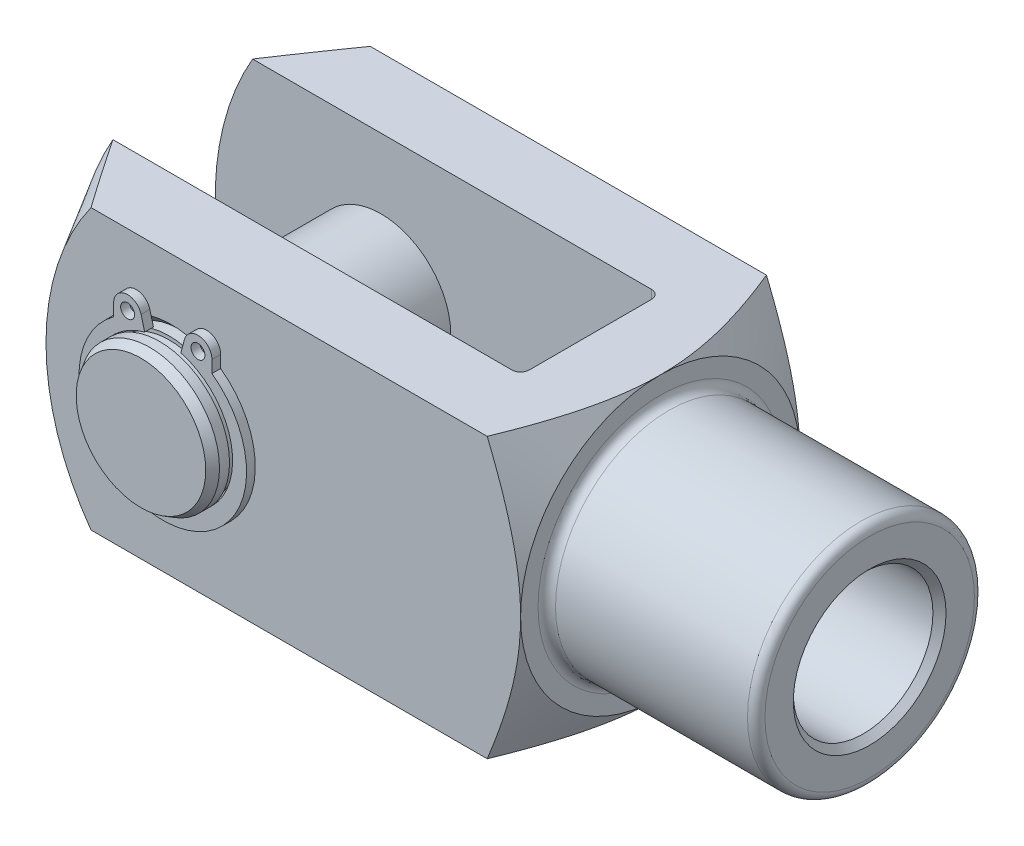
ISO-10303-21;
HEADER;
FILE_DESCRIPTION(('STEP AP214'),'2;1');
FILE_NAME('part.step','',(''),(''),'','','');
FILE_SCHEMA(('AUTOMOTIVE_DESIGN { 1 0 10303 214 1 1 1 1 }'));
ENDSEC;
DATA;
#1=APPLICATION_CONTEXT('core data for automotive mechanical design processes');
#2=APPLICATION_PROTOCOL_DEFINITION('international standard','automotive_design',2000,#1);
#3=PRODUCT_CONTEXT('',#1,'mechanical');
#4=PRODUCT('Part','Part','',(#3));
#5=PRODUCT_RELATED_PRODUCT_CATEGORY('part','',(#4));
#6=PRODUCT_DEFINITION_FORMATION('','',#4);
#7=PRODUCT_DEFINITION_CONTEXT('part definition',#1,'design');
#8=PRODUCT_DEFINITION('design','',#6,#7);
#9=PRODUCT_DEFINITION_SHAPE('','',#8);
#10=(LENGTH_UNIT() NAMED_UNIT(*) SI_UNIT(.MILLI.,.METRE.));
#11=(NAMED_UNIT(*) PLANE_ANGLE_UNIT() SI_UNIT($,.RADIAN.));
#12=(NAMED_UNIT(*) SI_UNIT($,.STERADIAN.) SOLID_ANGLE_UNIT());
#13=UNCERTAINTY_MEASURE_WITH_UNIT(LENGTH_MEASURE(1.E-05),#10,'distance_accuracy_value','');
#14=(GEOMETRIC_REPRESENTATION_CONTEXT(3) GLOBAL_UNCERTAINTY_ASSIGNED_CONTEXT((#13)) GLOBAL_UNIT_ASSIGNED_CONTEXT((#10,
#11,#12)) REPRESENTATION_CONTEXT('',''));
#15=CARTESIAN_POINT('',(0.,0.,0.));
#16=DIRECTION('',(0.,0.,1.));
#17=DIRECTION('',(1.,0.,0.));
#18=AXIS2_PLACEMENT_3D('',#15,#16,#17);
#19=CARTESIAN_POINT('',(-64.,0.,19.5));
#20=DIRECTION('',(0.,0.,-1.));
#21=DIRECTION('',(-1.,0.,0.));
#22=AXIS2_PLACEMENT_3D('',#19,#20,#21);
#23=CYLINDRICAL_SURFACE('',#22,8.);
#24=CARTESIAN_POINT('',(-64.,0.,16.25));
#25=DIRECTION('',(0.,0.,1.));
#26=DIRECTION('',(1.,0.,0.));
#27=AXIS2_PLACEMENT_3D('',#24,#25,#26);
#28=CIRCLE('',#27,8.);
#29=CARTESIAN_POINT('',(-56.,0.,16.25));
#30=VERTEX_POINT('',#29);
#31=EDGE_CURVE('P0_E55',#30,#30,#28,.T.);
#32=ORIENTED_EDGE('',*,*,#31,.F.);
#33=EDGE_LOOP('',(#32));
#34=FACE_BOUND('',#33,.T.);
#35=CARTESIAN_POINT('',(-64.,0.,-16.25));
#36=DIRECTION('',(0.,0.,1.));
#37=DIRECTION('',(1.,0.,0.));
#38=AXIS2_PLACEMENT_3D('',#35,#36,#37);
#39=CIRCLE('',#38,8.);
#40=CARTESIAN_POINT('',(-56.,0.,-16.25));
#41=VERTEX_POINT('',#40);
#42=EDGE_CURVE('P0_E40',#41,#41,#39,.T.);
#43=ORIENTED_EDGE('',*,*,#42,.T.);
#44=EDGE_LOOP('',(#43));
#45=FACE_BOUND('',#44,.T.);
#46=ADVANCED_FACE('P0_F14',(#34,#45),#23,.T.);
#47=CARTESIAN_POINT('',(-64.,0.,-17.35));
#48=DIRECTION('',(0.,0.,1.));
#49=DIRECTION('',(1.,0.,0.));
#50=AXIS2_PLACEMENT_3D('',#47,#48,#49);
#51=CIRCLE('',#50,8.);
#52=CARTESIAN_POINT('',(-56.,0.,-17.35));
#53=VERTEX_POINT('',#52);
#54=EDGE_CURVE('P0_E43',#53,#53,#51,.T.);
#55=ORIENTED_EDGE('',*,*,#54,.F.);
#56=EDGE_LOOP('',(#55));
#57=FACE_BOUND('',#56,.T.);
#58=CARTESIAN_POINT('',(-64.,0.,-18.5));
#59=DIRECTION('',(0.,0.,1.));
#60=DIRECTION('',(1.,0.,0.));
#61=AXIS2_PLACEMENT_3D('',#58,#59,#60);
#62=CIRCLE('',#61,8.);
#63=CARTESIAN_POINT('',(-56.,0.,-18.5));
#64=VERTEX_POINT('',#63);
#65=EDGE_CURVE('P0_E25',#64,#64,#62,.T.);
#66=ORIENTED_EDGE('',*,*,#65,.T.);
#67=EDGE_LOOP('',(#66));
#68=FACE_BOUND('',#67,.T.);
#69=ADVANCED_FACE('P0_F63',(#57,#68),#23,.T.);
#70=CARTESIAN_POINT('',(-64.,0.,-19.5));
#71=DIRECTION('',(0.,0.,1.));
#72=DIRECTION('',(1.,0.,0.));
#73=AXIS2_PLACEMENT_3D('',#70,#71,#72);
#74=PLANE('',#73);
#75=CARTESIAN_POINT('',(-64.,0.,-19.5));
#76=DIRECTION('',(0.,0.,1.));
#77=DIRECTION('',(1.,0.,0.));
#78=AXIS2_PLACEMENT_3D('',#75,#76,#77);
#79=CIRCLE('',#78,7.42264973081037);
#80=CARTESIAN_POINT('',(-56.5773502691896,0.,-19.5));
#81=VERTEX_POINT('',#80);
#82=EDGE_CURVE('P0_E21',#81,#81,#79,.F.);
#83=ORIENTED_EDGE('',*,*,#82,.T.);
#84=EDGE_LOOP('',(#83));
#85=FACE_BOUND('',#84,.T.);
#86=ADVANCED_FACE('P0_F89',(#85),#74,.F.);
#87=CARTESIAN_POINT('',(-64.,0.,-18.5));
#88=DIRECTION('',(0.,0.,1.));
#89=DIRECTION('',(1.,0.,0.));
#90=AXIS2_PLACEMENT_3D('',#87,#88,#89);
#91=CONICAL_SURFACE('',#90,8.,0.523598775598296);
#92=ORIENTED_EDGE('',*,*,#82,.F.);
#93=EDGE_LOOP('',(#92));
#94=FACE_BOUND('',#93,.T.);
#95=ORIENTED_EDGE('',*,*,#65,.F.);
#96=EDGE_LOOP('',(#95));
#97=FACE_BOUND('',#96,.T.);
#98=ADVANCED_FACE('P0_F83',(#94,#97),#91,.T.);
#99=CARTESIAN_POINT('',(-64.,8.,-17.35));
#100=DIRECTION('',(0.,0.,-1.));
#101=DIRECTION('',(-1.,0.,0.));
#102=AXIS2_PLACEMENT_3D('',#99,#100,#101);
#103=PLANE('',#102);
#104=CARTESIAN_POINT('',(-64.,0.,-17.35));
#105=DIRECTION('',(0.,0.,1.));
#106=DIRECTION('',(1.,0.,0.));
#107=AXIS2_PLACEMENT_3D('',#104,#105,#106);
#108=CIRCLE('',#107,7.6);
#109=CARTESIAN_POINT('',(-56.4,0.,-17.35));
#110=VERTEX_POINT('',#109);
#111=EDGE_CURVE('P0_E34',#110,#110,#108,.T.);
#112=ORIENTED_EDGE('',*,*,#111,.F.);
#113=EDGE_LOOP('',(#112));
#114=FACE_BOUND('',#113,.T.);
#115=ORIENTED_EDGE('',*,*,#54,.T.);
#116=EDGE_LOOP('',(#115));
#117=FACE_BOUND('',#116,.T.);
#118=ADVANCED_FACE('P0_F77',(#114,#117),#103,.F.);
#119=CARTESIAN_POINT('',(-64.,0.,18.5));
#120=DIRECTION('',(0.,0.,1.));
#121=DIRECTION('',(1.,0.,0.));
#122=AXIS2_PLACEMENT_3D('',#119,#120,#121);
#123=CYLINDRICAL_SURFACE('',#122,7.6);
#124=CARTESIAN_POINT('',(-64.,0.,-16.25));
#125=DIRECTION('',(0.,0.,1.));
#126=DIRECTION('',(1.,0.,0.));
#127=AXIS2_PLACEMENT_3D('',#124,#125,#126);
#128=CIRCLE('',#127,7.6);
#129=CARTESIAN_POINT('',(-56.4,0.,-16.25));
#130=VERTEX_POINT('',#129);
#131=EDGE_CURVE('P0_E37',#130,#130,#128,.T.);
#132=ORIENTED_EDGE('',*,*,#131,.F.);
#133=EDGE_LOOP('',(#132));
#134=FACE_BOUND('',#133,.T.);
#135=ORIENTED_EDGE('',*,*,#111,.T.);
#136=EDGE_LOOP('',(#135));
#137=FACE_BOUND('',#136,.T.);
#138=ADVANCED_FACE('P0_F71',(#134,#137),#123,.T.);
#139=CARTESIAN_POINT('',(-64.,8.,-16.25));
#140=DIRECTION('',(0.,0.,1.));
#141=DIRECTION('',(1.,0.,0.));
#142=AXIS2_PLACEMENT_3D('',#139,#140,#141);
#143=PLANE('',#142);
#144=ORIENTED_EDGE('',*,*,#42,.F.);
#145=EDGE_LOOP('',(#144));
#146=FACE_BOUND('',#145,.T.);
#147=ORIENTED_EDGE('',*,*,#131,.T.);
#148=EDGE_LOOP('',(#147));
#149=FACE_BOUND('',#148,.T.);
#150=ADVANCED_FACE('P0_F68',(#146,#149),#143,.F.);
#151=CARTESIAN_POINT('',(-64.,8.,16.25));
#152=DIRECTION('',(0.,0.,-1.));
#153=DIRECTION('',(-1.,0.,0.));
#154=AXIS2_PLACEMENT_3D('',#151,#152,#153);
#155=PLANE('',#154);
#156=CARTESIAN_POINT('',(-64.,0.,16.25));
#157=DIRECTION('',(0.,0.,1.));
#158=DIRECTION('',(1.,0.,0.));
#159=AXIS2_PLACEMENT_3D('',#156,#157,#158);
#160=CIRCLE('',#159,7.6);
#161=CARTESIAN_POINT('',(-56.4,0.,16.25));
#162=VERTEX_POINT('',#161);
#163=EDGE_CURVE('P0_E46',#162,#162,#160,.T.);
#164=ORIENTED_EDGE('',*,*,#163,.F.);
#165=EDGE_LOOP('',(#164));
#166=FACE_BOUND('',#165,.T.);
#167=ORIENTED_EDGE('',*,*,#31,.T.);
#168=EDGE_LOOP('',(#167));
#169=FACE_BOUND('',#168,.T.);
#170=ADVANCED_FACE('P0_F59',(#166,#169),#155,.F.);
#171=CARTESIAN_POINT('',(-64.,0.,18.5));
#172=DIRECTION('',(0.,0.,1.));
#173=DIRECTION('',(1.,0.,0.));
#174=AXIS2_PLACEMENT_3D('',#171,#172,#173);
#175=CYLINDRICAL_SURFACE('',#174,7.6);
#176=CARTESIAN_POINT('',(-64.,0.,17.35));
#177=DIRECTION('',(0.,0.,1.));
#178=DIRECTION('',(1.,0.,0.));
#179=AXIS2_PLACEMENT_3D('',#176,#177,#178);
#180=CIRCLE('',#179,7.6);
#181=CARTESIAN_POINT('',(-56.4,0.,17.35));
#182=VERTEX_POINT('',#181);
#183=EDGE_CURVE('P0_E49',#182,#182,#180,.T.);
#184=ORIENTED_EDGE('',*,*,#183,.F.);
#185=EDGE_LOOP('',(#184));
#186=FACE_BOUND('',#185,.T.);
#187=ORIENTED_EDGE('',*,*,#163,.T.);
#188=EDGE_LOOP('',(#187));
#189=FACE_BOUND('',#188,.T.);
#190=ADVANCED_FACE('P0_F108',(#186,#189),#175,.T.);
#191=CARTESIAN_POINT('',(-64.,8.,17.35));
#192=DIRECTION('',(0.,0.,1.));
#193=DIRECTION('',(1.,0.,0.));
#194=AXIS2_PLACEMENT_3D('',#191,#192,#193);
#195=PLANE('',#194);
#196=CARTESIAN_POINT('',(-64.,0.,17.35));
#197=DIRECTION('',(0.,0.,1.));
#198=DIRECTION('',(1.,0.,0.));
#199=AXIS2_PLACEMENT_3D('',#196,#197,#198);
#200=CIRCLE('',#199,8.);
#201=CARTESIAN_POINT('',(-56.,0.,17.35));
#202=VERTEX_POINT('',#201);
#203=EDGE_CURVE('P0_E52',#202,#202,#200,.T.);
#204=ORIENTED_EDGE('',*,*,#203,.F.);
#205=EDGE_LOOP('',(#204));
#206=FACE_BOUND('',#205,.T.);
#207=ORIENTED_EDGE('',*,*,#183,.T.);
#208=EDGE_LOOP('',(#207));
#209=FACE_BOUND('',#208,.T.);
#210=ADVANCED_FACE('P0_F104',(#206,#209),#195,.F.);
#211=CARTESIAN_POINT('',(-64.,0.,19.5));
#212=DIRECTION('',(0.,0.,1.));
#213=DIRECTION('',(1.,0.,0.));
#214=AXIS2_PLACEMENT_3D('',#211,#212,#213);
#215=PLANE('',#214);
#216=CARTESIAN_POINT('',(-64.,0.,19.5));
#217=DIRECTION('',(0.,0.,1.));
#218=DIRECTION('',(1.,0.,0.));
#219=AXIS2_PLACEMENT_3D('',#216,#217,#218);
#220=CIRCLE('',#219,7.42264973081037);
#221=CARTESIAN_POINT('',(-56.5773502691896,0.,19.5));
#222=VERTEX_POINT('',#221);
#223=EDGE_CURVE('P0_E10',#222,#222,#220,.T.);
#224=ORIENTED_EDGE('',*,*,#223,.T.);
#225=EDGE_LOOP('',(#224));
#226=FACE_BOUND('',#225,.T.);
#227=ADVANCED_FACE('P0_F102',(#226),#215,.T.);
#228=CARTESIAN_POINT('',(-64.,0.,19.5));
#229=DIRECTION('',(0.,0.,-1.));
#230=DIRECTION('',(-1.,0.,0.));
#231=AXIS2_PLACEMENT_3D('',#228,#229,#230);
#232=CONICAL_SURFACE('',#231,7.42264973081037,0.523598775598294);
#233=CARTESIAN_POINT('',(-64.,0.,18.5));
#234=DIRECTION('',(0.,0.,1.));
#235=DIRECTION('',(1.,0.,0.));
#236=AXIS2_PLACEMENT_3D('',#233,#234,#235);
#237=CIRCLE('',#236,8.);
#238=CARTESIAN_POINT('',(-56.,0.,18.5));
#239=VERTEX_POINT('',#238);
#240=EDGE_CURVE('P0_E29',#239,#239,#237,.F.);
#241=ORIENTED_EDGE('',*,*,#240,.F.);
#242=EDGE_LOOP('',(#241));
#243=FACE_BOUND('',#242,.T.);
#244=ORIENTED_EDGE('',*,*,#223,.F.);
#245=EDGE_LOOP('',(#244));
#246=FACE_BOUND('',#245,.T.);
#247=ADVANCED_FACE('P0_F16',(#243,#246),#232,.T.);
#248=ORIENTED_EDGE('',*,*,#203,.T.);
#249=EDGE_LOOP('',(#248));
#250=FACE_BOUND('',#249,.T.);
#251=ORIENTED_EDGE('',*,*,#240,.T.);
#252=EDGE_LOOP('',(#251));
#253=FACE_BOUND('',#252,.T.);
#254=ADVANCED_FACE('P0_F65',(#250,#253),#23,.T.);
#255=CLOSED_SHELL('',(#46,#69,#86,#98,#118,#138,#150,#170,#190,#210,#227,#247,#254));
#256=MANIFOLD_SOLID_BREP('P0_B1',#255);
#257=CARTESIAN_POINT('',(-64.0000000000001,0.,16.9999999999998));
#258=DIRECTION('',(0.,0.,1.));
#259=DIRECTION('',(1.,0.,0.));
#260=AXIS2_PLACEMENT_3D('',#257,#258,#259);
#261=PLANE('',#260);
#262=CARTESIAN_POINT('',(-68.0301441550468,8.85877746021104,16.9999999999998));
#263=DIRECTION('',(0.,0.,1.));
#264=DIRECTION('',(1.,0.,0.));
#265=AXIS2_PLACEMENT_3D('',#262,#263,#264);
#266=CIRCLE('',#265,0.8);
#267=CARTESIAN_POINT('',(-67.2301441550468,8.85877746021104,16.9999999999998));
#268=VERTEX_POINT('',#267);
#269=EDGE_CURVE('P1_E117',#268,#268,#266,.T.);
#270=ORIENTED_EDGE('',*,*,#269,.F.);
#271=EDGE_LOOP('',(#270));
#272=FACE_BOUND('',#271,.T.);
#273=CARTESIAN_POINT('',(-64.0000000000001,0.,16.9999999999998));
#274=DIRECTION('',(0.,0.,-1.));
#275=DIRECTION('',(1.,0.,0.));
#276=AXIS2_PLACEMENT_3D('',#273,#274,#275);
#277=CIRCLE('',#276,8.);
#278=CARTESIAN_POINT('',(-61.9294476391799,7.72740661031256,16.9999999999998));
#279=VERTEX_POINT('',#278);
#280=CARTESIAN_POINT('',(-66.0705523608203,7.72740661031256,16.9999999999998));
#281=VERTEX_POINT('',#280);
#282=EDGE_CURVE('P1_E128',#279,#281,#277,.T.);
#283=ORIENTED_EDGE('',*,*,#282,.T.);
#284=DIRECTION('',(-0.258819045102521,0.965925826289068,0.));
#285=VECTOR('',#284,1.);
#286=CARTESIAN_POINT('',(-66.0705523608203,7.72740661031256,16.9999999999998));
#287=LINE('',#286,#285);
#288=CARTESIAN_POINT('',(-66.4846628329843,9.27288793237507,16.9999999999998));
#289=VERTEX_POINT('',#288);
#290=EDGE_CURVE('P1_E76',#281,#289,#287,.T.);
#291=ORIENTED_EDGE('',*,*,#290,.T.);
#292=CARTESIAN_POINT('',(-68.0301441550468,8.85877746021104,16.9999999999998));
#293=DIRECTION('',(0.,0.,1.));
#294=DIRECTION('',(1.,0.,0.));
#295=AXIS2_PLACEMENT_3D('',#292,#293,#294);
#296=CIRCLE('',#295,1.6);
#297=CARTESIAN_POINT('',(-69.6301441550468,8.85877746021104,16.9999999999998));
#298=VERTEX_POINT('',#297);
#299=EDGE_CURVE('P1_E143',#289,#298,#296,.T.);
#300=ORIENTED_EDGE('',*,*,#299,.T.);
#301=DIRECTION('',(0.,-1.,0.));
#302=VECTOR('',#301,1.);
#303=CARTESIAN_POINT('',(-69.6301441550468,8.85877746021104,16.9999999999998));
#304=LINE('',#303,#302);
#305=CARTESIAN_POINT('',(-69.6301441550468,7.45569783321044,16.9999999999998));
#306=VERTEX_POINT('',#305);
#307=EDGE_CURVE('P1_E156',#298,#306,#304,.T.);
#308=ORIENTED_EDGE('',*,*,#307,.T.);
#309=CARTESIAN_POINT('',(-64.0000000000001,-0.319999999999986,16.9999999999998));
#310=DIRECTION('',(0.,0.,1.));
#311=DIRECTION('',(1.,0.,0.));
#312=AXIS2_PLACEMENT_3D('',#309,#310,#311);
#313=CIRCLE('',#312,9.6);
#314=CARTESIAN_POINT('',(-58.3698558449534,7.45569783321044,16.9999999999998));
#315=VERTEX_POINT('',#314);
#316=EDGE_CURVE('P1_E95',#306,#315,#313,.T.);
#317=ORIENTED_EDGE('',*,*,#316,.T.);
#318=DIRECTION('',(0.,1.,0.));
#319=VECTOR('',#318,1.);
#320=CARTESIAN_POINT('',(-58.3698558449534,8.85877746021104,16.9999999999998));
#321=LINE('',#320,#319);
#322=CARTESIAN_POINT('',(-58.3698558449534,8.85877746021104,16.9999999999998));
#323=VERTEX_POINT('',#322);
#324=EDGE_CURVE('P1_E89',#315,#323,#321,.T.);
#325=ORIENTED_EDGE('',*,*,#324,.T.);
#326=CARTESIAN_POINT('',(-59.9698558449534,8.85877746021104,16.9999999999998));
#327=DIRECTION('',(0.,0.,1.));
#328=DIRECTION('',(-1.,0.,0.));
#329=AXIS2_PLACEMENT_3D('',#326,#327,#328);
#330=CIRCLE('',#329,1.6);
#331=CARTESIAN_POINT('',(-61.5153371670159,9.27288793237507,16.9999999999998));
#332=VERTEX_POINT('',#331);
#333=EDGE_CURVE('P1_E93',#323,#332,#330,.T.);
#334=ORIENTED_EDGE('',*,*,#333,.T.);
#335=DIRECTION('',(-0.258819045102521,-0.965925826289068,0.));
#336=VECTOR('',#335,1.);
#337=CARTESIAN_POINT('',(-61.9294476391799,7.72740661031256,16.9999999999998));
#338=LINE('',#337,#336);
#339=EDGE_CURVE('P1_E33',#332,#279,#338,.T.);
#340=ORIENTED_EDGE('',*,*,#339,.T.);
#341=EDGE_LOOP('',(#283,#291,#300,#308,#317,#325,#334,#340));
#342=FACE_BOUND('',#341,.T.);
#343=CARTESIAN_POINT('',(-59.9698558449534,8.85877746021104,16.9999999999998));
#344=DIRECTION('',(0.,0.,1.));
#345=DIRECTION('',(-1.,0.,0.));
#346=AXIS2_PLACEMENT_3D('',#343,#344,#345);
#347=CIRCLE('',#346,0.8);
#348=CARTESIAN_POINT('',(-60.7698558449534,8.85877746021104,16.9999999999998));
#349=VERTEX_POINT('',#348);
#350=EDGE_CURVE('P1_E165',#349,#349,#347,.T.);
#351=ORIENTED_EDGE('',*,*,#350,.F.);
#352=EDGE_LOOP('',(#351));
#353=FACE_BOUND('',#352,.T.);
#354=ADVANCED_FACE('P1_F16',(#272,#342,#353),#261,.T.);
#355=CARTESIAN_POINT('',(-64.0000000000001,0.,15.9999999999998));
#356=DIRECTION('',(0.,0.,1.));
#357=DIRECTION('',(1.,0.,0.));
#358=AXIS2_PLACEMENT_3D('',#355,#356,#357);
#359=PLANE('',#358);
#360=CARTESIAN_POINT('',(-68.0301441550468,8.85877746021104,15.9999999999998));
#361=DIRECTION('',(0.,0.,1.));
#362=DIRECTION('',(1.,0.,0.));
#363=AXIS2_PLACEMENT_3D('',#360,#361,#362);
#364=CIRCLE('',#363,0.8);
#365=CARTESIAN_POINT('',(-67.2301441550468,8.85877746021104,15.9999999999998));
#366=VERTEX_POINT('',#365);
#367=EDGE_CURVE('P1_E162',#366,#366,#364,.T.);
#368=ORIENTED_EDGE('',*,*,#367,.T.);
#369=EDGE_LOOP('',(#368));
#370=FACE_BOUND('',#369,.T.);
#371=CARTESIAN_POINT('',(-64.0000000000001,0.,15.9999999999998));
#372=DIRECTION('',(0.,0.,-1.));
#373=DIRECTION('',(1.,0.,0.));
#374=AXIS2_PLACEMENT_3D('',#371,#372,#373);
#375=CIRCLE('',#374,8.);
#376=CARTESIAN_POINT('',(-61.9294476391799,7.72740661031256,15.9999999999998));
#377=VERTEX_POINT('',#376);
#378=CARTESIAN_POINT('',(-66.0705523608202,7.72740661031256,15.9999999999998));
#379=VERTEX_POINT('',#378);
#380=EDGE_CURVE('P1_E113',#377,#379,#375,.T.);
#381=ORIENTED_EDGE('',*,*,#380,.F.);
#382=DIRECTION('',(-0.258819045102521,-0.965925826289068,0.));
#383=VECTOR('',#382,1.);
#384=CARTESIAN_POINT('',(-61.9294476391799,7.72740661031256,15.9999999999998));
#385=LINE('',#384,#383);
#386=CARTESIAN_POINT('',(-61.5153371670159,9.27288793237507,15.9999999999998));
#387=VERTEX_POINT('',#386);
#388=EDGE_CURVE('P1_E68',#387,#377,#385,.T.);
#389=ORIENTED_EDGE('',*,*,#388,.F.);
#390=CARTESIAN_POINT('',(-59.9698558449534,8.85877746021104,15.9999999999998));
#391=DIRECTION('',(0.,0.,1.));
#392=DIRECTION('',(-1.,0.,0.));
#393=AXIS2_PLACEMENT_3D('',#390,#391,#392);
#394=CIRCLE('',#393,1.6);
#395=CARTESIAN_POINT('',(-58.3698558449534,8.85877746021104,15.9999999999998));
#396=VERTEX_POINT('',#395);
#397=EDGE_CURVE('P1_E62',#396,#387,#394,.T.);
#398=ORIENTED_EDGE('',*,*,#397,.F.);
#399=DIRECTION('',(0.,1.,0.));
#400=VECTOR('',#399,1.);
#401=CARTESIAN_POINT('',(-58.3698558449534,8.85877746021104,15.9999999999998));
#402=LINE('',#401,#400);
#403=CARTESIAN_POINT('',(-58.3698558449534,7.45569783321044,15.9999999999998));
#404=VERTEX_POINT('',#403);
#405=EDGE_CURVE('P1_E103',#404,#396,#402,.T.);
#406=ORIENTED_EDGE('',*,*,#405,.F.);
#407=CARTESIAN_POINT('',(-64.0000000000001,-0.319999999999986,15.9999999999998));
#408=DIRECTION('',(0.,0.,1.));
#409=DIRECTION('',(1.,0.,0.));
#410=AXIS2_PLACEMENT_3D('',#407,#408,#409);
#411=CIRCLE('',#410,9.6);
#412=CARTESIAN_POINT('',(-69.6301441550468,7.45569783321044,15.9999999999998));
#413=VERTEX_POINT('',#412);
#414=EDGE_CURVE('P1_E123',#413,#404,#411,.T.);
#415=ORIENTED_EDGE('',*,*,#414,.F.);
#416=DIRECTION('',(0.,-1.,0.));
#417=VECTOR('',#416,1.);
#418=CARTESIAN_POINT('',(-69.6301441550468,8.85877746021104,15.9999999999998));
#419=LINE('',#418,#417);
#420=CARTESIAN_POINT('',(-69.6301441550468,8.85877746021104,15.9999999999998));
#421=VERTEX_POINT('',#420);
#422=EDGE_CURVE('P1_E121',#421,#413,#419,.T.);
#423=ORIENTED_EDGE('',*,*,#422,.F.);
#424=CARTESIAN_POINT('',(-68.0301441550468,8.85877746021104,15.9999999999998));
#425=DIRECTION('',(0.,0.,1.));
#426=DIRECTION('',(1.,0.,0.));
#427=AXIS2_PLACEMENT_3D('',#424,#425,#426);
#428=CIRCLE('',#427,1.6);
#429=CARTESIAN_POINT('',(-66.4846628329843,9.27288793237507,15.9999999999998));
#430=VERTEX_POINT('',#429);
#431=EDGE_CURVE('P1_E119',#430,#421,#428,.T.);
#432=ORIENTED_EDGE('',*,*,#431,.F.);
#433=DIRECTION('',(-0.258819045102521,0.965925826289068,0.));
#434=VECTOR('',#433,1.);
#435=CARTESIAN_POINT('',(-66.0705523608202,7.72740661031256,15.9999999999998));
#436=LINE('',#435,#434);
#437=EDGE_CURVE('P1_E116',#379,#430,#436,.T.);
#438=ORIENTED_EDGE('',*,*,#437,.F.);
#439=EDGE_LOOP('',(#381,#389,#398,#406,#415,#423,#432,#438));
#440=FACE_BOUND('',#439,.T.);
#441=CARTESIAN_POINT('',(-59.9698558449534,8.85877746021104,15.9999999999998));
#442=DIRECTION('',(0.,0.,1.));
#443=DIRECTION('',(-1.,0.,0.));
#444=AXIS2_PLACEMENT_3D('',#441,#442,#443);
#445=CIRCLE('',#444,0.8);
#446=CARTESIAN_POINT('',(-60.7698558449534,8.85877746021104,15.9999999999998));
#447=VERTEX_POINT('',#446);
#448=EDGE_CURVE('P1_E168',#447,#447,#445,.T.);
#449=ORIENTED_EDGE('',*,*,#448,.T.);
#450=EDGE_LOOP('',(#449));
#451=FACE_BOUND('',#450,.T.);
#452=ADVANCED_FACE('P1_F147',(#370,#440,#451),#359,.F.);
#453=CARTESIAN_POINT('',(-64.0000000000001,0.,16.9999999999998));
#454=DIRECTION('',(0.,0.,-1.));
#455=DIRECTION('',(-1.,0.,0.));
#456=AXIS2_PLACEMENT_3D('',#453,#454,#455);
#457=CYLINDRICAL_SURFACE('',#456,8.);
#458=ORIENTED_EDGE('',*,*,#380,.T.);
#459=DIRECTION('',(0.,0.,-1.));
#460=VECTOR('',#459,1.);
#461=CARTESIAN_POINT('',(-66.0705523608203,7.72740661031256,16.9999999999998));
#462=LINE('',#461,#460);
#463=EDGE_CURVE('P1_E11',#281,#379,#462,.T.);
#464=ORIENTED_EDGE('',*,*,#463,.F.);
#465=ORIENTED_EDGE('',*,*,#282,.F.);
#466=DIRECTION('',(0.,0.,-1.));
#467=VECTOR('',#466,1.);
#468=CARTESIAN_POINT('',(-61.9294476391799,7.72740661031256,16.9999999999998));
#469=LINE('',#468,#467);
#470=EDGE_CURVE('P1_E109',#279,#377,#469,.T.);
#471=ORIENTED_EDGE('',*,*,#470,.T.);
#472=EDGE_LOOP('',(#458,#464,#465,#471));
#473=FACE_BOUND('',#472,.T.);
#474=ADVANCED_FACE('P1_F18',(#473),#457,.F.);
#475=CARTESIAN_POINT('',(-66.0705523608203,7.72740661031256,16.9999999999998));
#476=DIRECTION('',(-0.965925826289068,-0.258819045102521,0.));
#477=DIRECTION('',(0.258819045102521,-0.965925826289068,0.));
#478=AXIS2_PLACEMENT_3D('',#475,#476,#477);
#479=PLANE('',#478);
#480=ORIENTED_EDGE('',*,*,#437,.T.);
#481=DIRECTION('',(0.,0.,-1.));
#482=VECTOR('',#481,1.);
#483=CARTESIAN_POINT('',(-66.4846628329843,9.27288793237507,16.9999999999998));
#484=LINE('',#483,#482);
#485=EDGE_CURVE('P1_E25',#289,#430,#484,.T.);
#486=ORIENTED_EDGE('',*,*,#485,.F.);
#487=ORIENTED_EDGE('',*,*,#290,.F.);
#488=ORIENTED_EDGE('',*,*,#463,.T.);
#489=EDGE_LOOP('',(#480,#486,#487,#488));
#490=FACE_BOUND('',#489,.T.);
#491=ADVANCED_FACE('P1_F202',(#490),#479,.F.);
#492=CARTESIAN_POINT('',(-68.0301441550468,8.85877746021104,16.9999999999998));
#493=DIRECTION('',(0.,0.,-1.));
#494=DIRECTION('',(-1.,0.,0.));
#495=AXIS2_PLACEMENT_3D('',#492,#493,#494);
#496=CYLINDRICAL_SURFACE('',#495,1.6);
#497=ORIENTED_EDGE('',*,*,#431,.T.);
#498=DIRECTION('',(0.,0.,-1.));
#499=VECTOR('',#498,1.);
#500=CARTESIAN_POINT('',(-69.6301441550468,8.85877746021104,16.9999999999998));
#501=LINE('',#500,#499);
#502=EDGE_CURVE('P1_E135',#298,#421,#501,.T.);
#503=ORIENTED_EDGE('',*,*,#502,.F.);
#504=ORIENTED_EDGE('',*,*,#299,.F.);
#505=ORIENTED_EDGE('',*,*,#485,.T.);
#506=EDGE_LOOP('',(#497,#503,#504,#505));
#507=FACE_BOUND('',#506,.T.);
#508=ADVANCED_FACE('P1_F141',(#507),#496,.T.);
#509=CARTESIAN_POINT('',(-69.6301441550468,8.85877746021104,16.9999999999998));
#510=DIRECTION('',(1.,0.,0.));
#511=DIRECTION('',(0.,1.,0.));
#512=AXIS2_PLACEMENT_3D('',#509,#510,#511);
#513=PLANE('',#512);
#514=ORIENTED_EDGE('',*,*,#422,.T.);
#515=DIRECTION('',(0.,0.,-1.));
#516=VECTOR('',#515,1.);
#517=CARTESIAN_POINT('',(-69.6301441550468,7.45569783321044,16.9999999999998));
#518=LINE('',#517,#516);
#519=EDGE_CURVE('P1_E132',#306,#413,#518,.T.);
#520=ORIENTED_EDGE('',*,*,#519,.F.);
#521=ORIENTED_EDGE('',*,*,#307,.F.);
#522=ORIENTED_EDGE('',*,*,#502,.T.);
#523=EDGE_LOOP('',(#514,#520,#521,#522));
#524=FACE_BOUND('',#523,.T.);
#525=ADVANCED_FACE('P1_F152',(#524),#513,.F.);
#526=CARTESIAN_POINT('',(-64.0000000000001,-0.319999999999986,16.9999999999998));
#527=DIRECTION('',(0.,0.,-1.));
#528=DIRECTION('',(-1.,0.,0.));
#529=AXIS2_PLACEMENT_3D('',#526,#527,#528);
#530=CYLINDRICAL_SURFACE('',#529,9.6);
#531=ORIENTED_EDGE('',*,*,#414,.T.);
#532=DIRECTION('',(0.,0.,-1.));
#533=VECTOR('',#532,1.);
#534=CARTESIAN_POINT('',(-58.3698558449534,7.45569783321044,16.9999999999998));
#535=LINE('',#534,#533);
#536=EDGE_CURVE('P1_E104',#315,#404,#535,.T.);
#537=ORIENTED_EDGE('',*,*,#536,.F.);
#538=ORIENTED_EDGE('',*,*,#316,.F.);
#539=ORIENTED_EDGE('',*,*,#519,.T.);
#540=EDGE_LOOP('',(#531,#537,#538,#539));
#541=FACE_BOUND('',#540,.T.);
#542=ADVANCED_FACE('P1_F155',(#541),#530,.T.);
#543=CARTESIAN_POINT('',(-58.3698558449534,8.85877746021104,16.9999999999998));
#544=DIRECTION('',(-1.,0.,0.));
#545=DIRECTION('',(0.,-1.,0.));
#546=AXIS2_PLACEMENT_3D('',#543,#544,#545);
#547=PLANE('',#546);
#548=ORIENTED_EDGE('',*,*,#405,.T.);
#549=DIRECTION('',(0.,0.,-1.));
#550=VECTOR('',#549,1.);
#551=CARTESIAN_POINT('',(-58.3698558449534,8.85877746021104,16.9999999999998));
#552=LINE('',#551,#550);
#553=EDGE_CURVE('P1_E100',#323,#396,#552,.T.);
#554=ORIENTED_EDGE('',*,*,#553,.F.);
#555=ORIENTED_EDGE('',*,*,#324,.F.);
#556=ORIENTED_EDGE('',*,*,#536,.T.);
#557=EDGE_LOOP('',(#548,#554,#555,#556));
#558=FACE_BOUND('',#557,.T.);
#559=ADVANCED_FACE('P1_F101',(#558),#547,.F.);
#560=CARTESIAN_POINT('',(-59.9698558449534,8.85877746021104,16.9999999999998));
#561=DIRECTION('',(0.,0.,-1.));
#562=DIRECTION('',(-1.,0.,0.));
#563=AXIS2_PLACEMENT_3D('',#560,#561,#562);
#564=CYLINDRICAL_SURFACE('',#563,1.6);
#565=ORIENTED_EDGE('',*,*,#397,.T.);
#566=DIRECTION('',(0.,0.,-1.));
#567=VECTOR('',#566,1.);
#568=CARTESIAN_POINT('',(-61.5153371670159,9.27288793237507,16.9999999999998));
#569=LINE('',#568,#567);
#570=EDGE_CURVE('P1_E105',#332,#387,#569,.T.);
#571=ORIENTED_EDGE('',*,*,#570,.F.);
#572=ORIENTED_EDGE('',*,*,#333,.F.);
#573=ORIENTED_EDGE('',*,*,#553,.T.);
#574=EDGE_LOOP('',(#565,#571,#572,#573));
#575=FACE_BOUND('',#574,.T.);
#576=ADVANCED_FACE('P1_F107',(#575),#564,.T.);
#577=CARTESIAN_POINT('',(-61.9294476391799,7.72740661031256,16.9999999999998));
#578=DIRECTION('',(0.965925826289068,-0.258819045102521,0.));
#579=DIRECTION('',(0.258819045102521,0.965925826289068,0.));
#580=AXIS2_PLACEMENT_3D('',#577,#578,#579);
#581=PLANE('',#580);
#582=ORIENTED_EDGE('',*,*,#388,.T.);
#583=ORIENTED_EDGE('',*,*,#470,.F.);
#584=ORIENTED_EDGE('',*,*,#339,.F.);
#585=ORIENTED_EDGE('',*,*,#570,.T.);
#586=EDGE_LOOP('',(#582,#583,#584,#585));
#587=FACE_BOUND('',#586,.T.);
#588=ADVANCED_FACE('P1_F190',(#587),#581,.F.);
#589=CARTESIAN_POINT('',(-68.0301441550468,8.85877746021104,16.9999999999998));
#590=DIRECTION('',(0.,0.,-1.));
#591=DIRECTION('',(-1.,0.,0.));
#592=AXIS2_PLACEMENT_3D('',#589,#590,#591);
#593=CYLINDRICAL_SURFACE('',#592,0.8);
#594=ORIENTED_EDGE('',*,*,#269,.T.);
#595=EDGE_LOOP('',(#594));
#596=FACE_BOUND('',#595,.T.);
#597=ORIENTED_EDGE('',*,*,#367,.F.);
#598=EDGE_LOOP('',(#597));
#599=FACE_BOUND('',#598,.T.);
#600=ADVANCED_FACE('P1_F187',(#596,#599),#593,.F.);
#601=CARTESIAN_POINT('',(-59.9698558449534,8.85877746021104,16.9999999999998));
#602=DIRECTION('',(0.,0.,-1.));
#603=DIRECTION('',(-1.,0.,0.));
#604=AXIS2_PLACEMENT_3D('',#601,#602,#603);
#605=CYLINDRICAL_SURFACE('',#604,0.8);
#606=ORIENTED_EDGE('',*,*,#350,.T.);
#607=EDGE_LOOP('',(#606));
#608=FACE_BOUND('',#607,.T.);
#609=ORIENTED_EDGE('',*,*,#448,.F.);
#610=EDGE_LOOP('',(#609));
#611=FACE_BOUND('',#610,.T.);
#612=ADVANCED_FACE('P1_F174',(#608,#611),#605,.F.);
#613=CLOSED_SHELL('',(#354,#452,#474,#491,#508,#525,#542,#559,#576,#588,#600,#612));
#614=MANIFOLD_SOLID_BREP('P1_B1',#613);
#615=CARTESIAN_POINT('',(-64.0000000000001,0.,-16.9999999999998));
#616=DIRECTION('',(0.,0.,-1.));
#617=DIRECTION('',(-1.,0.,0.));
#618=AXIS2_PLACEMENT_3D('',#615,#616,#617);
#619=PLANE('',#618);
#620=CARTESIAN_POINT('',(-59.9698558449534,8.85877746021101,-16.9999999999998));
#621=DIRECTION('',(0.,0.,-1.));
#622=DIRECTION('',(-1.,0.,0.));
#623=AXIS2_PLACEMENT_3D('',#620,#621,#622);
#624=CIRCLE('',#623,0.8);
#625=CARTESIAN_POINT('',(-60.7698558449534,8.85877746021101,-16.9999999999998));
#626=VERTEX_POINT('',#625);
#627=EDGE_CURVE('P2_E117',#626,#626,#624,.T.);
#628=ORIENTED_EDGE('',*,*,#627,.F.);
#629=EDGE_LOOP('',(#628));
#630=FACE_BOUND('',#629,.T.);
#631=CARTESIAN_POINT('',(-64.0000000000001,0.,-16.9999999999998));
#632=DIRECTION('',(0.,0.,1.));
#633=DIRECTION('',(-1.,0.,0.));
#634=AXIS2_PLACEMENT_3D('',#631,#632,#633);
#635=CIRCLE('',#634,8.);
#636=CARTESIAN_POINT('',(-66.0705523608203,7.72740661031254,-16.9999999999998));
#637=VERTEX_POINT('',#636);
#638=CARTESIAN_POINT('',(-61.9294476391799,7.72740661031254,-16.9999999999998));
#639=VERTEX_POINT('',#638);
#640=EDGE_CURVE('P2_E128',#637,#639,#635,.T.);
#641=ORIENTED_EDGE('',*,*,#640,.T.);
#642=DIRECTION('',(0.258819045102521,0.965925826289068,0.));
#643=VECTOR('',#642,1.);
#644=CARTESIAN_POINT('',(-61.9294476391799,7.72740661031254,-16.9999999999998));
#645=LINE('',#644,#643);
#646=CARTESIAN_POINT('',(-61.5153371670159,9.27288793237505,-16.9999999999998));
#647=VERTEX_POINT('',#646);
#648=EDGE_CURVE('P2_E76',#639,#647,#645,.T.);
#649=ORIENTED_EDGE('',*,*,#648,.T.);
#650=CARTESIAN_POINT('',(-59.9698558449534,8.85877746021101,-16.9999999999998));
#651=DIRECTION('',(0.,0.,-1.));
#652=DIRECTION('',(-1.,0.,0.));
#653=AXIS2_PLACEMENT_3D('',#650,#651,#652);
#654=CIRCLE('',#653,1.6);
#655=CARTESIAN_POINT('',(-58.3698558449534,8.85877746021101,-16.9999999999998));
#656=VERTEX_POINT('',#655);
#657=EDGE_CURVE('P2_E143',#647,#656,#654,.T.);
#658=ORIENTED_EDGE('',*,*,#657,.T.);
#659=DIRECTION('',(0.,-1.,0.));
#660=VECTOR('',#659,1.);
#661=CARTESIAN_POINT('',(-58.3698558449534,8.85877746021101,-16.9999999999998));
#662=LINE('',#661,#660);
#663=CARTESIAN_POINT('',(-58.3698558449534,7.45569783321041,-16.9999999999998));
#664=VERTEX_POINT('',#663);
#665=EDGE_CURVE('P2_E156',#656,#664,#662,.T.);
#666=ORIENTED_EDGE('',*,*,#665,.T.);
#667=CARTESIAN_POINT('',(-64.0000000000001,-0.320000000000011,-16.9999999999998));
#668=DIRECTION('',(0.,0.,-1.));
#669=DIRECTION('',(-1.,0.,0.));
#670=AXIS2_PLACEMENT_3D('',#667,#668,#669);
#671=CIRCLE('',#670,9.6);
#672=CARTESIAN_POINT('',(-69.6301441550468,7.45569783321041,-16.9999999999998));
#673=VERTEX_POINT('',#672);
#674=EDGE_CURVE('P2_E95',#664,#673,#671,.T.);
#675=ORIENTED_EDGE('',*,*,#674,.T.);
#676=DIRECTION('',(0.,1.,0.));
#677=VECTOR('',#676,1.);
#678=CARTESIAN_POINT('',(-69.6301441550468,8.85877746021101,-16.9999999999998));
#679=LINE('',#678,#677);
#680=CARTESIAN_POINT('',(-69.6301441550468,8.85877746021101,-16.9999999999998));
#681=VERTEX_POINT('',#680);
#682=EDGE_CURVE('P2_E89',#673,#681,#679,.T.);
#683=ORIENTED_EDGE('',*,*,#682,.T.);
#684=CARTESIAN_POINT('',(-68.0301441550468,8.85877746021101,-16.9999999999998));
#685=DIRECTION('',(0.,0.,-1.));
#686=DIRECTION('',(1.,0.,0.));
#687=AXIS2_PLACEMENT_3D('',#684,#685,#686);
#688=CIRCLE('',#687,1.6);
#689=CARTESIAN_POINT('',(-66.4846628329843,9.27288793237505,-16.9999999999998));
#690=VERTEX_POINT('',#689);
#691=EDGE_CURVE('P2_E93',#681,#690,#688,.T.);
#692=ORIENTED_EDGE('',*,*,#691,.T.);
#693=DIRECTION('',(0.258819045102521,-0.965925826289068,0.));
#694=VECTOR('',#693,1.);
#695=CARTESIAN_POINT('',(-66.0705523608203,7.72740661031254,-16.9999999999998));
#696=LINE('',#695,#694);
#697=EDGE_CURVE('P2_E33',#690,#637,#696,.T.);
#698=ORIENTED_EDGE('',*,*,#697,.T.);
#699=EDGE_LOOP('',(#641,#649,#658,#666,#675,#683,#692,#698));
#700=FACE_BOUND('',#699,.T.);
#701=CARTESIAN_POINT('',(-68.0301441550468,8.85877746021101,-16.9999999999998));
#702=DIRECTION('',(0.,0.,-1.));
#703=DIRECTION('',(1.,0.,0.));
#704=AXIS2_PLACEMENT_3D('',#701,#702,#703);
#705=CIRCLE('',#704,0.8);
#706=CARTESIAN_POINT('',(-67.2301441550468,8.85877746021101,-16.9999999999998));
#707=VERTEX_POINT('',#706);
#708=EDGE_CURVE('P2_E165',#707,#707,#705,.T.);
#709=ORIENTED_EDGE('',*,*,#708,.F.);
#710=EDGE_LOOP('',(#709));
#711=FACE_BOUND('',#710,.T.);
#712=ADVANCED_FACE('P2_F16',(#630,#700,#711),#619,.T.);
#713=CARTESIAN_POINT('',(-64.0000000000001,0.,-15.9999999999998));
#714=DIRECTION('',(0.,0.,-1.));
#715=DIRECTION('',(-1.,0.,0.));
#716=AXIS2_PLACEMENT_3D('',#713,#714,#715);
#717=PLANE('',#716);
#718=CARTESIAN_POINT('',(-59.9698558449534,8.85877746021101,-15.9999999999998));
#719=DIRECTION('',(0.,0.,-1.));
#720=DIRECTION('',(-1.,0.,0.));
#721=AXIS2_PLACEMENT_3D('',#718,#719,#720);
#722=CIRCLE('',#721,0.8);
#723=CARTESIAN_POINT('',(-60.7698558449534,8.85877746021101,-15.9999999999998));
#724=VERTEX_POINT('',#723);
#725=EDGE_CURVE('P2_E162',#724,#724,#722,.T.);
#726=ORIENTED_EDGE('',*,*,#725,.T.);
#727=EDGE_LOOP('',(#726));
#728=FACE_BOUND('',#727,.T.);
#729=CARTESIAN_POINT('',(-64.0000000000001,0.,-15.9999999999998));
#730=DIRECTION('',(0.,0.,1.));
#731=DIRECTION('',(-1.,0.,0.));
#732=AXIS2_PLACEMENT_3D('',#729,#730,#731);
#733=CIRCLE('',#732,8.);
#734=CARTESIAN_POINT('',(-66.0705523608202,7.72740661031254,-15.9999999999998));
#735=VERTEX_POINT('',#734);
#736=CARTESIAN_POINT('',(-61.9294476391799,7.72740661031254,-15.9999999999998));
#737=VERTEX_POINT('',#736);
#738=EDGE_CURVE('P2_E113',#735,#737,#733,.T.);
#739=ORIENTED_EDGE('',*,*,#738,.F.);
#740=DIRECTION('',(0.258819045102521,-0.965925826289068,0.));
#741=VECTOR('',#740,1.);
#742=CARTESIAN_POINT('',(-66.0705523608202,7.72740661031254,-15.9999999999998));
#743=LINE('',#742,#741);
#744=CARTESIAN_POINT('',(-66.4846628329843,9.27288793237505,-15.9999999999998));
#745=VERTEX_POINT('',#744);
#746=EDGE_CURVE('P2_E68',#745,#735,#743,.T.);
#747=ORIENTED_EDGE('',*,*,#746,.F.);
#748=CARTESIAN_POINT('',(-68.0301441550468,8.85877746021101,-15.9999999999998));
#749=DIRECTION('',(0.,0.,-1.));
#750=DIRECTION('',(1.,0.,0.));
#751=AXIS2_PLACEMENT_3D('',#748,#749,#750);
#752=CIRCLE('',#751,1.6);
#753=CARTESIAN_POINT('',(-69.6301441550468,8.85877746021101,-15.9999999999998));
#754=VERTEX_POINT('',#753);
#755=EDGE_CURVE('P2_E62',#754,#745,#752,.T.);
#756=ORIENTED_EDGE('',*,*,#755,.F.);
#757=DIRECTION('',(0.,1.,0.));
#758=VECTOR('',#757,1.);
#759=CARTESIAN_POINT('',(-69.6301441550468,8.85877746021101,-15.9999999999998));
#760=LINE('',#759,#758);
#761=CARTESIAN_POINT('',(-69.6301441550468,7.45569783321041,-15.9999999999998));
#762=VERTEX_POINT('',#761);
#763=EDGE_CURVE('P2_E103',#762,#754,#760,.T.);
#764=ORIENTED_EDGE('',*,*,#763,.F.);
#765=CARTESIAN_POINT('',(-64.0000000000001,-0.320000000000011,-15.9999999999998));
#766=DIRECTION('',(0.,0.,-1.));
#767=DIRECTION('',(-1.,0.,0.));
#768=AXIS2_PLACEMENT_3D('',#765,#766,#767);
#769=CIRCLE('',#768,9.6);
#770=CARTESIAN_POINT('',(-58.3698558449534,7.45569783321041,-15.9999999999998));
#771=VERTEX_POINT('',#770);
#772=EDGE_CURVE('P2_E123',#771,#762,#769,.T.);
#773=ORIENTED_EDGE('',*,*,#772,.F.);
#774=DIRECTION('',(0.,-1.,0.));
#775=VECTOR('',#774,1.);
#776=CARTESIAN_POINT('',(-58.3698558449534,8.85877746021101,-15.9999999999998));
#777=LINE('',#776,#775);
#778=CARTESIAN_POINT('',(-58.3698558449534,8.85877746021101,-15.9999999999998));
#779=VERTEX_POINT('',#778);
#780=EDGE_CURVE('P2_E121',#779,#771,#777,.T.);
#781=ORIENTED_EDGE('',*,*,#780,.F.);
#782=CARTESIAN_POINT('',(-59.9698558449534,8.85877746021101,-15.9999999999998));
#783=DIRECTION('',(0.,0.,-1.));
#784=DIRECTION('',(-1.,0.,0.));
#785=AXIS2_PLACEMENT_3D('',#782,#783,#784);
#786=CIRCLE('',#785,1.6);
#787=CARTESIAN_POINT('',(-61.5153371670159,9.27288793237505,-15.9999999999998));
#788=VERTEX_POINT('',#787);
#789=EDGE_CURVE('P2_E119',#788,#779,#786,.T.);
#790=ORIENTED_EDGE('',*,*,#789,.F.);
#791=DIRECTION('',(0.258819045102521,0.965925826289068,0.));
#792=VECTOR('',#791,1.);
#793=CARTESIAN_POINT('',(-61.9294476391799,7.72740661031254,-15.9999999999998));
#794=LINE('',#793,#792);
#795=EDGE_CURVE('P2_E116',#737,#788,#794,.T.);
#796=ORIENTED_EDGE('',*,*,#795,.F.);
#797=EDGE_LOOP('',(#739,#747,#756,#764,#773,#781,#790,#796));
#798=FACE_BOUND('',#797,.T.);
#799=CARTESIAN_POINT('',(-68.0301441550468,8.85877746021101,-15.9999999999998));
#800=DIRECTION('',(0.,0.,-1.));
#801=DIRECTION('',(1.,0.,0.));
#802=AXIS2_PLACEMENT_3D('',#799,#800,#801);
#803=CIRCLE('',#802,0.8);
#804=CARTESIAN_POINT('',(-67.2301441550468,8.85877746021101,-15.9999999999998));
#805=VERTEX_POINT('',#804);
#806=EDGE_CURVE('P2_E168',#805,#805,#803,.T.);
#807=ORIENTED_EDGE('',*,*,#806,.T.);
#808=EDGE_LOOP('',(#807));
#809=FACE_BOUND('',#808,.T.);
#810=ADVANCED_FACE('P2_F147',(#728,#798,#809),#717,.F.);
#811=CARTESIAN_POINT('',(-64.0000000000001,0.,-16.9999999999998));
#812=DIRECTION('',(0.,0.,1.));
#813=DIRECTION('',(1.,0.,0.));
#814=AXIS2_PLACEMENT_3D('',#811,#812,#813);
#815=CYLINDRICAL_SURFACE('',#814,8.);
#816=ORIENTED_EDGE('',*,*,#738,.T.);
#817=DIRECTION('',(0.,0.,1.));
#818=VECTOR('',#817,1.);
#819=CARTESIAN_POINT('',(-61.9294476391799,7.72740661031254,-16.9999999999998));
#820=LINE('',#819,#818);
#821=EDGE_CURVE('P2_E11',#639,#737,#820,.T.);
#822=ORIENTED_EDGE('',*,*,#821,.F.);
#823=ORIENTED_EDGE('',*,*,#640,.F.);
#824=DIRECTION('',(0.,0.,1.));
#825=VECTOR('',#824,1.);
#826=CARTESIAN_POINT('',(-66.0705523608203,7.72740661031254,-16.9999999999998));
#827=LINE('',#826,#825);
#828=EDGE_CURVE('P2_E109',#637,#735,#827,.T.);
#829=ORIENTED_EDGE('',*,*,#828,.T.);
#830=EDGE_LOOP('',(#816,#822,#823,#829));
#831=FACE_BOUND('',#830,.T.);
#832=ADVANCED_FACE('P2_F18',(#831),#815,.F.);
#833=CARTESIAN_POINT('',(-61.9294476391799,7.72740661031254,-16.9999999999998));
#834=DIRECTION('',(0.965925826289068,-0.258819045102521,0.));
#835=DIRECTION('',(-0.258819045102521,-0.965925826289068,0.));
#836=AXIS2_PLACEMENT_3D('',#833,#834,#835);
#837=PLANE('',#836);
#838=ORIENTED_EDGE('',*,*,#795,.T.);
#839=DIRECTION('',(0.,0.,1.));
#840=VECTOR('',#839,1.);
#841=CARTESIAN_POINT('',(-61.5153371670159,9.27288793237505,-16.9999999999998));
#842=LINE('',#841,#840);
#843=EDGE_CURVE('P2_E25',#647,#788,#842,.T.);
#844=ORIENTED_EDGE('',*,*,#843,.F.);
#845=ORIENTED_EDGE('',*,*,#648,.F.);
#846=ORIENTED_EDGE('',*,*,#821,.T.);
#847=EDGE_LOOP('',(#838,#844,#845,#846));
#848=FACE_BOUND('',#847,.T.);
#849=ADVANCED_FACE('P2_F202',(#848),#837,.F.);
#850=CARTESIAN_POINT('',(-59.9698558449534,8.85877746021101,-16.9999999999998));
#851=DIRECTION('',(0.,0.,1.));
#852=DIRECTION('',(1.,0.,0.));
#853=AXIS2_PLACEMENT_3D('',#850,#851,#852);
#854=CYLINDRICAL_SURFACE('',#853,1.6);
#855=ORIENTED_EDGE('',*,*,#789,.T.);
#856=DIRECTION('',(0.,0.,1.));
#857=VECTOR('',#856,1.);
#858=CARTESIAN_POINT('',(-58.3698558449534,8.85877746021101,-16.9999999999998));
#859=LINE('',#858,#857);
#860=EDGE_CURVE('P2_E135',#656,#779,#859,.T.);
#861=ORIENTED_EDGE('',*,*,#860,.F.);
#862=ORIENTED_EDGE('',*,*,#657,.F.);
#863=ORIENTED_EDGE('',*,*,#843,.T.);
#864=EDGE_LOOP('',(#855,#861,#862,#863));
#865=FACE_BOUND('',#864,.T.);
#866=ADVANCED_FACE('P2_F141',(#865),#854,.T.);
#867=CARTESIAN_POINT('',(-58.3698558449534,8.85877746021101,-16.9999999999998));
#868=DIRECTION('',(-1.,0.,0.));
#869=DIRECTION('',(0.,1.,0.));
#870=AXIS2_PLACEMENT_3D('',#867,#868,#869);
#871=PLANE('',#870);
#872=ORIENTED_EDGE('',*,*,#780,.T.);
#873=DIRECTION('',(0.,0.,1.));
#874=VECTOR('',#873,1.);
#875=CARTESIAN_POINT('',(-58.3698558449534,7.45569783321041,-16.9999999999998));
#876=LINE('',#875,#874);
#877=EDGE_CURVE('P2_E132',#664,#771,#876,.T.);
#878=ORIENTED_EDGE('',*,*,#877,.F.);
#879=ORIENTED_EDGE('',*,*,#665,.F.);
#880=ORIENTED_EDGE('',*,*,#860,.T.);
#881=EDGE_LOOP('',(#872,#878,#879,#880));
#882=FACE_BOUND('',#881,.T.);
#883=ADVANCED_FACE('P2_F152',(#882),#871,.F.);
#884=CARTESIAN_POINT('',(-64.0000000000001,-0.320000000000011,-16.9999999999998));
#885=DIRECTION('',(0.,0.,1.));
#886=DIRECTION('',(1.,0.,0.));
#887=AXIS2_PLACEMENT_3D('',#884,#885,#886);
#888=CYLINDRICAL_SURFACE('',#887,9.6);
#889=ORIENTED_EDGE('',*,*,#772,.T.);
#890=DIRECTION('',(0.,0.,1.));
#891=VECTOR('',#890,1.);
#892=CARTESIAN_POINT('',(-69.6301441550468,7.45569783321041,-16.9999999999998));
#893=LINE('',#892,#891);
#894=EDGE_CURVE('P2_E104',#673,#762,#893,.T.);
#895=ORIENTED_EDGE('',*,*,#894,.F.);
#896=ORIENTED_EDGE('',*,*,#674,.F.);
#897=ORIENTED_EDGE('',*,*,#877,.T.);
#898=EDGE_LOOP('',(#889,#895,#896,#897));
#899=FACE_BOUND('',#898,.T.);
#900=ADVANCED_FACE('P2_F155',(#899),#888,.T.);
#901=CARTESIAN_POINT('',(-69.6301441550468,8.85877746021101,-16.9999999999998));
#902=DIRECTION('',(1.,0.,0.));
#903=DIRECTION('',(0.,-1.,0.));
#904=AXIS2_PLACEMENT_3D('',#901,#902,#903);
#905=PLANE('',#904);
#906=ORIENTED_EDGE('',*,*,#763,.T.);
#907=DIRECTION('',(0.,0.,1.));
#908=VECTOR('',#907,1.);
#909=CARTESIAN_POINT('',(-69.6301441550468,8.85877746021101,-16.9999999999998));
#910=LINE('',#909,#908);
#911=EDGE_CURVE('P2_E100',#681,#754,#910,.T.);
#912=ORIENTED_EDGE('',*,*,#911,.F.);
#913=ORIENTED_EDGE('',*,*,#682,.F.);
#914=ORIENTED_EDGE('',*,*,#894,.T.);
#915=EDGE_LOOP('',(#906,#912,#913,#914));
#916=FACE_BOUND('',#915,.T.);
#917=ADVANCED_FACE('P2_F101',(#916),#905,.F.);
#918=CARTESIAN_POINT('',(-68.0301441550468,8.85877746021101,-16.9999999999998));
#919=DIRECTION('',(0.,0.,1.));
#920=DIRECTION('',(1.,0.,0.));
#921=AXIS2_PLACEMENT_3D('',#918,#919,#920);
#922=CYLINDRICAL_SURFACE('',#921,1.6);
#923=ORIENTED_EDGE('',*,*,#755,.T.);
#924=DIRECTION('',(0.,0.,1.));
#925=VECTOR('',#924,1.);
#926=CARTESIAN_POINT('',(-66.4846628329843,9.27288793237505,-16.9999999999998));
#927=LINE('',#926,#925);
#928=EDGE_CURVE('P2_E105',#690,#745,#927,.T.);
#929=ORIENTED_EDGE('',*,*,#928,.F.);
#930=ORIENTED_EDGE('',*,*,#691,.F.);
#931=ORIENTED_EDGE('',*,*,#911,.T.);
#932=EDGE_LOOP('',(#923,#929,#930,#931));
#933=FACE_BOUND('',#932,.T.);
#934=ADVANCED_FACE('P2_F107',(#933),#922,.T.);
#935=CARTESIAN_POINT('',(-66.0705523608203,7.72740661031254,-16.9999999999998));
#936=DIRECTION('',(-0.965925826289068,-0.258819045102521,0.));
#937=DIRECTION('',(-0.258819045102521,0.965925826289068,0.));
#938=AXIS2_PLACEMENT_3D('',#935,#936,#937);
#939=PLANE('',#938);
#940=ORIENTED_EDGE('',*,*,#746,.T.);
#941=ORIENTED_EDGE('',*,*,#828,.F.);
#942=ORIENTED_EDGE('',*,*,#697,.F.);
#943=ORIENTED_EDGE('',*,*,#928,.T.);
#944=EDGE_LOOP('',(#940,#941,#942,#943));
#945=FACE_BOUND('',#944,.T.);
#946=ADVANCED_FACE('P2_F190',(#945),#939,.F.);
#947=CARTESIAN_POINT('',(-59.9698558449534,8.85877746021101,-16.9999999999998));
#948=DIRECTION('',(0.,0.,1.));
#949=DIRECTION('',(1.,0.,0.));
#950=AXIS2_PLACEMENT_3D('',#947,#948,#949);
#951=CYLINDRICAL_SURFACE('',#950,0.8);
#952=ORIENTED_EDGE('',*,*,#627,.T.);
#953=EDGE_LOOP('',(#952));
#954=FACE_BOUND('',#953,.T.);
#955=ORIENTED_EDGE('',*,*,#725,.F.);
#956=EDGE_LOOP('',(#955));
#957=FACE_BOUND('',#956,.T.);
#958=ADVANCED_FACE('P2_F187',(#954,#957),#951,.F.);
#959=CARTESIAN_POINT('',(-68.0301441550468,8.85877746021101,-16.9999999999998));
#960=DIRECTION('',(0.,0.,1.));
#961=DIRECTION('',(1.,0.,0.));
#962=AXIS2_PLACEMENT_3D('',#959,#960,#961);
#963=CYLINDRICAL_SURFACE('',#962,0.8);
#964=ORIENTED_EDGE('',*,*,#708,.T.);
#965=EDGE_LOOP('',(#964));
#966=FACE_BOUND('',#965,.T.);
#967=ORIENTED_EDGE('',*,*,#806,.F.);
#968=EDGE_LOOP('',(#967));
#969=FACE_BOUND('',#968,.T.);
#970=ADVANCED_FACE('P2_F174',(#966,#969),#963,.F.);
#971=CLOSED_SHELL('',(#712,#810,#832,#849,#866,#883,#900,#917,#934,#946,#958,#970));
#972=MANIFOLD_SOLID_BREP('P2_B1',#971);
#973=CARTESIAN_POINT('',(-33.,-16.,-6.99999999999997));
#974=DIRECTION('',(0.,-1.,0.));
#975=DIRECTION('',(0.,0.,-1.));
#976=AXIS2_PLACEMENT_3D('',#973,#974,#975);
#977=CYLINDRICAL_SURFACE('',#976,1.);
#978=DIRECTION('',(0.,1.,0.));
#979=VECTOR('',#978,1.);
#980=CARTESIAN_POINT('',(-32.,-16.,-6.99999999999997));
#981=LINE('',#980,#979);
#982=CARTESIAN_POINT('',(-32.,-3.87298334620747,-6.99999999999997));
#983=VERTEX_POINT('',#982);
#984=CARTESIAN_POINT('',(-32.,-16.,-6.99999999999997));
#985=VERTEX_POINT('',#984);
#986=EDGE_CURVE('P3_E304',#983,#985,#981,.F.);
#987=ORIENTED_EDGE('',*,*,#986,.F.);
#988=CARTESIAN_POINT('',(-32.,-3.87298334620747,-6.99999999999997));
#989=CARTESIAN_POINT('',(-32.0000090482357,-3.81506111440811,-7.03204875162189));
#990=CARTESIAN_POINT('',(-32.0015394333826,-3.75675902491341,-7.06336585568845));
#991=CARTESIAN_POINT('',(-32.00730166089,-3.63952511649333,-7.12448038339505));
#992=CARTESIAN_POINT('',(-32.0115323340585,-3.58059358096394,-7.15427845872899));
#993=CARTESIAN_POINT('',(-32.0277410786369,-3.40324230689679,-7.24121872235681));
#994=CARTESIAN_POINT('',(-32.0432390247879,-3.28400247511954,-7.29605254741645));
#995=CARTESIAN_POINT('',(-32.081478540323,-3.04456972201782,-7.39915667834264));
#996=CARTESIAN_POINT('',(-32.1041870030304,-2.92438355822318,-7.44745557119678));
#997=CARTESIAN_POINT('',(-32.1553570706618,-2.68282861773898,-7.53784294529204));
#998=CARTESIAN_POINT('',(-32.1838229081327,-2.56145903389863,-7.57992681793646));
#999=CARTESIAN_POINT('',(-32.2648278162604,-2.24038507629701,-7.68273685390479));
#1000=CARTESIAN_POINT('',(-32.3211617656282,-2.03996193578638,-7.73829278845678));
#1001=CARTESIAN_POINT('',(-32.441850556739,-1.63779800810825,-7.83328651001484));
#1002=CARTESIAN_POINT('',(-32.5062087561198,-1.43605670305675,-7.87271752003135));
#1003=CARTESIAN_POINT('',(-32.7067987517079,-0.829293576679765,-7.96742194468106));
#1004=CARTESIAN_POINT('',(-32.8505643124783,-0.422667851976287,-7.99912712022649));
#1005=CARTESIAN_POINT('',(-32.9960248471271,-0.0112434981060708,-7.99999406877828));
#1006=CARTESIAN_POINT('',(-32.9980124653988,-0.00562166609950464,-7.99999999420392));
#1007=CARTESIAN_POINT('',(-33.,0.,-7.99999999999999));
#1008=B_SPLINE_CURVE_WITH_KNOTS('',3,(#988,#989,#990,#991,#992,#993,#994,#995,#996,#997,#998,
#999,#1000,#1001,#1002,#1003,#1004,#1005,#1006,#1007),.UNSPECIFIED.,.F.,.F.,(4,2,2,2,2,2,2,2,2,
4),(0.,0.198535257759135,0.396984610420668,0.792983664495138,1.18719018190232,1.58168756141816,
2.22713013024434,2.87284368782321,4.16406208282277,4.18195063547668),.UNSPECIFIED.);
#1009=CARTESIAN_POINT('',(-33.,0.,-7.99999999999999));
#1010=VERTEX_POINT('',#1009);
#1011=EDGE_CURVE('P3_E327',#983,#1010,#1008,.T.);
#1012=ORIENTED_EDGE('',*,*,#1011,.T.);
#1013=DIRECTION('',(0.,1.,0.));
#1014=VECTOR('',#1013,1.);
#1015=CARTESIAN_POINT('',(-33.,16.,-7.99999999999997));
#1016=LINE('',#1015,#1014);
#1017=CARTESIAN_POINT('',(-33.,-16.,-7.99999999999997));
#1018=VERTEX_POINT('',#1017);
#1019=EDGE_CURVE('P3_E153',#1018,#1010,#1016,.T.);
#1020=ORIENTED_EDGE('',*,*,#1019,.F.);
#1021=CARTESIAN_POINT('',(-33.,-16.,-6.99999999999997));
#1022=DIRECTION('',(0.,-1.,0.));
#1023=DIRECTION('',(0.,0.,-1.));
#1024=AXIS2_PLACEMENT_3D('',#1021,#1022,#1023);
#1025=CIRCLE('',#1024,1.);
#1026=EDGE_CURVE('P3_E164',#985,#1018,#1025,.F.);
#1027=ORIENTED_EDGE('',*,*,#1026,.F.);
#1028=EDGE_LOOP('',(#987,#1012,#1020,#1027));
#1029=FACE_BOUND('',#1028,.T.);
#1030=ADVANCED_FACE('P3_F15',(#1029),#977,.F.);
#1031=CARTESIAN_POINT('',(-32.,-16.,-7.99999999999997));
#1032=DIRECTION('',(1.,0.,0.));
#1033=DIRECTION('',(0.,0.,-1.));
#1034=AXIS2_PLACEMENT_3D('',#1031,#1032,#1033);
#1035=PLANE('',#1034);
#1036=CARTESIAN_POINT('',(-32.,16.,-6.99999999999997));
#1037=VERTEX_POINT('',#1036);
#1038=CARTESIAN_POINT('',(-32.,3.87298334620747,-6.99999999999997));
#1039=VERTEX_POINT('',#1038);
#1040=EDGE_CURVE('P3_E315',#1037,#1039,#981,.F.);
#1041=ORIENTED_EDGE('',*,*,#1040,.T.);
#1042=CARTESIAN_POINT('',(-32.,0.,0.));
#1043=DIRECTION('',(1.,0.,0.));
#1044=DIRECTION('',(0.,0.,-1.));
#1045=AXIS2_PLACEMENT_3D('',#1042,#1043,#1044);
#1046=CIRCLE('',#1045,8.);
#1047=CARTESIAN_POINT('',(-32.,3.87298334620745,6.99999999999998));
#1048=VERTEX_POINT('',#1047);
#1049=EDGE_CURVE('P3_E380',#1039,#1048,#1046,.T.);
#1050=ORIENTED_EDGE('',*,*,#1049,.T.);
#1051=DIRECTION('',(0.,1.,0.));
#1052=VECTOR('',#1051,1.);
#1053=CARTESIAN_POINT('',(-32.,16.,6.99999999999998));
#1054=LINE('',#1053,#1052);
#1055=CARTESIAN_POINT('',(-32.,16.,6.99999999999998));
#1056=VERTEX_POINT('',#1055);
#1057=EDGE_CURVE('P3_E136',#1048,#1056,#1054,.T.);
#1058=ORIENTED_EDGE('',*,*,#1057,.T.);
#1059=DIRECTION('',(0.,0.,-1.));
#1060=VECTOR('',#1059,1.);
#1061=CARTESIAN_POINT('',(-32.,16.,-7.99999999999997));
#1062=LINE('',#1061,#1060);
#1063=EDGE_CURVE('P3_E290',#1056,#1037,#1062,.T.);
#1064=ORIENTED_EDGE('',*,*,#1063,.T.);
#1065=EDGE_LOOP('',(#1041,#1050,#1058,#1064));
#1066=FACE_BOUND('',#1065,.T.);
#1067=ADVANCED_FACE('P3_F375',(#1066),#1035,.F.);
#1068=CARTESIAN_POINT('',(-33.,-16.,6.99999999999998));
#1069=DIRECTION('',(0.,-1.,0.));
#1070=DIRECTION('',(0.,0.,-1.));
#1071=AXIS2_PLACEMENT_3D('',#1068,#1069,#1070);
#1072=CYLINDRICAL_SURFACE('',#1071,1.);
#1073=ORIENTED_EDGE('',*,*,#1057,.F.);
#1074=CARTESIAN_POINT('',(-32.,3.87298334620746,6.99999999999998));
#1075=CARTESIAN_POINT('',(-32.0000090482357,3.81506111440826,7.0320487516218));
#1076=CARTESIAN_POINT('',(-32.0015394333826,3.75675902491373,7.06336585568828));
#1077=CARTESIAN_POINT('',(-32.00730166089,3.63952511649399,7.12448038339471));
#1078=CARTESIAN_POINT('',(-32.0115323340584,3.58059358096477,7.15427845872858));
#1079=CARTESIAN_POINT('',(-32.0277410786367,3.40324230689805,7.24121872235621));
#1080=CARTESIAN_POINT('',(-32.0432390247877,3.28400247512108,7.29605254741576));
#1081=CARTESIAN_POINT('',(-32.0814785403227,3.0445697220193,7.39915667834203));
#1082=CARTESIAN_POINT('',(-32.1041870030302,2.92438355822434,7.44745557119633));
#1083=CARTESIAN_POINT('',(-32.1553570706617,2.68282861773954,7.53784294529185));
#1084=CARTESIAN_POINT('',(-32.1838229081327,2.56145903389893,7.57992681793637));
#1085=CARTESIAN_POINT('',(-32.2648278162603,2.24038507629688,7.68273685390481));
#1086=CARTESIAN_POINT('',(-32.3211617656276,2.03996193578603,7.73829278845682));
#1087=CARTESIAN_POINT('',(-32.4418505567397,1.63779800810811,7.83328651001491));
#1088=CARTESIAN_POINT('',(-32.5062087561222,1.43605670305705,7.87271752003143));
#1089=CARTESIAN_POINT('',(-32.7067987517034,0.829293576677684,7.96742194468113));
#1090=CARTESIAN_POINT('',(-32.8505643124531,0.422667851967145,7.99912712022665));
#1091=CARTESIAN_POINT('',(-32.9960248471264,0.0112434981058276,7.99999406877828));
#1092=CARTESIAN_POINT('',(-32.9980124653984,0.00562166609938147,7.99999999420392));
#1093=CARTESIAN_POINT('',(-33.,0.,7.99999999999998));
#1094=B_SPLINE_CURVE_WITH_KNOTS('',3,(#1074,#1075,#1076,#1077,#1078,#1079,#1080,#1081,#1082,
#1083,#1084,#1085,#1086,#1087,#1088,#1089,#1090,#1091,#1092,#1093),.UNSPECIFIED.,.F.,.F.,(4,2,2,
2,2,2,2,2,2,4),(0.,0.198535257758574,0.396984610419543,0.792983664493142,1.18719018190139,
1.58168756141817,2.22713013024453,2.87284368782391,4.16406208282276,4.18195063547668),.UNSPECIFIED.);
#1095=CARTESIAN_POINT('',(-33.,0.,7.99999999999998));
#1096=VERTEX_POINT('',#1095);
#1097=EDGE_CURVE('P3_E122',#1048,#1096,#1094,.T.);
#1098=ORIENTED_EDGE('',*,*,#1097,.T.);
#1099=DIRECTION('',(0.,1.,0.));
#1100=VECTOR('',#1099,1.);
#1101=CARTESIAN_POINT('',(-33.,-16.,7.99999999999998));
#1102=LINE('',#1101,#1100);
#1103=CARTESIAN_POINT('',(-33.,16.,7.99999999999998));
#1104=VERTEX_POINT('',#1103);
#1105=EDGE_CURVE('P3_E135',#1104,#1096,#1102,.F.);
#1106=ORIENTED_EDGE('',*,*,#1105,.F.);
#1107=CARTESIAN_POINT('',(-33.,16.,6.99999999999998));
#1108=DIRECTION('',(0.,1.,0.));
#1109=DIRECTION('',(0.,0.,1.));
#1110=AXIS2_PLACEMENT_3D('',#1107,#1108,#1109);
#1111=CIRCLE('',#1110,1.);
#1112=EDGE_CURVE('P3_E159',#1056,#1104,#1111,.F.);
#1113=ORIENTED_EDGE('',*,*,#1112,.F.);
#1114=EDGE_LOOP('',(#1073,#1098,#1106,#1113));
#1115=FACE_BOUND('',#1114,.T.);
#1116=ADVANCED_FACE('P3_F132',(#1115),#1072,.F.);
#1117=CARTESIAN_POINT('',(-83.,-16.,-7.99999999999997));
#1118=DIRECTION('',(0.,0.,-1.));
#1119=DIRECTION('',(-1.,0.,0.));
#1120=AXIS2_PLACEMENT_3D('',#1117,#1118,#1119);
#1121=PLANE('',#1120);
#1122=CARTESIAN_POINT('',(-64.,0.,-7.99999999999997));
#1123=DIRECTION('',(0.,0.,-1.));
#1124=DIRECTION('',(-1.,0.,0.));
#1125=AXIS2_PLACEMENT_3D('',#1122,#1123,#1124);
#1126=CIRCLE('',#1125,8.);
#1127=CARTESIAN_POINT('',(-72.,0.,-7.99999999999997));
#1128=VERTEX_POINT('',#1127);
#1129=EDGE_CURVE('P3_E311',#1128,#1128,#1126,.F.);
#1130=ORIENTED_EDGE('',*,*,#1129,.F.);
#1131=EDGE_LOOP('',(#1130));
#1132=FACE_BOUND('',#1131,.T.);
#1133=CARTESIAN_POINT('',(-51.,0.,-7.99999999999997));
#1134=DIRECTION('',(0.,0.,1.));
#1135=DIRECTION('',(1.,0.,0.));
#1136=AXIS2_PLACEMENT_3D('',#1133,#1134,#1135);
#1137=CIRCLE('',#1136,32.);
#1138=CARTESIAN_POINT('',(-78.712812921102,16.,-7.99999999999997));
#1139=VERTEX_POINT('',#1138);
#1140=CARTESIAN_POINT('',(-78.712812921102,-16.,-7.99999999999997));
#1141=VERTEX_POINT('',#1140);
#1142=EDGE_CURVE('P3_E231',#1139,#1141,#1137,.T.);
#1143=ORIENTED_EDGE('',*,*,#1142,.T.);
#1144=DIRECTION('',(-1.,0.,0.));
#1145=VECTOR('',#1144,1.);
#1146=CARTESIAN_POINT('',(-83.,-16.,-7.99999999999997));
#1147=LINE('',#1146,#1145);
#1148=EDGE_CURVE('P3_E286',#1018,#1141,#1147,.T.);
#1149=ORIENTED_EDGE('',*,*,#1148,.F.);
#1150=ORIENTED_EDGE('',*,*,#1019,.T.);
#1151=CARTESIAN_POINT('',(-33.,16.,-7.99999999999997));
#1152=VERTEX_POINT('',#1151);
#1153=EDGE_CURVE('P3_E152',#1010,#1152,#1016,.T.);
#1154=ORIENTED_EDGE('',*,*,#1153,.T.);
#1155=DIRECTION('',(-1.,0.,0.));
#1156=VECTOR('',#1155,1.);
#1157=CARTESIAN_POINT('',(-83.,16.,-7.99999999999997));
#1158=LINE('',#1157,#1156);
#1159=EDGE_CURVE('P3_E296',#1152,#1139,#1158,.T.);
#1160=ORIENTED_EDGE('',*,*,#1159,.T.);
#1161=EDGE_LOOP('',(#1143,#1149,#1150,#1154,#1160));
#1162=FACE_BOUND('',#1161,.T.);
#1163=ADVANCED_FACE('P3_F330',(#1132,#1162),#1121,.F.);
#1164=CARTESIAN_POINT('',(-83.,-16.,7.99999999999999));
#1165=DIRECTION('',(0.,0.,1.));
#1166=DIRECTION('',(1.,0.,0.));
#1167=AXIS2_PLACEMENT_3D('',#1164,#1165,#1166);
#1168=PLANE('',#1167);
#1169=CARTESIAN_POINT('',(-64.,0.,7.99999999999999));
#1170=DIRECTION('',(0.,0.,1.));
#1171=DIRECTION('',(1.,0.,0.));
#1172=AXIS2_PLACEMENT_3D('',#1169,#1170,#1171);
#1173=CIRCLE('',#1172,8.);
#1174=CARTESIAN_POINT('',(-56.,0.,7.99999999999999));
#1175=VERTEX_POINT('',#1174);
#1176=EDGE_CURVE('P3_E295',#1175,#1175,#1173,.F.);
#1177=ORIENTED_EDGE('',*,*,#1176,.F.);
#1178=EDGE_LOOP('',(#1177));
#1179=FACE_BOUND('',#1178,.T.);
#1180=DIRECTION('',(1.,0.,0.));
#1181=VECTOR('',#1180,1.);
#1182=CARTESIAN_POINT('',(-83.,-16.,7.99999999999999));
#1183=LINE('',#1182,#1181);
#1184=CARTESIAN_POINT('',(-78.712812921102,-16.,7.99999999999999));
#1185=VERTEX_POINT('',#1184);
#1186=CARTESIAN_POINT('',(-33.,-16.,7.99999999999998));
#1187=VERTEX_POINT('',#1186);
#1188=EDGE_CURVE('P3_E289',#1185,#1187,#1183,.T.);
#1189=ORIENTED_EDGE('',*,*,#1188,.F.);
#1190=CARTESIAN_POINT('',(-51.,0.,7.99999999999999));
#1191=DIRECTION('',(0.,0.,1.));
#1192=DIRECTION('',(1.,0.,0.));
#1193=AXIS2_PLACEMENT_3D('',#1190,#1191,#1192);
#1194=CIRCLE('',#1193,32.);
#1195=CARTESIAN_POINT('',(-78.712812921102,16.,7.99999999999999));
#1196=VERTEX_POINT('',#1195);
#1197=EDGE_CURVE('P3_E370',#1196,#1185,#1194,.T.);
#1198=ORIENTED_EDGE('',*,*,#1197,.F.);
#1199=DIRECTION('',(1.,0.,0.));
#1200=VECTOR('',#1199,1.);
#1201=CARTESIAN_POINT('',(-83.,16.,7.99999999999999));
#1202=LINE('',#1201,#1200);
#1203=EDGE_CURVE('P3_E150',#1196,#1104,#1202,.T.);
#1204=ORIENTED_EDGE('',*,*,#1203,.T.);
#1205=ORIENTED_EDGE('',*,*,#1105,.T.);
#1206=EDGE_CURVE('P3_E139',#1096,#1187,#1102,.F.);
#1207=ORIENTED_EDGE('',*,*,#1206,.T.);
#1208=EDGE_LOOP('',(#1189,#1198,#1204,#1205,#1207));
#1209=FACE_BOUND('',#1208,.T.);
#1210=ADVANCED_FACE('P3_F147',(#1179,#1209),#1168,.F.);
#1211=CARTESIAN_POINT('',(-83.,-16.,16.));
#1212=DIRECTION('',(0.,0.,1.));
#1213=DIRECTION('',(1.,0.,0.));
#1214=AXIS2_PLACEMENT_3D('',#1211,#1212,#1213);
#1215=PLANE('',#1214);
#1216=CARTESIAN_POINT('',(-64.,0.,16.));
#1217=DIRECTION('',(0.,0.,1.));
#1218=DIRECTION('',(1.,0.,0.));
#1219=AXIS2_PLACEMENT_3D('',#1216,#1217,#1218);
#1220=CIRCLE('',#1219,8.99999999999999);
#1221=CARTESIAN_POINT('',(-55.,0.,16.));
#1222=VERTEX_POINT('',#1221);
#1223=EDGE_CURVE('P3_E187',#1222,#1222,#1220,.F.);
#1224=ORIENTED_EDGE('',*,*,#1223,.T.);
#1225=EDGE_LOOP('',(#1224));
#1226=FACE_BOUND('',#1225,.T.);
#1227=DIRECTION('',(1.,0.,0.));
#1228=VECTOR('',#1227,1.);
#1229=CARTESIAN_POINT('',(-83.,16.,16.));
#1230=LINE('',#1229,#1228);
#1231=CARTESIAN_POINT('',(-73.2200359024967,16.,16.));
#1232=VERTEX_POINT('',#1231);
#1233=CARTESIAN_POINT('',(-27.8263409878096,16.,16.));
#1234=VERTEX_POINT('',#1233);
#1235=EDGE_CURVE('P3_E309',#1232,#1234,#1230,.T.);
#1236=ORIENTED_EDGE('',*,*,#1235,.F.);
#1237=CARTESIAN_POINT('',(-51.,0.,16.));
#1238=DIRECTION('',(0.,0.,1.));
#1239=DIRECTION('',(1.,0.,0.));
#1240=AXIS2_PLACEMENT_3D('',#1237,#1238,#1239);
#1241=CIRCLE('',#1240,27.381197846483);
#1242=CARTESIAN_POINT('',(-73.2200359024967,-16.,16.));
#1243=VERTEX_POINT('',#1242);
#1244=EDGE_CURVE('P3_E38',#1232,#1243,#1241,.T.);
#1245=ORIENTED_EDGE('',*,*,#1244,.T.);
#1246=DIRECTION('',(1.,0.,0.));
#1247=VECTOR('',#1246,1.);
#1248=CARTESIAN_POINT('',(-83.,-16.,16.));
#1249=LINE('',#1248,#1247);
#1250=CARTESIAN_POINT('',(-27.8263409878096,-16.,16.));
#1251=VERTEX_POINT('',#1250);
#1252=EDGE_CURVE('P3_E307',#1243,#1251,#1249,.T.);
#1253=ORIENTED_EDGE('',*,*,#1252,.T.);
#1254=CARTESIAN_POINT('',(-35.7693975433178,-32.6784696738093,16.));
#1255=CARTESIAN_POINT('',(-35.5649534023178,-32.2841914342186,16.));
#1256=CARTESIAN_POINT('',(-35.3610695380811,-31.8896227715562,16.));
#1257=CARTESIAN_POINT('',(-34.9545422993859,-31.0998453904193,16.));
#1258=CARTESIAN_POINT('',(-34.7518989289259,-30.7046366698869,16.));
#1259=CARTESIAN_POINT('',(-34.1459910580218,-29.5179255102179,16.));
#1260=CARTESIAN_POINT('',(-33.7447694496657,-28.725377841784,16.));
#1261=CARTESIAN_POINT('',(-32.948304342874,-27.1355535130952,16.));
#1262=CARTESIAN_POINT('',(-32.5530724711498,-26.3382710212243,16.));
#1263=CARTESIAN_POINT('',(-31.7709229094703,-24.7396478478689,16.));
#1264=CARTESIAN_POINT('',(-31.3840050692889,-23.9383072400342,16.));
#1265=CARTESIAN_POINT('',(-30.5971278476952,-22.2812030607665,16.));
#1266=CARTESIAN_POINT('',(-30.1978306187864,-21.4251243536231,16.));
#1267=CARTESIAN_POINT('',(-29.4144189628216,-19.7059517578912,16.));
#1268=CARTESIAN_POINT('',(-29.030305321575,-18.8428575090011,16.));
#1269=CARTESIAN_POINT('',(-28.469277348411,-17.5419055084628,16.));
#1270=CARTESIAN_POINT('',(-28.2848287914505,-17.1072946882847,16.));
#1271=CARTESIAN_POINT('',(-27.9217435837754,-16.2356552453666,16.));
#1272=CARTESIAN_POINT('',(-27.7431068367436,-15.7986266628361,16.));
#1273=CARTESIAN_POINT('',(-27.3925648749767,-14.9219132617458,16.));
#1274=CARTESIAN_POINT('',(-27.2206591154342,-14.4822286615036,16.));
#1275=CARTESIAN_POINT('',(-26.8846508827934,-13.5998952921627,16.));
#1276=CARTESIAN_POINT('',(-26.7205482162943,-13.15724659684,16.));
#1277=CARTESIAN_POINT('',(-26.3667959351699,-12.1723292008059,16.));
#1278=CARTESIAN_POINT('',(-26.1793236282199,-11.6292738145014,16.));
#1279=CARTESIAN_POINT('',(-25.8205117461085,-10.5378822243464,16.));
#1280=CARTESIAN_POINT('',(-25.6491707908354,-9.98954647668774,16.));
#1281=CARTESIAN_POINT('',(-25.3258019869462,-8.88718113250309,16.));
#1282=CARTESIAN_POINT('',(-25.1737737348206,-8.33315165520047,16.));
#1283=CARTESIAN_POINT('',(-24.892661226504,-7.21925530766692,16.));
#1284=CARTESIAN_POINT('',(-24.763576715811,-6.65938850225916,16.));
#1285=CARTESIAN_POINT('',(-24.5349588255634,-5.54729135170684,16.));
#1286=CARTESIAN_POINT('',(-24.4348028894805,-4.99519025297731,16.));
#1287=CARTESIAN_POINT('',(-24.2636126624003,-3.88645323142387,16.));
#1288=CARTESIAN_POINT('',(-24.1925774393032,-3.32981745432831,16.));
#1289=CARTESIAN_POINT('',(-24.0825979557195,-2.2137104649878,16.));
#1290=CARTESIAN_POINT('',(-24.0436327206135,-1.65424134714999,16.));
#1291=CARTESIAN_POINT('',(-23.9995121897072,-0.533966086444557,16.));
#1292=CARTESIAN_POINT('',(-23.9943557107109,0.0268400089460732,16.));
#1293=CARTESIAN_POINT('',(-24.0172205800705,1.106864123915,16.));
#1294=CARTESIAN_POINT('',(-24.0428517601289,1.62613491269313,16.));
#1295=CARTESIAN_POINT('',(-24.1223285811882,2.66248971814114,16.));
#1296=CARTESIAN_POINT('',(-24.1761741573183,3.17957373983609,16.));
#1297=CARTESIAN_POINT('',(-24.3101058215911,4.21056490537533,16.));
#1298=CARTESIAN_POINT('',(-24.3902054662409,4.72447026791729,16.));
#1299=CARTESIAN_POINT('',(-24.5740043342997,5.74801582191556,16.));
#1300=CARTESIAN_POINT('',(-24.6777042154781,6.25765589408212,16.));
#1301=CARTESIAN_POINT('',(-24.909120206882,7.2869259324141,16.));
#1302=CARTESIAN_POINT('',(-25.0374445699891,7.80641809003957,16.));
#1303=CARTESIAN_POINT('',(-25.3129308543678,8.84034891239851,16.));
#1304=CARTESIAN_POINT('',(-25.4600929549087,9.35478752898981,16.));
#1305=CARTESIAN_POINT('',(-25.7704071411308,10.3787720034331,16.));
#1306=CARTESIAN_POINT('',(-25.9335585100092,10.8883180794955,16.));
#1307=CARTESIAN_POINT('',(-26.1884088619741,11.6492037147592,16.));
#1308=CARTESIAN_POINT('',(-26.2750447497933,11.9022560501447,16.));
#1309=CARTESIAN_POINT('',(-26.4514227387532,12.4072754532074,16.));
#1310=CARTESIAN_POINT('',(-26.5411648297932,12.6592425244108,16.));
#1311=CARTESIAN_POINT('',(-26.8295171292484,13.454575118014,16.));
#1312=CARTESIAN_POINT('',(-27.0333628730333,13.9960468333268,16.));
#1313=CARTESIAN_POINT('',(-27.4521222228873,15.0747063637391,16.));
#1314=CARTESIAN_POINT('',(-27.6670364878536,15.6118939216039,16.));
#1315=CARTESIAN_POINT('',(-28.1061456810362,16.6825956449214,16.));
#1316=CARTESIAN_POINT('',(-28.3303426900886,17.2161089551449,16.));
#1317=CARTESIAN_POINT('',(-28.786473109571,18.2797983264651,16.));
#1318=CARTESIAN_POINT('',(-29.0184063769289,18.8099744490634,16.));
#1319=CARTESIAN_POINT('',(-29.4890009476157,19.8678755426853,16.));
#1320=CARTESIAN_POINT('',(-29.727667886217,20.3955980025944,16.));
#1321=CARTESIAN_POINT('',(-30.2105443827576,21.448499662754,16.));
#1322=CARTESIAN_POINT('',(-30.4547539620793,21.9736788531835,16.));
#1323=CARTESIAN_POINT('',(-30.9478700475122,23.0217502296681,16.));
#1324=CARTESIAN_POINT('',(-31.1967760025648,23.5446426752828,16.));
#1325=CARTESIAN_POINT('',(-31.6986473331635,24.5884772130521,16.));
#1326=CARTESIAN_POINT('',(-31.9516127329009,25.1094192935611,16.));
#1327=CARTESIAN_POINT('',(-32.7172875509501,26.6728451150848,16.));
#1328=CARTESIAN_POINT('',(-33.2352702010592,27.7127471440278,16.));
#1329=CARTESIAN_POINT('',(-34.2818275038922,29.7872182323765,16.));
#1330=CARTESIAN_POINT('',(-34.8104023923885,30.8217871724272,16.));
#1331=CARTESIAN_POINT('',(-35.8754784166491,32.8861860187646,16.));
#1332=CARTESIAN_POINT('',(-36.4119755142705,33.916018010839,16.));
#1333=CARTESIAN_POINT('',(-37.4913991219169,35.9722925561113,16.));
#1334=CARTESIAN_POINT('',(-38.0343255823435,36.9987351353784,16.));
#1335=CARTESIAN_POINT('',(-39.0443143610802,38.8966473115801,16.));
#1336=CARTESIAN_POINT('',(-39.5106690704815,39.768493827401,16.));
#1337=CARTESIAN_POINT('',(-40.446506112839,41.5105071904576,16.));
#1338=CARTESIAN_POINT('',(-40.9159884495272,42.3806740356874,16.));
#1339=CARTESIAN_POINT('',(-42.3285002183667,44.9892873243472,16.));
#1340=CARTESIAN_POINT('',(-43.2754644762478,46.7256030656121,16.));
#1341=CARTESIAN_POINT('',(-45.1715733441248,50.1841146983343,16.));
#1342=CARTESIAN_POINT('',(-46.120674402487,51.9063345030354,16.));
#1343=CARTESIAN_POINT('',(-47.5485244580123,54.4871624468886,16.));
#1344=CARTESIAN_POINT('',(-48.0251365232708,55.346953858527,16.));
#1345=CARTESIAN_POINT('',(-48.979616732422,57.0658379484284,16.));
#1346=CARTESIAN_POINT('',(-49.4574848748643,57.9249306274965,16.));
#1347=CARTESIAN_POINT('',(-49.9358976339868,58.7837198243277,16.));
#1348=B_SPLINE_CURVE_WITH_KNOTS('',3,(#1254,#1255,#1256,#1257,#1258,#1259,#1260,#1261,#1262,
#1263,#1264,#1265,#1266,#1267,#1268,#1269,#1270,#1271,#1272,#1273,#1274,#1275,#1276,#1277,#1278,
#1279,#1280,#1281,#1282,#1283,#1284,#1285,#1286,#1287,#1288,#1289,#1290,#1291,#1292,#1293,#1294,
#1295,#1296,#1297,#1298,#1299,#1300,#1301,#1302,#1303,#1304,#1305,#1306,#1307,#1308,#1309,#1310,
#1311,#1312,#1313,#1314,#1315,#1316,#1317,#1318,#1319,#1320,#1321,#1322,#1323,#1324,#1325,#1326,
#1327,#1328,#1329,#1330,#1331,#1332,#1333,#1334,#1335,#1336,#1337,#1338,#1339,#1340,#1341,#1342,
#1343,#1344,#1345,#1346,#1347),.UNSPECIFIED.,.F.,.F.,(4,2,2,2,2,2,2,2,2,2,2,2,2,2,2,2,2,2,2,2,2,
2,2,2,2,2,2,2,2,2,2,2,2,2,2,2,2,2,2,2,2,2,2,2,2,2,4),(0.,1.33239347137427,2.66479123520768,
5.32972119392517,7.99929176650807,10.6688140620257,13.5025727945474,16.3364779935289,
17.7528378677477,19.1691742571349,20.5853957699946,22.0015821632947,23.7248813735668,
25.4480330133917,27.1711486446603,28.8942451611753,30.5768935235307,32.2594880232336,
33.9409811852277,35.6224155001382,37.1813298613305,38.7402406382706,40.2999576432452,
41.8597181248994,43.4646245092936,45.0695461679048,46.6743959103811,47.4767954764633,
48.2791924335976,50.0147426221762,51.7503962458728,53.4864410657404,55.2224537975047,
56.95996517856,58.6974832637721,60.4347987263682,62.1721245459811,65.6573336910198,
69.1426204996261,72.626188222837,76.1097290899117,79.0759362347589,82.0421469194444,
87.9753961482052,93.8746630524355,96.8238320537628,99.772997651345),.UNSPECIFIED.);
#1349=CARTESIAN_POINT('',(-24.,0.,16.));
#1350=VERTEX_POINT('',#1349);
#1351=EDGE_CURVE('P3_E259',#1350,#1251,#1348,.F.);
#1352=ORIENTED_EDGE('',*,*,#1351,.F.);
#1353=EDGE_CURVE('P3_E257',#1234,#1350,#1348,.F.);
#1354=ORIENTED_EDGE('',*,*,#1353,.F.);
#1355=EDGE_LOOP('',(#1236,#1245,#1253,#1352,#1354));
#1356=FACE_BOUND('',#1355,.T.);
#1357=ADVANCED_FACE('P3_F242',(#1226,#1356),#1215,.T.);
#1358=CARTESIAN_POINT('',(-83.,-16.,16.));
#1359=DIRECTION('',(0.,-1.,0.));
#1360=DIRECTION('',(0.,0.,-1.));
#1361=AXIS2_PLACEMENT_3D('',#1358,#1359,#1360);
#1362=PLANE('',#1361);
#1363=ORIENTED_EDGE('',*,*,#1148,.T.);
#1364=CARTESIAN_POINT('',(-91.3714292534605,-16.,11.7911070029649));
#1365=CARTESIAN_POINT('',(-90.5929450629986,-16.,10.5376757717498));
#1366=CARTESIAN_POINT('',(-89.8123280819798,-16.,9.28556385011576));
#1367=CARTESIAN_POINT('',(-88.2458326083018,-16.,6.78460141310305));
#1368=CARTESIAN_POINT('',(-87.4599540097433,-16.,5.53575096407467));
#1369=CARTESIAN_POINT('',(-85.881028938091,-16.,3.04049656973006));
#1370=CARTESIAN_POINT('',(-85.0879750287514,-16.,1.7940973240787));
#1371=CARTESIAN_POINT('',(-83.8927062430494,-16.,-0.0718476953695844));
#1372=CARTESIAN_POINT('',(-83.4933374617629,-16.,-0.693217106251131));
#1373=CARTESIAN_POINT('',(-82.6924903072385,-16.,-1.93460096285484));
#1374=CARTESIAN_POINT('',(-82.2910119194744,-16.,-2.55461539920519));
#1375=CARTESIAN_POINT('',(-81.0495570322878,-16.,-4.46394316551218));
#1376=CARTESIAN_POINT('',(-80.2056856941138,-16.,-5.7507287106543));
#1377=CARTESIAN_POINT('',(-78.5052163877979,-16.,-8.31586424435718));
#1378=CARTESIAN_POINT('',(-77.6486185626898,-16.,-9.59421432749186));
#1379=CARTESIAN_POINT('',(-76.3516969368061,-16.,-11.5028868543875));
#1380=CARTESIAN_POINT('',(-75.9175465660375,-16.,-12.1374051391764));
#1381=CARTESIAN_POINT('',(-75.0445181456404,-16.,-13.4031790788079));
#1382=CARTESIAN_POINT('',(-74.605640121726,-16.,-14.0344347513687));
#1383=CARTESIAN_POINT('',(-73.7224503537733,-16.,-15.2930972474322));
#1384=CARTESIAN_POINT('',(-73.2781388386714,-16.,-15.9205042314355));
#1385=CARTESIAN_POINT('',(-72.3831787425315,-16.,-17.1707775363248));
#1386=CARTESIAN_POINT('',(-71.9325302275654,-16.,-17.7936439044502));
#1387=CARTESIAN_POINT('',(-71.028029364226,-16.,-19.0281553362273));
#1388=CARTESIAN_POINT('',(-70.5742460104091,-16.,-19.6398508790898));
#1389=CARTESIAN_POINT('',(-69.6580392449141,-16.,-20.8567662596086));
#1390=CARTESIAN_POINT('',(-69.1956156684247,-16.,-21.4619859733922));
#1391=CARTESIAN_POINT('',(-68.2598142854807,-16.,-22.6652514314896));
#1392=CARTESIAN_POINT('',(-67.7864223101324,-16.,-23.2632861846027));
#1393=CARTESIAN_POINT('',(-66.8271654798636,-16.,-24.4492371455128));
#1394=CARTESIAN_POINT('',(-66.3413013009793,-16.,-25.0371538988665));
#1395=CARTESIAN_POINT('',(-65.3593848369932,-16.,-26.1940459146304));
#1396=CARTESIAN_POINT('',(-64.863490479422,-16.,-26.7631543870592));
#1397=CARTESIAN_POINT('',(-64.1056619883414,-16.,-27.6043633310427));
#1398=CARTESIAN_POINT('',(-63.8506801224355,-16.,-27.8827334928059));
#1399=CARTESIAN_POINT('',(-63.3355101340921,-16.,-28.4346076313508));
#1400=CARTESIAN_POINT('',(-63.075322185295,-16.,-28.708111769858));
#1401=CARTESIAN_POINT('',(-62.5496746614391,-16.,-29.248862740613));
#1402=CARTESIAN_POINT('',(-62.2842277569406,-16.,-29.5161218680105));
#1403=CARTESIAN_POINT('',(-61.7468052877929,-16.,-30.0439769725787));
#1404=CARTESIAN_POINT('',(-61.4748301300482,-16.,-30.3045733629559));
#1405=CARTESIAN_POINT('',(-60.9236476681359,-16.,-30.8177372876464));
#1406=CARTESIAN_POINT('',(-60.6444440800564,-16.,-31.070308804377));
#1407=CARTESIAN_POINT('',(-60.0777664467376,-16.,-31.5659640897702));
#1408=CARTESIAN_POINT('',(-59.7902936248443,-16.,-31.8090492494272));
#1409=CARTESIAN_POINT('',(-59.3468920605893,-16.,-32.169292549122));
#1410=CARTESIAN_POINT('',(-59.1943717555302,-16.,-32.2906537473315));
#1411=CARTESIAN_POINT('',(-58.886676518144,-16.,-32.5299575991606));
#1412=CARTESIAN_POINT('',(-58.7315016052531,-16.,-32.6479002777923));
#1413=CARTESIAN_POINT('',(-58.2616904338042,-16.,-32.9961048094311));
#1414=CARTESIAN_POINT('',(-57.9428096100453,-16.,-33.2207088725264));
#1415=CARTESIAN_POINT('',(-57.2928256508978,-16.,-33.6509952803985));
#1416=CARTESIAN_POINT('',(-56.9617323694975,-16.,-33.8566924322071));
#1417=CARTESIAN_POINT('',(-56.2860892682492,-16.,-34.2447467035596));
#1418=CARTESIAN_POINT('',(-55.9415429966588,-16.,-34.4271099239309));
#1419=CARTESIAN_POINT('',(-55.3187542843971,-16.,-34.7245627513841));
#1420=CARTESIAN_POINT('',(-55.0433165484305,-16.,-34.8455088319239));
#1421=CARTESIAN_POINT('',(-54.4844448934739,-16.,-35.0671656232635));
#1422=CARTESIAN_POINT('',(-54.2010136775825,-16.,-35.1678830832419));
#1423=CARTESIAN_POINT('',(-53.6272287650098,-16.,-35.3459456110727));
#1424=CARTESIAN_POINT('',(-53.3368843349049,-16.,-35.4233202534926));
#1425=CARTESIAN_POINT('',(-52.7504269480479,-16.,-35.5520122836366));
#1426=CARTESIAN_POINT('',(-52.4543142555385,-16.,-35.6033308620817));
#1427=CARTESIAN_POINT('',(-51.8555360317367,-16.,-35.6780890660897));
#1428=CARTESIAN_POINT('',(-51.5528345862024,-16.,-35.7012449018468));
#1429=CARTESIAN_POINT('',(-50.94662565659,-16.,-35.7176301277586));
#1430=CARTESIAN_POINT('',(-50.6431182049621,-16.,-35.7108607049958));
#1431=CARTESIAN_POINT('',(-50.0381777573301,-16.,-35.66772256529));
#1432=CARTESIAN_POINT('',(-49.7367451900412,-16.,-35.6313479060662));
#1433=CARTESIAN_POINT('',(-49.138599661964,-16.,-35.5306731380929));
#1434=CARTESIAN_POINT('',(-48.8418874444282,-16.,-35.4663686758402));
#1435=CARTESIAN_POINT('',(-48.2008177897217,-16.,-35.2982030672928));
#1436=CARTESIAN_POINT('',(-47.857810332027,-16.,-35.1892223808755));
#1437=CARTESIAN_POINT('',(-47.1829198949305,-16.,-34.9408312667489));
#1438=CARTESIAN_POINT('',(-46.8510432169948,-16.,-34.8014039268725));
#1439=CARTESIAN_POINT('',(-46.3616955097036,-16.,-34.5731174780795));
#1440=CARTESIAN_POINT('',(-46.1997313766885,-16.,-34.4936845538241));
#1441=CARTESIAN_POINT('',(-45.8788299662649,-16.,-34.3290841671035));
#1442=CARTESIAN_POINT('',(-45.7198913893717,-16.,-34.2439192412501));
#1443=CARTESIAN_POINT('',(-45.2474402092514,-16.,-33.980610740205));
#1444=CARTESIAN_POINT('',(-44.9382745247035,-16.,-33.7946450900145));
#1445=CARTESIAN_POINT('',(-44.2312746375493,-16.,-33.3419896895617));
#1446=CARTESIAN_POINT('',(-43.8376126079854,-16.,-33.0688272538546));
#1447=CARTESIAN_POINT('',(-43.0671777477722,-16.,-32.4995062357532));
#1448=CARTESIAN_POINT('',(-42.6904130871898,-16.,-32.2033367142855));
#1449=CARTESIAN_POINT('',(-41.9509392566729,-16.,-31.5926380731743));
#1450=CARTESIAN_POINT('',(-41.5882585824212,-16.,-31.2780746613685));
#1451=CARTESIAN_POINT('',(-40.8756929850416,-16.,-30.6349635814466));
#1452=CARTESIAN_POINT('',(-40.5258059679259,-16.,-30.3064182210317));
#1453=CARTESIAN_POINT('',(-39.8346538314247,-16.,-29.6358722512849));
#1454=CARTESIAN_POINT('',(-39.4934620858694,-16.,-29.2937963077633));
#1455=CARTESIAN_POINT('',(-38.8205894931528,-16.,-28.6004219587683));
#1456=CARTESIAN_POINT('',(-38.4889089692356,-16.,-28.2491232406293));
#1457=CARTESIAN_POINT('',(-37.83411152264,-16.,-27.5393264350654));
#1458=CARTESIAN_POINT('',(-37.510986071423,-16.,-27.1808361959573));
#1459=CARTESIAN_POINT('',(-36.8718712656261,-16.,-26.457577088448));
#1460=CARTESIAN_POINT('',(-36.5558817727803,-16.,-26.0928083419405));
#1461=CARTESIAN_POINT('',(-35.8004695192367,-16.,-25.205745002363));
#1462=CARTESIAN_POINT('',(-35.3641536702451,-16.,-24.6808057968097));
#1463=CARTESIAN_POINT('',(-34.5017899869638,-16.,-23.6224177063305));
#1464=CARTESIAN_POINT('',(-34.0757441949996,-16.,-23.0889671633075));
#1465=CARTESIAN_POINT('',(-33.2388292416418,-16.,-22.0234541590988));
#1466=CARTESIAN_POINT('',(-32.8278275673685,-16.,-21.4914956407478));
#1467=CARTESIAN_POINT('',(-32.2167920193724,-16.,-20.6895302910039));
#1468=CARTESIAN_POINT('',(-32.0140541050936,-16.,-20.4215769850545));
#1469=CARTESIAN_POINT('',(-31.6102515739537,-16.,-19.8844163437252));
#1470=CARTESIAN_POINT('',(-31.4091869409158,-16.,-19.6152090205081));
#1471=CARTESIAN_POINT('',(-31.2088929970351,-16.,-19.3454290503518));
#1472=B_SPLINE_CURVE_WITH_KNOTS('',3,(#1364,#1365,#1366,#1367,#1368,#1369,#1370,#1371,#1372,
#1373,#1374,#1375,#1376,#1377,#1378,#1379,#1380,#1381,#1382,#1383,#1384,#1385,#1386,#1387,#1388,
#1389,#1390,#1391,#1392,#1393,#1394,#1395,#1396,#1397,#1398,#1399,#1400,#1401,#1402,#1403,#1404,
#1405,#1406,#1407,#1408,#1409,#1410,#1411,#1412,#1413,#1414,#1415,#1416,#1417,#1418,#1419,#1420,
#1421,#1422,#1423,#1424,#1425,#1426,#1427,#1428,#1429,#1430,#1431,#1432,#1433,#1434,#1435,#1436,
#1437,#1438,#1439,#1440,#1441,#1442,#1443,#1444,#1445,#1446,#1447,#1448,#1449,#1450,#1451,#1452,
#1453,#1454,#1455,#1456,#1457,#1458,#1459,#1460,#1461,#1462,#1463,#1464,#1465,#1466,#1467,#1468,
#1469,#1470,#1471),.UNSPECIFIED.,.F.,.F.,(4,2,2,2,2,2,2,2,2,2,2,2,2,2,2,2,2,2,2,2,2,2,2,2,2,2,2,
2,2,2,2,2,2,2,2,2,2,2,2,2,2,2,2,2,2,2,2,2,2,2,2,2,2,4),(0.,4.42653200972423,8.85315338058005,
13.2850586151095,15.5009877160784,17.7169320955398,22.3333045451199,26.9496251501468,
29.2560988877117,31.5625600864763,33.868924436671,36.1752647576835,38.4601118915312,
40.7450026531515,43.0330306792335,45.320934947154,47.5851104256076,48.7175544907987,
49.8499608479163,50.9799088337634,52.1097865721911,53.2390945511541,54.3682363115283,
54.9529313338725,55.5376220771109,56.707165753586,57.8757855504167,59.0440991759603,
59.9458947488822,60.8473889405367,61.7477361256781,62.6480421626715,63.5573471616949,
64.4666160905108,65.376067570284,66.2856608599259,67.3636659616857,68.4422713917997,
68.983357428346,69.5242055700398,70.605843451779,72.0422032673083,73.4792502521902,
74.9190675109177,76.3586480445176,77.807863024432,79.2571271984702,80.7048876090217,
82.1526199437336,84.2002258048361,86.2482355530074,88.2648689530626,89.2728889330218,
90.2808991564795),.UNSPECIFIED.);
#1473=CARTESIAN_POINT('',(-73.2200359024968,-16.,-16.));
#1474=VERTEX_POINT('',#1473);
#1475=EDGE_CURVE('P3_E230',#1141,#1474,#1472,.T.);
#1476=ORIENTED_EDGE('',*,*,#1475,.T.);
#1477=DIRECTION('',(1.,0.,0.));
#1478=VECTOR('',#1477,1.);
#1479=CARTESIAN_POINT('',(-83.,-16.,-16.));
#1480=LINE('',#1479,#1478);
#1481=CARTESIAN_POINT('',(-27.8263409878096,-16.,-16.));
#1482=VERTEX_POINT('',#1481);
#1483=EDGE_CURVE('P3_E305',#1474,#1482,#1480,.T.);
#1484=ORIENTED_EDGE('',*,*,#1483,.T.);
#1485=CARTESIAN_POINT('',(-35.7693975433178,-16.,-32.6784696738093));
#1486=CARTESIAN_POINT('',(-35.5649534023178,-16.,-32.2841914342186));
#1487=CARTESIAN_POINT('',(-35.3610695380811,-16.,-31.8896227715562));
#1488=CARTESIAN_POINT('',(-34.9545422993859,-16.,-31.0998453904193));
#1489=CARTESIAN_POINT('',(-34.7518989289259,-16.,-30.7046366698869));
#1490=CARTESIAN_POINT('',(-34.1459910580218,-16.,-29.5179255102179));
#1491=CARTESIAN_POINT('',(-33.7447694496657,-16.,-28.725377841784));
#1492=CARTESIAN_POINT('',(-32.948304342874,-16.,-27.1355535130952));
#1493=CARTESIAN_POINT('',(-32.5530724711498,-16.,-26.3382710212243));
#1494=CARTESIAN_POINT('',(-31.7709229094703,-16.,-24.7396478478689));
#1495=CARTESIAN_POINT('',(-31.3840050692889,-16.,-23.9383072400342));
#1496=CARTESIAN_POINT('',(-30.5971278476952,-16.,-22.2812030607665));
#1497=CARTESIAN_POINT('',(-30.1978306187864,-16.,-21.4251243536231));
#1498=CARTESIAN_POINT('',(-29.4144189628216,-16.,-19.7059517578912));
#1499=CARTESIAN_POINT('',(-29.030305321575,-16.,-18.8428575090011));
#1500=CARTESIAN_POINT('',(-28.469277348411,-16.,-17.5419055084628));
#1501=CARTESIAN_POINT('',(-28.2848287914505,-16.,-17.1072946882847));
#1502=CARTESIAN_POINT('',(-27.9217435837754,-16.,-16.2356552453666));
#1503=CARTESIAN_POINT('',(-27.7431068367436,-16.,-15.7986266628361));
#1504=CARTESIAN_POINT('',(-27.3925648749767,-16.,-14.9219132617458));
#1505=CARTESIAN_POINT('',(-27.2206591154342,-16.,-14.4822286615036));
#1506=CARTESIAN_POINT('',(-26.8846508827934,-16.,-13.5998952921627));
#1507=CARTESIAN_POINT('',(-26.7205482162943,-16.,-13.15724659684));
#1508=CARTESIAN_POINT('',(-26.3667959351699,-16.,-12.1723292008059));
#1509=CARTESIAN_POINT('',(-26.1793236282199,-16.,-11.6292738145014));
#1510=CARTESIAN_POINT('',(-25.8205117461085,-16.,-10.5378822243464));
#1511=CARTESIAN_POINT('',(-25.6491707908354,-16.,-9.98954647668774));
#1512=CARTESIAN_POINT('',(-25.3258019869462,-16.,-8.88718113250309));
#1513=CARTESIAN_POINT('',(-25.1737737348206,-16.,-8.33315165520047));
#1514=CARTESIAN_POINT('',(-24.892661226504,-16.,-7.21925530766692));
#1515=CARTESIAN_POINT('',(-24.763576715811,-16.,-6.65938850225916));
#1516=CARTESIAN_POINT('',(-24.5349588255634,-16.,-5.54729135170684));
#1517=CARTESIAN_POINT('',(-24.4348028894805,-16.,-4.99519025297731));
#1518=CARTESIAN_POINT('',(-24.2636126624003,-16.,-3.88645323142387));
#1519=CARTESIAN_POINT('',(-24.1925774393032,-16.,-3.32981745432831));
#1520=CARTESIAN_POINT('',(-24.0825979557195,-16.,-2.2137104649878));
#1521=CARTESIAN_POINT('',(-24.0436327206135,-16.,-1.65424134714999));
#1522=CARTESIAN_POINT('',(-23.9995121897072,-16.,-0.533966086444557));
#1523=CARTESIAN_POINT('',(-23.9943557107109,-16.,0.0268400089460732));
#1524=CARTESIAN_POINT('',(-24.0172205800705,-16.,1.106864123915));
#1525=CARTESIAN_POINT('',(-24.0428517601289,-16.,1.62613491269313));
#1526=CARTESIAN_POINT('',(-24.1223285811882,-16.,2.66248971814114));
#1527=CARTESIAN_POINT('',(-24.1761741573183,-16.,3.17957373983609));
#1528=CARTESIAN_POINT('',(-24.3101058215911,-16.,4.21056490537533));
#1529=CARTESIAN_POINT('',(-24.3902054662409,-16.,4.72447026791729));
#1530=CARTESIAN_POINT('',(-24.5740043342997,-16.,5.74801582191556));
#1531=CARTESIAN_POINT('',(-24.6777042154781,-16.,6.25765589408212));
#1532=CARTESIAN_POINT('',(-24.909120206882,-16.,7.2869259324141));
#1533=CARTESIAN_POINT('',(-25.0374445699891,-16.,7.80641809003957));
#1534=CARTESIAN_POINT('',(-25.3129308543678,-16.,8.84034891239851));
#1535=CARTESIAN_POINT('',(-25.4600929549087,-16.,9.35478752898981));
#1536=CARTESIAN_POINT('',(-25.7704071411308,-16.,10.3787720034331));
#1537=CARTESIAN_POINT('',(-25.9335585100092,-16.,10.8883180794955));
#1538=CARTESIAN_POINT('',(-26.1884088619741,-16.,11.6492037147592));
#1539=CARTESIAN_POINT('',(-26.2750447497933,-16.,11.9022560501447));
#1540=CARTESIAN_POINT('',(-26.4514227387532,-16.,12.4072754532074));
#1541=CARTESIAN_POINT('',(-26.5411648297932,-16.,12.6592425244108));
#1542=CARTESIAN_POINT('',(-26.8295171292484,-16.,13.454575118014));
#1543=CARTESIAN_POINT('',(-27.0333628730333,-16.,13.9960468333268));
#1544=CARTESIAN_POINT('',(-27.4521222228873,-16.,15.0747063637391));
#1545=CARTESIAN_POINT('',(-27.6670364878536,-16.,15.6118939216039));
#1546=CARTESIAN_POINT('',(-28.1061456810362,-16.,16.6825956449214));
#1547=CARTESIAN_POINT('',(-28.3303426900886,-16.,17.2161089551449));
#1548=CARTESIAN_POINT('',(-28.786473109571,-16.,18.2797983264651));
#1549=CARTESIAN_POINT('',(-29.0184063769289,-16.,18.8099744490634));
#1550=CARTESIAN_POINT('',(-29.4890009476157,-16.,19.8678755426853));
#1551=CARTESIAN_POINT('',(-29.727667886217,-16.,20.3955980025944));
#1552=CARTESIAN_POINT('',(-30.2105443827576,-16.,21.448499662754));
#1553=CARTESIAN_POINT('',(-30.4547539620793,-16.,21.9736788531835));
#1554=CARTESIAN_POINT('',(-30.9478700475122,-16.,23.0217502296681));
#1555=CARTESIAN_POINT('',(-31.1967760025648,-16.,23.5446426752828));
#1556=CARTESIAN_POINT('',(-31.6986473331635,-16.,24.5884772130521));
#1557=CARTESIAN_POINT('',(-31.9516127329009,-16.,25.1094192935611));
#1558=CARTESIAN_POINT('',(-32.7172875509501,-16.,26.6728451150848));
#1559=CARTESIAN_POINT('',(-33.2352702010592,-16.,27.7127471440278));
#1560=CARTESIAN_POINT('',(-34.2818275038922,-16.,29.7872182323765));
#1561=CARTESIAN_POINT('',(-34.8104023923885,-16.,30.8217871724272));
#1562=CARTESIAN_POINT('',(-35.8754784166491,-16.,32.8861860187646));
#1563=CARTESIAN_POINT('',(-36.4119755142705,-16.,33.916018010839));
#1564=CARTESIAN_POINT('',(-37.4913991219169,-16.,35.9722925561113));
#1565=CARTESIAN_POINT('',(-38.0343255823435,-16.,36.9987351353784));
#1566=CARTESIAN_POINT('',(-39.0443143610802,-16.,38.8966473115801));
#1567=CARTESIAN_POINT('',(-39.5106690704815,-16.,39.768493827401));
#1568=CARTESIAN_POINT('',(-40.446506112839,-16.,41.5105071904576));
#1569=CARTESIAN_POINT('',(-40.9159884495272,-16.,42.3806740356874));
#1570=CARTESIAN_POINT('',(-42.3285002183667,-16.,44.9892873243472));
#1571=CARTESIAN_POINT('',(-43.2754644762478,-16.,46.7256030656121));
#1572=CARTESIAN_POINT('',(-45.1715733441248,-16.,50.1841146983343));
#1573=CARTESIAN_POINT('',(-46.120674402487,-16.,51.9063345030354));
#1574=CARTESIAN_POINT('',(-47.5485244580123,-16.,54.4871624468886));
#1575=CARTESIAN_POINT('',(-48.0251365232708,-16.,55.346953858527));
#1576=CARTESIAN_POINT('',(-48.979616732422,-16.,57.0658379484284));
#1577=CARTESIAN_POINT('',(-49.4574848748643,-16.,57.9249306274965));
#1578=CARTESIAN_POINT('',(-49.9358976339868,-16.,58.7837198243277));
#1579=B_SPLINE_CURVE_WITH_KNOTS('',3,(#1485,#1486,#1487,#1488,#1489,#1490,#1491,#1492,#1493,
#1494,#1495,#1496,#1497,#1498,#1499,#1500,#1501,#1502,#1503,#1504,#1505,#1506,#1507,#1508,#1509,
#1510,#1511,#1512,#1513,#1514,#1515,#1516,#1517,#1518,#1519,#1520,#1521,#1522,#1523,#1524,#1525,
#1526,#1527,#1528,#1529,#1530,#1531,#1532,#1533,#1534,#1535,#1536,#1537,#1538,#1539,#1540,#1541,
#1542,#1543,#1544,#1545,#1546,#1547,#1548,#1549,#1550,#1551,#1552,#1553,#1554,#1555,#1556,#1557,
#1558,#1559,#1560,#1561,#1562,#1563,#1564,#1565,#1566,#1567,#1568,#1569,#1570,#1571,#1572,#1573,
#1574,#1575,#1576,#1577,#1578),.UNSPECIFIED.,.F.,.F.,(4,2,2,2,2,2,2,2,2,2,2,2,2,2,2,2,2,2,2,2,2,
2,2,2,2,2,2,2,2,2,2,2,2,2,2,2,2,2,2,2,2,2,2,2,2,2,4),(0.,1.33239347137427,2.66479123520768,
5.32972119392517,7.99929176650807,10.6688140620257,13.5025727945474,16.3364779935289,
17.7528378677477,19.1691742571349,20.5853957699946,22.0015821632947,23.7248813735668,
25.4480330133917,27.1711486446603,28.8942451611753,30.5768935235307,32.2594880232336,
33.9409811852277,35.6224155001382,37.1813298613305,38.7402406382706,40.2999576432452,
41.8597181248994,43.4646245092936,45.0695461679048,46.6743959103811,47.4767954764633,
48.2791924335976,50.0147426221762,51.7503962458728,53.4864410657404,55.2224537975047,
56.95996517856,58.6974832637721,60.4347987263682,62.1721245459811,65.6573336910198,
69.1426204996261,72.626188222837,76.1097290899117,79.0759362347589,82.0421469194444,
87.9753961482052,93.8746630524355,96.8238320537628,99.772997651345),.UNSPECIFIED.);
#1580=CARTESIAN_POINT('',(-24.,-16.,0.));
#1581=VERTEX_POINT('',#1580);
#1582=EDGE_CURVE('P3_E258',#1581,#1482,#1579,.F.);
#1583=ORIENTED_EDGE('',*,*,#1582,.F.);
#1584=EDGE_CURVE('P3_E250',#1251,#1581,#1579,.F.);
#1585=ORIENTED_EDGE('',*,*,#1584,.F.);
#1586=ORIENTED_EDGE('',*,*,#1252,.F.);
#1587=CARTESIAN_POINT('',(-31.2088929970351,-16.,19.3454290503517));
#1588=CARTESIAN_POINT('',(-31.5343280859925,-16.,19.783727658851));
#1589=CARTESIAN_POINT('',(-31.861774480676,-16.,20.2205443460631));
#1590=CARTESIAN_POINT('',(-32.5213241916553,-16.,21.0906945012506));
#1591=CARTESIAN_POINT('',(-32.8534278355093,-16.,21.5240277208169));
#1592=CARTESIAN_POINT('',(-33.5234742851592,-16.,22.3873945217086));
#1593=CARTESIAN_POINT('',(-33.8614264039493,-16.,22.8174208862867));
#1594=CARTESIAN_POINT('',(-34.5433503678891,-16.,23.6726643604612));
#1595=CARTESIAN_POINT('',(-34.8873220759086,-16.,24.097881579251));
#1596=CARTESIAN_POINT('',(-35.5856230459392,-16.,24.9467794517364));
#1597=CARTESIAN_POINT('',(-35.9400209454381,-16.,25.3704037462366));
#1598=CARTESIAN_POINT('',(-36.6570169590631,-16.,26.2106510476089));
#1599=CARTESIAN_POINT('',(-37.0196148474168,-16.,26.6272742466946));
#1600=CARTESIAN_POINT('',(-37.7541639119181,-16.,27.4517205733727));
#1601=CARTESIAN_POINT('',(-38.1261087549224,-16.,27.859549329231));
#1602=CARTESIAN_POINT('',(-38.881243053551,-16.,28.6646279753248));
#1603=CARTESIAN_POINT('',(-39.2644313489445,-16.,29.061878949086));
#1604=CARTESIAN_POINT('',(-39.9826357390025,-16.,29.7814301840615));
#1605=CARTESIAN_POINT('',(-40.3157096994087,-16.,30.1056644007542));
#1606=CARTESIAN_POINT('',(-40.9928788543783,-16.,30.742530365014));
#1607=CARTESIAN_POINT('',(-41.3369750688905,-16.,31.0551610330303));
#1608=CARTESIAN_POINT('',(-42.0381059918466,-16.,31.6660445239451));
#1609=CARTESIAN_POINT('',(-42.3951479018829,-16.,31.9642891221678));
#1610=CARTESIAN_POINT('',(-43.1239564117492,-16.,32.5422774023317));
#1611=CARTESIAN_POINT('',(-43.4957212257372,-16.,32.8220233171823));
#1612=CARTESIAN_POINT('',(-44.2025841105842,-16.,33.320018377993));
#1613=CARTESIAN_POINT('',(-44.5354771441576,-16.,33.5413810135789));
#1614=CARTESIAN_POINT('',(-45.215045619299,-16.,33.9621741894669));
#1615=CARTESIAN_POINT('',(-45.561723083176,-16.,34.1616014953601));
#1616=CARTESIAN_POINT('',(-46.2685014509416,-16.,34.5323377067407));
#1617=CARTESIAN_POINT('',(-46.6285550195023,-16.,34.7037359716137));
#1618=CARTESIAN_POINT('',(-47.362971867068,-16.,35.0125270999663));
#1619=CARTESIAN_POINT('',(-47.7373261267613,-16.,35.1499410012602));
#1620=CARTESIAN_POINT('',(-48.3786481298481,-16.,35.3468644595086));
#1621=CARTESIAN_POINT('',(-48.6422795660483,-16.,35.4172777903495));
#1622=CARTESIAN_POINT('',(-49.1743634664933,-16.,35.5367340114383));
#1623=CARTESIAN_POINT('',(-49.4428152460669,-16.,35.5857799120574));
#1624=CARTESIAN_POINT('',(-49.9827817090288,-16.,35.6607718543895));
#1625=CARTESIAN_POINT('',(-50.254294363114,-16.,35.6867323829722));
#1626=CARTESIAN_POINT('',(-50.7985682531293,-16.,35.7146211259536));
#1627=CARTESIAN_POINT('',(-51.071329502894,-16.,35.7165490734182));
#1628=CARTESIAN_POINT('',(-51.6160729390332,-16.,35.6962902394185));
#1629=CARTESIAN_POINT('',(-51.8880547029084,-16.,35.6740922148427));
#1630=CARTESIAN_POINT('',(-52.4290774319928,-16.,35.6064180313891));
#1631=CARTESIAN_POINT('',(-52.6981183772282,-16.,35.5609417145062));
#1632=CARTESIAN_POINT('',(-53.2317162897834,-16.,35.4482935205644));
#1633=CARTESIAN_POINT('',(-53.4962710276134,-16.,35.3811111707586));
#1634=CARTESIAN_POINT('',(-54.0195871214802,-16.,35.2271491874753));
#1635=CARTESIAN_POINT('',(-54.2783476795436,-16.,35.1403668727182));
#1636=CARTESIAN_POINT('',(-54.933876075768,-16.,34.8954920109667));
#1637=CARTESIAN_POINT('',(-55.3259608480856,-16.,34.7248216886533));
#1638=CARTESIAN_POINT('',(-56.0934806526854,-16.,34.3494654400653));
#1639=CARTESIAN_POINT('',(-56.4689041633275,-16.,34.1447564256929));
#1640=CARTESIAN_POINT('',(-57.2052800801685,-16.,33.7076840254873));
#1641=CARTESIAN_POINT('',(-57.5661659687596,-16.,33.4752094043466));
#1642=CARTESIAN_POINT('',(-58.0963599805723,-16.,33.1106749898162));
#1643=CARTESIAN_POINT('',(-58.2712111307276,-16.,32.9865454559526));
#1644=CARTESIAN_POINT('',(-58.6174575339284,-16.,32.7335573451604));
#1645=CARTESIAN_POINT('',(-58.7888528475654,-16.,32.6046988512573));
#1646=CARTESIAN_POINT('',(-59.302174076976,-16.,32.2087380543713));
#1647=CARTESIAN_POINT('',(-59.6390918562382,-16.,31.9351296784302));
#1648=CARTESIAN_POINT('',(-60.3013469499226,-16.,31.3741828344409));
#1649=CARTESIAN_POINT('',(-60.6266813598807,-16.,31.0868409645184));
#1650=CARTESIAN_POINT('',(-61.2675032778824,-16.,30.5008240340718));
#1651=CARTESIAN_POINT('',(-61.5829813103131,-16.,30.2021386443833));
#1652=CARTESIAN_POINT('',(-62.2050534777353,-16.,29.5957359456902));
#1653=CARTESIAN_POINT('',(-62.5116483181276,-16.,29.2880193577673));
#1654=CARTESIAN_POINT('',(-63.118181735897,-16.,28.6639826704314));
#1655=CARTESIAN_POINT('',(-63.4180927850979,-16.,28.3476358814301));
#1656=CARTESIAN_POINT('',(-64.0110985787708,-16.,27.7086207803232));
#1657=CARTESIAN_POINT('',(-64.3041932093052,-16.,27.3859523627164));
#1658=CARTESIAN_POINT('',(-64.8842425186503,-16.,26.7354353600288));
#1659=CARTESIAN_POINT('',(-65.1712001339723,-16.,26.4075893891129));
#1660=CARTESIAN_POINT('',(-65.7398217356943,-16.,25.7473333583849));
#1661=CARTESIAN_POINT('',(-66.0214855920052,-16.,25.4149231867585));
#1662=CARTESIAN_POINT('',(-66.8663667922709,-16.,24.4035532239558));
#1663=CARTESIAN_POINT('',(-67.4223317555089,-16.,23.7185297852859));
#1664=CARTESIAN_POINT('',(-68.5190448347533,-16.,22.3363659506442));
#1665=CARTESIAN_POINT('',(-69.0597914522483,-16.,21.6392243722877));
#1666=CARTESIAN_POINT('',(-70.127761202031,-16.,20.2370767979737));
#1667=CARTESIAN_POINT('',(-70.6550112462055,-16.,19.532091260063));
#1668=CARTESIAN_POINT('',(-71.6994194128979,-16.,18.1146749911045));
#1669=CARTESIAN_POINT('',(-72.2165773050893,-16.,17.4022440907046));
#1670=CARTESIAN_POINT('',(-73.1512877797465,-16.,16.0985587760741));
#1671=CARTESIAN_POINT('',(-73.5702025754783,-16.,15.5082792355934));
#1672=CARTESIAN_POINT('',(-74.4030978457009,-16.,14.3242471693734));
#1673=CARTESIAN_POINT('',(-74.8170782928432,-16.,13.7304946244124));
#1674=CARTESIAN_POINT('',(-76.0526094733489,-16.,11.9447582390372));
#1675=CARTESIAN_POINT('',(-76.8677297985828,-16.,10.7483240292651));
#1676=CARTESIAN_POINT('',(-78.4854139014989,-16.,8.34545074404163));
#1677=CARTESIAN_POINT('',(-79.2879656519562,-16.,7.1390035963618));
#1678=CARTESIAN_POINT('',(-80.8825106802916,-16.,4.71914851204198));
#1679=CARTESIAN_POINT('',(-81.6745038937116,-16.,3.50574053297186));
#1680=CARTESIAN_POINT('',(-83.2175704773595,-16.,1.1234248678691));
#1681=CARTESIAN_POINT('',(-83.9689872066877,-16.,-0.0452607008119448));
#1682=CARTESIAN_POINT('',(-85.4653474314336,-16.,-2.38677525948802));
#1683=CARTESIAN_POINT('',(-86.2102908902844,-16.,-3.55960427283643));
#1684=CARTESIAN_POINT('',(-87.6938775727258,-16.,-5.90725849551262));
#1685=CARTESIAN_POINT('',(-88.4325273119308,-16.,-7.08207959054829));
#1686=CARTESIAN_POINT('',(-89.9052258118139,-16.,-9.43457885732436));
#1687=CARTESIAN_POINT('',(-90.6392746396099,-16.,-10.6122569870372));
#1688=CARTESIAN_POINT('',(-91.3714292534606,-16.,-11.7911070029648));
#1689=B_SPLINE_CURVE_WITH_KNOTS('',3,(#1587,#1588,#1589,#1590,#1591,#1592,#1593,#1594,#1595,
#1596,#1597,#1598,#1599,#1600,#1601,#1602,#1603,#1604,#1605,#1606,#1607,#1608,#1609,#1610,#1611,
#1612,#1613,#1614,#1615,#1616,#1617,#1618,#1619,#1620,#1621,#1622,#1623,#1624,#1625,#1626,#1627,
#1628,#1629,#1630,#1631,#1632,#1633,#1634,#1635,#1636,#1637,#1638,#1639,#1640,#1641,#1642,#1643,
#1644,#1645,#1646,#1647,#1648,#1649,#1650,#1651,#1652,#1653,#1654,#1655,#1656,#1657,#1658,#1659,
#1660,#1661,#1662,#1663,#1664,#1665,#1666,#1667,#1668,#1669,#1670,#1671,#1672,#1673,#1674,#1675,
#1676,#1677,#1678,#1679,#1680,#1681,#1682,#1683,#1684,#1685,#1686,#1687,#1688),.UNSPECIFIED.,
.F.,.F.,(4,2,2,2,2,2,2,2,2,2,2,2,2,2,2,2,2,2,2,2,2,2,2,2,2,2,2,2,2,2,2,2,2,2,2,2,2,2,2,2,2,2,2,
2,2,2,2,2,2,2,4),(0.,1.63772680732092,3.27556938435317,4.91631731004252,6.55702790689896,
8.21389427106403,9.87071507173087,11.5264420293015,13.1819987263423,14.5762631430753,
15.9706569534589,17.3658387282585,18.7608517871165,19.9594960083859,21.1583167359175,
22.3532376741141,23.547417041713,24.3652648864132,25.1829974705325,26.0002165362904,
26.8174446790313,27.6350538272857,28.4526685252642,29.2706782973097,30.0888000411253,
31.3694483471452,32.6509688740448,33.9378074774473,34.5810415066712,35.2242642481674,
36.5258278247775,37.8277154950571,39.1308184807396,40.4338177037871,41.7414476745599,
43.0490994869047,44.3561109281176,45.6631544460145,48.3095711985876,50.9562476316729,
53.597154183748,56.2381209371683,58.4095619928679,60.5810150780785,64.924025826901,
69.2709657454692,73.6179321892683,77.7861298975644,81.954351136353,86.1175445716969,
90.2806771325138),.UNSPECIFIED.);
#1690=EDGE_CURVE('P3_E222',#1243,#1185,#1689,.T.);
#1691=ORIENTED_EDGE('',*,*,#1690,.T.);
#1692=ORIENTED_EDGE('',*,*,#1188,.T.);
#1693=CARTESIAN_POINT('',(-33.,-16.,6.99999999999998));
#1694=DIRECTION('',(0.,-1.,0.));
#1695=DIRECTION('',(0.,0.,-1.));
#1696=AXIS2_PLACEMENT_3D('',#1693,#1694,#1695);
#1697=CIRCLE('',#1696,1.);
#1698=CARTESIAN_POINT('',(-32.,-16.,6.99999999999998));
#1699=VERTEX_POINT('',#1698);
#1700=EDGE_CURVE('P3_E141',#1187,#1699,#1697,.F.);
#1701=ORIENTED_EDGE('',*,*,#1700,.T.);
#1702=DIRECTION('',(0.,0.,-1.));
#1703=VECTOR('',#1702,1.);
#1704=CARTESIAN_POINT('',(-32.,-16.,-7.99999999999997));
#1705=LINE('',#1704,#1703);
#1706=EDGE_CURVE('P3_E292',#1699,#985,#1705,.T.);
#1707=ORIENTED_EDGE('',*,*,#1706,.T.);
#1708=ORIENTED_EDGE('',*,*,#1026,.T.);
#1709=EDGE_LOOP('',(#1363,#1476,#1484,#1583,#1585,#1586,#1691,#1692,#1701,#1707,#1708));
#1710=FACE_BOUND('',#1709,.T.);
#1711=ADVANCED_FACE('P3_F237',(#1710),#1362,.T.);
#1712=CARTESIAN_POINT('',(-83.,-16.,-16.));
#1713=DIRECTION('',(0.,0.,-1.));
#1714=DIRECTION('',(-1.,0.,0.));
#1715=AXIS2_PLACEMENT_3D('',#1712,#1713,#1714);
#1716=PLANE('',#1715);
#1717=CARTESIAN_POINT('',(-64.,0.,-16.));
#1718=DIRECTION('',(0.,0.,-1.));
#1719=DIRECTION('',(-1.,0.,0.));
#1720=AXIS2_PLACEMENT_3D('',#1717,#1718,#1719);
#1721=CIRCLE('',#1720,8.99999999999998);
#1722=CARTESIAN_POINT('',(-73.,0.,-16.));
#1723=VERTEX_POINT('',#1722);
#1724=EDGE_CURVE('P3_E178',#1723,#1723,#1721,.F.);
#1725=ORIENTED_EDGE('',*,*,#1724,.T.);
#1726=EDGE_LOOP('',(#1725));
#1727=FACE_BOUND('',#1726,.T.);
#1728=ORIENTED_EDGE('',*,*,#1483,.F.);
#1729=CARTESIAN_POINT('',(-51.,0.,-16.));
#1730=DIRECTION('',(0.,0.,1.));
#1731=DIRECTION('',(1.,0.,0.));
#1732=AXIS2_PLACEMENT_3D('',#1729,#1730,#1731);
#1733=CIRCLE('',#1732,27.381197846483);
#1734=CARTESIAN_POINT('',(-73.2200359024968,16.,-16.));
#1735=VERTEX_POINT('',#1734);
#1736=EDGE_CURVE('P3_E342',#1735,#1474,#1733,.T.);
#1737=ORIENTED_EDGE('',*,*,#1736,.F.);
#1738=DIRECTION('',(1.,0.,0.));
#1739=VECTOR('',#1738,1.);
#1740=CARTESIAN_POINT('',(-83.,16.,-16.));
#1741=LINE('',#1740,#1739);
#1742=CARTESIAN_POINT('',(-27.8263409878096,16.,-16.));
#1743=VERTEX_POINT('',#1742);
#1744=EDGE_CURVE('P3_E302',#1735,#1743,#1741,.T.);
#1745=ORIENTED_EDGE('',*,*,#1744,.T.);
#1746=CARTESIAN_POINT('',(-35.7693975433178,-32.6784696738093,-16.));
#1747=CARTESIAN_POINT('',(-35.5649534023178,-32.2841914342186,-16.));
#1748=CARTESIAN_POINT('',(-35.3610695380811,-31.8896227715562,-16.));
#1749=CARTESIAN_POINT('',(-34.9545422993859,-31.0998453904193,-16.));
#1750=CARTESIAN_POINT('',(-34.7518989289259,-30.7046366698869,-16.));
#1751=CARTESIAN_POINT('',(-34.1459910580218,-29.5179255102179,-16.));
#1752=CARTESIAN_POINT('',(-33.7447694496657,-28.725377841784,-16.));
#1753=CARTESIAN_POINT('',(-32.948304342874,-27.1355535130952,-16.));
#1754=CARTESIAN_POINT('',(-32.5530724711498,-26.3382710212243,-16.));
#1755=CARTESIAN_POINT('',(-31.7709229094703,-24.7396478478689,-16.));
#1756=CARTESIAN_POINT('',(-31.3840050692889,-23.9383072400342,-16.));
#1757=CARTESIAN_POINT('',(-30.5971278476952,-22.2812030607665,-16.));
#1758=CARTESIAN_POINT('',(-30.1978306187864,-21.4251243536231,-16.));
#1759=CARTESIAN_POINT('',(-29.4144189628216,-19.7059517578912,-16.));
#1760=CARTESIAN_POINT('',(-29.030305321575,-18.8428575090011,-16.));
#1761=CARTESIAN_POINT('',(-28.469277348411,-17.5419055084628,-16.));
#1762=CARTESIAN_POINT('',(-28.2848287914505,-17.1072946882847,-16.));
#1763=CARTESIAN_POINT('',(-27.9217435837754,-16.2356552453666,-16.));
#1764=CARTESIAN_POINT('',(-27.7431068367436,-15.7986266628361,-16.));
#1765=CARTESIAN_POINT('',(-27.3925648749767,-14.9219132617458,-16.));
#1766=CARTESIAN_POINT('',(-27.2206591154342,-14.4822286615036,-16.));
#1767=CARTESIAN_POINT('',(-26.8846508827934,-13.5998952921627,-16.));
#1768=CARTESIAN_POINT('',(-26.7205482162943,-13.15724659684,-16.));
#1769=CARTESIAN_POINT('',(-26.3667959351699,-12.1723292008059,-16.));
#1770=CARTESIAN_POINT('',(-26.1793236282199,-11.6292738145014,-16.));
#1771=CARTESIAN_POINT('',(-25.8205117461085,-10.5378822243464,-16.));
#1772=CARTESIAN_POINT('',(-25.6491707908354,-9.98954647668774,-16.));
#1773=CARTESIAN_POINT('',(-25.3258019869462,-8.88718113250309,-16.));
#1774=CARTESIAN_POINT('',(-25.1737737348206,-8.33315165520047,-16.));
#1775=CARTESIAN_POINT('',(-24.892661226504,-7.21925530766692,-16.));
#1776=CARTESIAN_POINT('',(-24.763576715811,-6.65938850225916,-16.));
#1777=CARTESIAN_POINT('',(-24.5349588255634,-5.54729135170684,-16.));
#1778=CARTESIAN_POINT('',(-24.4348028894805,-4.99519025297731,-16.));
#1779=CARTESIAN_POINT('',(-24.2636126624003,-3.88645323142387,-16.));
#1780=CARTESIAN_POINT('',(-24.1925774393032,-3.32981745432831,-16.));
#1781=CARTESIAN_POINT('',(-24.0825979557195,-2.2137104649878,-16.));
#1782=CARTESIAN_POINT('',(-24.0436327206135,-1.65424134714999,-16.));
#1783=CARTESIAN_POINT('',(-23.9995121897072,-0.533966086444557,-16.));
#1784=CARTESIAN_POINT('',(-23.9943557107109,0.0268400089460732,-16.));
#1785=CARTESIAN_POINT('',(-24.0172205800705,1.106864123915,-16.));
#1786=CARTESIAN_POINT('',(-24.0428517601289,1.62613491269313,-16.));
#1787=CARTESIAN_POINT('',(-24.1223285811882,2.66248971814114,-16.));
#1788=CARTESIAN_POINT('',(-24.1761741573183,3.17957373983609,-16.));
#1789=CARTESIAN_POINT('',(-24.3101058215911,4.21056490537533,-16.));
#1790=CARTESIAN_POINT('',(-24.3902054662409,4.72447026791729,-16.));
#1791=CARTESIAN_POINT('',(-24.5740043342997,5.74801582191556,-16.));
#1792=CARTESIAN_POINT('',(-24.6777042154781,6.25765589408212,-16.));
#1793=CARTESIAN_POINT('',(-24.909120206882,7.2869259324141,-16.));
#1794=CARTESIAN_POINT('',(-25.0374445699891,7.80641809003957,-16.));
#1795=CARTESIAN_POINT('',(-25.3129308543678,8.84034891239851,-16.));
#1796=CARTESIAN_POINT('',(-25.4600929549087,9.35478752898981,-16.));
#1797=CARTESIAN_POINT('',(-25.7704071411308,10.3787720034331,-16.));
#1798=CARTESIAN_POINT('',(-25.9335585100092,10.8883180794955,-16.));
#1799=CARTESIAN_POINT('',(-26.1884088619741,11.6492037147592,-16.));
#1800=CARTESIAN_POINT('',(-26.2750447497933,11.9022560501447,-16.));
#1801=CARTESIAN_POINT('',(-26.4514227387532,12.4072754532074,-16.));
#1802=CARTESIAN_POINT('',(-26.5411648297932,12.6592425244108,-16.));
#1803=CARTESIAN_POINT('',(-26.8295171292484,13.454575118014,-16.));
#1804=CARTESIAN_POINT('',(-27.0333628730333,13.9960468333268,-16.));
#1805=CARTESIAN_POINT('',(-27.4521222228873,15.0747063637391,-16.));
#1806=CARTESIAN_POINT('',(-27.6670364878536,15.6118939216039,-16.));
#1807=CARTESIAN_POINT('',(-28.1061456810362,16.6825956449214,-16.));
#1808=CARTESIAN_POINT('',(-28.3303426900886,17.2161089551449,-16.));
#1809=CARTESIAN_POINT('',(-28.786473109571,18.2797983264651,-16.));
#1810=CARTESIAN_POINT('',(-29.0184063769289,18.8099744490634,-16.));
#1811=CARTESIAN_POINT('',(-29.4890009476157,19.8678755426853,-16.));
#1812=CARTESIAN_POINT('',(-29.727667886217,20.3955980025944,-16.));
#1813=CARTESIAN_POINT('',(-30.2105443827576,21.448499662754,-16.));
#1814=CARTESIAN_POINT('',(-30.4547539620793,21.9736788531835,-16.));
#1815=CARTESIAN_POINT('',(-30.9478700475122,23.0217502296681,-16.));
#1816=CARTESIAN_POINT('',(-31.1967760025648,23.5446426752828,-16.));
#1817=CARTESIAN_POINT('',(-31.6986473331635,24.5884772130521,-16.));
#1818=CARTESIAN_POINT('',(-31.9516127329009,25.1094192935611,-16.));
#1819=CARTESIAN_POINT('',(-32.7172875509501,26.6728451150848,-16.));
#1820=CARTESIAN_POINT('',(-33.2352702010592,27.7127471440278,-16.));
#1821=CARTESIAN_POINT('',(-34.2818275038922,29.7872182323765,-16.));
#1822=CARTESIAN_POINT('',(-34.8104023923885,30.8217871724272,-16.));
#1823=CARTESIAN_POINT('',(-35.8754784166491,32.8861860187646,-16.));
#1824=CARTESIAN_POINT('',(-36.4119755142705,33.916018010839,-16.));
#1825=CARTESIAN_POINT('',(-37.4913991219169,35.9722925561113,-16.));
#1826=CARTESIAN_POINT('',(-38.0343255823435,36.9987351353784,-16.));
#1827=CARTESIAN_POINT('',(-39.0443143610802,38.8966473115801,-16.));
#1828=CARTESIAN_POINT('',(-39.5106690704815,39.768493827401,-16.));
#1829=CARTESIAN_POINT('',(-40.446506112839,41.5105071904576,-16.));
#1830=CARTESIAN_POINT('',(-40.9159884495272,42.3806740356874,-16.));
#1831=CARTESIAN_POINT('',(-42.3285002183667,44.9892873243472,-16.));
#1832=CARTESIAN_POINT('',(-43.2754644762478,46.7256030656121,-16.));
#1833=CARTESIAN_POINT('',(-45.1715733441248,50.1841146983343,-16.));
#1834=CARTESIAN_POINT('',(-46.120674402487,51.9063345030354,-16.));
#1835=CARTESIAN_POINT('',(-47.5485244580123,54.4871624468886,-16.));
#1836=CARTESIAN_POINT('',(-48.0251365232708,55.346953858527,-16.));
#1837=CARTESIAN_POINT('',(-48.979616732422,57.0658379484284,-16.));
#1838=CARTESIAN_POINT('',(-49.4574848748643,57.9249306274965,-16.));
#1839=CARTESIAN_POINT('',(-49.9358976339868,58.7837198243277,-16.));
#1840=B_SPLINE_CURVE_WITH_KNOTS('',3,(#1746,#1747,#1748,#1749,#1750,#1751,#1752,#1753,#1754,
#1755,#1756,#1757,#1758,#1759,#1760,#1761,#1762,#1763,#1764,#1765,#1766,#1767,#1768,#1769,#1770,
#1771,#1772,#1773,#1774,#1775,#1776,#1777,#1778,#1779,#1780,#1781,#1782,#1783,#1784,#1785,#1786,
#1787,#1788,#1789,#1790,#1791,#1792,#1793,#1794,#1795,#1796,#1797,#1798,#1799,#1800,#1801,#1802,
#1803,#1804,#1805,#1806,#1807,#1808,#1809,#1810,#1811,#1812,#1813,#1814,#1815,#1816,#1817,#1818,
#1819,#1820,#1821,#1822,#1823,#1824,#1825,#1826,#1827,#1828,#1829,#1830,#1831,#1832,#1833,#1834,
#1835,#1836,#1837,#1838,#1839),.UNSPECIFIED.,.F.,.F.,(4,2,2,2,2,2,2,2,2,2,2,2,2,2,2,2,2,2,2,2,2,
2,2,2,2,2,2,2,2,2,2,2,2,2,2,2,2,2,2,2,2,2,2,2,2,2,4),(0.,1.33239347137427,2.66479123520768,
5.32972119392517,7.99929176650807,10.6688140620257,13.5025727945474,16.3364779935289,
17.7528378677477,19.1691742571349,20.5853957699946,22.0015821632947,23.7248813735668,
25.4480330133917,27.1711486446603,28.8942451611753,30.5768935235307,32.2594880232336,
33.9409811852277,35.6224155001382,37.1813298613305,38.7402406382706,40.2999576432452,
41.8597181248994,43.4646245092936,45.0695461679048,46.6743959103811,47.4767954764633,
48.2791924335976,50.0147426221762,51.7503962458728,53.4864410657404,55.2224537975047,
56.95996517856,58.6974832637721,60.4347987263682,62.1721245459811,65.6573336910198,
69.1426204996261,72.626188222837,76.1097290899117,79.0759362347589,82.0421469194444,
87.9753961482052,93.8746630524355,96.8238320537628,99.772997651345),.UNSPECIFIED.);
#1841=CARTESIAN_POINT('',(-24.,0.,-16.));
#1842=VERTEX_POINT('',#1841);
#1843=EDGE_CURVE('P3_E279',#1842,#1743,#1840,.T.);
#1844=ORIENTED_EDGE('',*,*,#1843,.F.);
#1845=EDGE_CURVE('P3_E285',#1482,#1842,#1840,.T.);
#1846=ORIENTED_EDGE('',*,*,#1845,.F.);
#1847=EDGE_LOOP('',(#1728,#1737,#1745,#1844,#1846));
#1848=FACE_BOUND('',#1847,.T.);
#1849=ADVANCED_FACE('P3_F241',(#1727,#1848),#1716,.T.);
#1850=CARTESIAN_POINT('',(-83.,16.,16.));
#1851=DIRECTION('',(0.,1.,0.));
#1852=DIRECTION('',(0.,0.,1.));
#1853=AXIS2_PLACEMENT_3D('',#1850,#1851,#1852);
#1854=PLANE('',#1853);
#1855=ORIENTED_EDGE('',*,*,#1744,.F.);
#1856=CARTESIAN_POINT('',(-31.2088929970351,16.,-19.3454290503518));
#1857=CARTESIAN_POINT('',(-31.5343280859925,16.,-19.7837276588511));
#1858=CARTESIAN_POINT('',(-31.861774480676,16.,-20.2205443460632));
#1859=CARTESIAN_POINT('',(-32.5213241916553,16.,-21.0906945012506));
#1860=CARTESIAN_POINT('',(-32.8534278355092,16.,-21.524027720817));
#1861=CARTESIAN_POINT('',(-33.5234742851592,16.,-22.3873945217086));
#1862=CARTESIAN_POINT('',(-33.8614264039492,16.,-22.8174208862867));
#1863=CARTESIAN_POINT('',(-34.5433503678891,16.,-23.6726643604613));
#1864=CARTESIAN_POINT('',(-34.8873220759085,16.,-24.097881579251));
#1865=CARTESIAN_POINT('',(-35.5856230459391,16.,-24.9467794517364));
#1866=CARTESIAN_POINT('',(-35.9400209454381,16.,-25.3704037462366));
#1867=CARTESIAN_POINT('',(-36.657016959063,16.,-26.2106510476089));
#1868=CARTESIAN_POINT('',(-37.0196148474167,16.,-26.6272742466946));
#1869=CARTESIAN_POINT('',(-37.754163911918,16.,-27.4517205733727));
#1870=CARTESIAN_POINT('',(-38.1261087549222,16.,-27.859549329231));
#1871=CARTESIAN_POINT('',(-38.8812430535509,16.,-28.6646279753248));
#1872=CARTESIAN_POINT('',(-39.2644313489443,16.,-29.0618789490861));
#1873=CARTESIAN_POINT('',(-39.9826357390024,16.,-29.7814301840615));
#1874=CARTESIAN_POINT('',(-40.3157096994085,16.,-30.1056644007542));
#1875=CARTESIAN_POINT('',(-40.9928788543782,16.,-30.7425303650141));
#1876=CARTESIAN_POINT('',(-41.3369750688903,16.,-31.0551610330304));
#1877=CARTESIAN_POINT('',(-42.0381059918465,16.,-31.6660445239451));
#1878=CARTESIAN_POINT('',(-42.3951479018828,16.,-31.9642891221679));
#1879=CARTESIAN_POINT('',(-43.1239564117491,16.,-32.5422774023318));
#1880=CARTESIAN_POINT('',(-43.4957212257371,16.,-32.8220233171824));
#1881=CARTESIAN_POINT('',(-44.2025841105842,16.,-33.3200183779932));
#1882=CARTESIAN_POINT('',(-44.5354771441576,16.,-33.541381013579));
#1883=CARTESIAN_POINT('',(-45.2150456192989,16.,-33.9621741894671));
#1884=CARTESIAN_POINT('',(-45.5617230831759,16.,-34.1616014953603));
#1885=CARTESIAN_POINT('',(-46.2685014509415,16.,-34.5323377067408));
#1886=CARTESIAN_POINT('',(-46.6285550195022,16.,-34.7037359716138));
#1887=CARTESIAN_POINT('',(-47.3629718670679,16.,-35.0125270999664));
#1888=CARTESIAN_POINT('',(-47.7373261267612,16.,-35.1499410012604));
#1889=CARTESIAN_POINT('',(-48.378648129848,16.,-35.3468644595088));
#1890=CARTESIAN_POINT('',(-48.6422795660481,16.,-35.4172777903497));
#1891=CARTESIAN_POINT('',(-49.1743634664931,16.,-35.5367340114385));
#1892=CARTESIAN_POINT('',(-49.4428152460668,16.,-35.5857799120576));
#1893=CARTESIAN_POINT('',(-49.9827817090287,16.,-35.6607718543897));
#1894=CARTESIAN_POINT('',(-50.2542943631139,16.,-35.6867323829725));
#1895=CARTESIAN_POINT('',(-50.7985682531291,16.,-35.7146211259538));
#1896=CARTESIAN_POINT('',(-51.0713295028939,16.,-35.7165490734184));
#1897=CARTESIAN_POINT('',(-51.6160729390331,16.,-35.6962902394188));
#1898=CARTESIAN_POINT('',(-51.8880547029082,16.,-35.6740922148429));
#1899=CARTESIAN_POINT('',(-52.4290774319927,16.,-35.6064180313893));
#1900=CARTESIAN_POINT('',(-52.698118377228,16.,-35.5609417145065));
#1901=CARTESIAN_POINT('',(-53.2317162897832,16.,-35.4482935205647));
#1902=CARTESIAN_POINT('',(-53.4962710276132,16.,-35.3811111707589));
#1903=CARTESIAN_POINT('',(-54.0195871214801,16.,-35.2271491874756));
#1904=CARTESIAN_POINT('',(-54.2783476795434,16.,-35.1403668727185));
#1905=CARTESIAN_POINT('',(-54.9338760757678,16.,-34.895492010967));
#1906=CARTESIAN_POINT('',(-55.3259608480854,16.,-34.7248216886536));
#1907=CARTESIAN_POINT('',(-56.0934806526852,16.,-34.3494654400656));
#1908=CARTESIAN_POINT('',(-56.4689041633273,16.,-34.1447564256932));
#1909=CARTESIAN_POINT('',(-57.2052800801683,16.,-33.7076840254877));
#1910=CARTESIAN_POINT('',(-57.5661659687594,16.,-33.4752094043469));
#1911=CARTESIAN_POINT('',(-58.096359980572,16.,-33.1106749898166));
#1912=CARTESIAN_POINT('',(-58.2712111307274,16.,-32.986545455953));
#1913=CARTESIAN_POINT('',(-58.6174575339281,16.,-32.7335573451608));
#1914=CARTESIAN_POINT('',(-58.7888528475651,16.,-32.6046988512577));
#1915=CARTESIAN_POINT('',(-59.3021740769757,16.,-32.2087380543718));
#1916=CARTESIAN_POINT('',(-59.6390918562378,16.,-31.9351296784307));
#1917=CARTESIAN_POINT('',(-60.3013469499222,16.,-31.3741828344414));
#1918=CARTESIAN_POINT('',(-60.6266813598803,16.,-31.086840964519));
#1919=CARTESIAN_POINT('',(-61.2675032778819,16.,-30.5008240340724));
#1920=CARTESIAN_POINT('',(-61.5829813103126,16.,-30.2021386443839));
#1921=CARTESIAN_POINT('',(-62.2050534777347,16.,-29.5957359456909));
#1922=CARTESIAN_POINT('',(-62.511648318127,16.,-29.288019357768));
#1923=CARTESIAN_POINT('',(-63.1181817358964,16.,-28.6639826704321));
#1924=CARTESIAN_POINT('',(-63.4180927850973,16.,-28.3476358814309));
#1925=CARTESIAN_POINT('',(-64.0110985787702,16.,-27.7086207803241));
#1926=CARTESIAN_POINT('',(-64.3041932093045,16.,-27.3859523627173));
#1927=CARTESIAN_POINT('',(-64.8842425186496,16.,-26.7354353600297));
#1928=CARTESIAN_POINT('',(-65.1712001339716,16.,-26.4075893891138));
#1929=CARTESIAN_POINT('',(-65.7398217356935,16.,-25.747333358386));
#1930=CARTESIAN_POINT('',(-66.0214855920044,16.,-25.4149231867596));
#1931=CARTESIAN_POINT('',(-66.86636679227,16.,-24.403553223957));
#1932=CARTESIAN_POINT('',(-67.4223317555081,16.,-23.7185297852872));
#1933=CARTESIAN_POINT('',(-68.5190448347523,16.,-22.3363659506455));
#1934=CARTESIAN_POINT('',(-69.0597914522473,16.,-21.6392243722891));
#1935=CARTESIAN_POINT('',(-70.12776120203,16.,-20.2370767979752));
#1936=CARTESIAN_POINT('',(-70.6550112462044,16.,-19.5320912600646));
#1937=CARTESIAN_POINT('',(-71.6994194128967,16.,-18.1146749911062));
#1938=CARTESIAN_POINT('',(-72.2165773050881,16.,-17.4022440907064));
#1939=CARTESIAN_POINT('',(-73.1512877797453,16.,-16.0985587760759));
#1940=CARTESIAN_POINT('',(-73.5702025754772,16.,-15.5082792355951));
#1941=CARTESIAN_POINT('',(-74.4030978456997,16.,-14.3242471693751));
#1942=CARTESIAN_POINT('',(-74.8170782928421,16.,-13.730494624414));
#1943=CARTESIAN_POINT('',(-76.0526094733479,16.,-11.9447582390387));
#1944=CARTESIAN_POINT('',(-76.8677297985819,16.,-10.7483240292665));
#1945=CARTESIAN_POINT('',(-78.485413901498,16.,-8.34545074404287));
#1946=CARTESIAN_POINT('',(-79.2879656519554,16.,-7.13900359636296));
#1947=CARTESIAN_POINT('',(-80.8825106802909,16.,-4.71914851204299));
#1948=CARTESIAN_POINT('',(-81.6745038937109,16.,-3.50574053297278));
#1949=CARTESIAN_POINT('',(-83.217570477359,16.,-1.12342486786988));
#1950=CARTESIAN_POINT('',(-83.9689872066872,16.,0.0452607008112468));
#1951=CARTESIAN_POINT('',(-85.4653474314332,16.,2.38677525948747));
#1952=CARTESIAN_POINT('',(-86.210290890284,16.,3.55960427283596));
#1953=CARTESIAN_POINT('',(-87.6938775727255,16.,5.90725849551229));
#1954=CARTESIAN_POINT('',(-88.4325273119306,16.,7.08207959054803));
#1955=CARTESIAN_POINT('',(-89.9052258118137,16.,9.43457885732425));
#1956=CARTESIAN_POINT('',(-90.6392746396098,16.,10.6122569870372));
#1957=CARTESIAN_POINT('',(-91.3714292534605,16.,11.7911070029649));
#1958=B_SPLINE_CURVE_WITH_KNOTS('',3,(#1856,#1857,#1858,#1859,#1860,#1861,#1862,#1863,#1864,
#1865,#1866,#1867,#1868,#1869,#1870,#1871,#1872,#1873,#1874,#1875,#1876,#1877,#1878,#1879,#1880,
#1881,#1882,#1883,#1884,#1885,#1886,#1887,#1888,#1889,#1890,#1891,#1892,#1893,#1894,#1895,#1896,
#1897,#1898,#1899,#1900,#1901,#1902,#1903,#1904,#1905,#1906,#1907,#1908,#1909,#1910,#1911,#1912,
#1913,#1914,#1915,#1916,#1917,#1918,#1919,#1920,#1921,#1922,#1923,#1924,#1925,#1926,#1927,#1928,
#1929,#1930,#1931,#1932,#1933,#1934,#1935,#1936,#1937,#1938,#1939,#1940,#1941,#1942,#1943,#1944,
#1945,#1946,#1947,#1948,#1949,#1950,#1951,#1952,#1953,#1954,#1955,#1956,#1957),.UNSPECIFIED.,
.F.,.F.,(4,2,2,2,2,2,2,2,2,2,2,2,2,2,2,2,2,2,2,2,2,2,2,2,2,2,2,2,2,2,2,2,2,2,2,2,2,2,2,2,2,2,2,
2,2,2,2,2,2,2,4),(0.,1.63772680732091,3.27556938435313,4.91631731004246,6.55702790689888,
8.21389427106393,9.87071507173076,11.5264420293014,13.1819987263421,14.5762631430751,
15.9706569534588,17.3658387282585,18.7608517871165,19.9594960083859,21.1583167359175,
22.353237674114,23.547417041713,24.3652648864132,25.1829974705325,26.0002165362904,
26.8174446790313,27.6350538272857,28.4526685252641,29.2706782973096,30.0888000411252,
31.3694483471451,32.6509688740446,33.9378074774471,34.5810415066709,35.2242642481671,
36.5258278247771,37.8277154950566,39.130818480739,40.4338177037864,41.7414476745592,
43.0490994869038,44.3561109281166,45.6631544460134,48.3095711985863,50.9562476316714,
53.5971541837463,56.2381209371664,58.4095619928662,60.5810150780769,64.9240258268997,
69.2709657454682,73.6179321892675,77.7861298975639,81.9543511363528,86.1175445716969,
90.280677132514),.UNSPECIFIED.);
#1959=EDGE_CURVE('P3_E202',#1735,#1139,#1958,.T.);
#1960=ORIENTED_EDGE('',*,*,#1959,.T.);
#1961=ORIENTED_EDGE('',*,*,#1159,.F.);
#1962=CARTESIAN_POINT('',(-33.,16.,-6.99999999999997));
#1963=DIRECTION('',(0.,1.,0.));
#1964=DIRECTION('',(0.,0.,1.));
#1965=AXIS2_PLACEMENT_3D('',#1962,#1963,#1964);
#1966=CIRCLE('',#1965,1.);
#1967=EDGE_CURVE('P3_E162',#1152,#1037,#1966,.F.);
#1968=ORIENTED_EDGE('',*,*,#1967,.T.);
#1969=ORIENTED_EDGE('',*,*,#1063,.F.);
#1970=ORIENTED_EDGE('',*,*,#1112,.T.);
#1971=ORIENTED_EDGE('',*,*,#1203,.F.);
#1972=CARTESIAN_POINT('',(-91.3714292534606,16.,-11.7911070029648));
#1973=CARTESIAN_POINT('',(-90.5929450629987,16.,-10.5376757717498));
#1974=CARTESIAN_POINT('',(-89.8123280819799,16.,-9.28556385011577));
#1975=CARTESIAN_POINT('',(-88.2458326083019,16.,-6.78460141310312));
#1976=CARTESIAN_POINT('',(-87.4599540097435,16.,-5.53575096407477));
#1977=CARTESIAN_POINT('',(-85.8810289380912,16.,-3.04049656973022));
#1978=CARTESIAN_POINT('',(-85.0879750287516,16.,-1.7940973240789));
#1979=CARTESIAN_POINT('',(-83.8927062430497,16.,0.0718476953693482));
#1980=CARTESIAN_POINT('',(-83.4933374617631,16.,0.693217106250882));
#1981=CARTESIAN_POINT('',(-82.6924903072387,16.,1.93460096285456));
#1982=CARTESIAN_POINT('',(-82.2910119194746,16.,2.5546153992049));
#1983=CARTESIAN_POINT('',(-81.049557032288,16.,4.46394316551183));
#1984=CARTESIAN_POINT('',(-80.2056856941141,16.,5.7507287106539));
#1985=CARTESIAN_POINT('',(-78.5052163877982,16.,8.31586424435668));
#1986=CARTESIAN_POINT('',(-77.6486185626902,16.,9.59421432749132));
#1987=CARTESIAN_POINT('',(-76.3516969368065,16.,11.5028868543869));
#1988=CARTESIAN_POINT('',(-75.9175465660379,16.,12.1374051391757));
#1989=CARTESIAN_POINT('',(-75.0445181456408,16.,13.4031790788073));
#1990=CARTESIAN_POINT('',(-74.6056401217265,16.,14.034434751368));
#1991=CARTESIAN_POINT('',(-73.7224503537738,16.,15.2930972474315));
#1992=CARTESIAN_POINT('',(-73.2781388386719,16.,15.9205042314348));
#1993=CARTESIAN_POINT('',(-72.3831787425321,16.,17.170777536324));
#1994=CARTESIAN_POINT('',(-71.932530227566,16.,17.7936439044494));
#1995=CARTESIAN_POINT('',(-71.0280293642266,16.,19.0281553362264));
#1996=CARTESIAN_POINT('',(-70.5742460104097,16.,19.6398508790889));
#1997=CARTESIAN_POINT('',(-69.6580392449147,16.,20.8567662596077));
#1998=CARTESIAN_POINT('',(-69.1956156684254,16.,21.4619859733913));
#1999=CARTESIAN_POINT('',(-68.2598142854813,16.,22.6652514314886));
#2000=CARTESIAN_POINT('',(-67.7864223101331,16.,23.2632861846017));
#2001=CARTESIAN_POINT('',(-66.8271654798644,16.,24.4492371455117));
#2002=CARTESIAN_POINT('',(-66.34130130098,16.,25.0371538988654));
#2003=CARTESIAN_POINT('',(-65.359384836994,16.,26.1940459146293));
#2004=CARTESIAN_POINT('',(-64.8634904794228,16.,26.7631543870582));
#2005=CARTESIAN_POINT('',(-64.1056619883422,16.,27.6043633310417));
#2006=CARTESIAN_POINT('',(-63.8506801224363,16.,27.8827334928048));
#2007=CARTESIAN_POINT('',(-63.3355101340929,16.,28.4346076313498));
#2008=CARTESIAN_POINT('',(-63.0753221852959,16.,28.7081117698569));
#2009=CARTESIAN_POINT('',(-62.54967466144,16.,29.2488627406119));
#2010=CARTESIAN_POINT('',(-62.2842277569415,16.,29.5161218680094));
#2011=CARTESIAN_POINT('',(-61.7468052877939,16.,30.0439769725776));
#2012=CARTESIAN_POINT('',(-61.4748301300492,16.,30.3045733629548));
#2013=CARTESIAN_POINT('',(-60.9236476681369,16.,30.8177372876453));
#2014=CARTESIAN_POINT('',(-60.6444440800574,16.,31.0703088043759));
#2015=CARTESIAN_POINT('',(-60.0777664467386,16.,31.5659640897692));
#2016=CARTESIAN_POINT('',(-59.7902936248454,16.,31.8090492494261));
#2017=CARTESIAN_POINT('',(-59.3468920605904,16.,32.1692925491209));
#2018=CARTESIAN_POINT('',(-59.1943717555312,16.,32.2906537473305));
#2019=CARTESIAN_POINT('',(-58.886676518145,16.,32.5299575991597));
#2020=CARTESIAN_POINT('',(-58.7315016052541,16.,32.6479002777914));
#2021=CARTESIAN_POINT('',(-58.2616904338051,16.,32.9961048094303));
#2022=CARTESIAN_POINT('',(-57.9428096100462,16.,33.2207088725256));
#2023=CARTESIAN_POINT('',(-57.2928256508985,16.,33.6509952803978));
#2024=CARTESIAN_POINT('',(-56.9617323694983,16.,33.8566924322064));
#2025=CARTESIAN_POINT('',(-56.2860892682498,16.,34.244746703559));
#2026=CARTESIAN_POINT('',(-55.9415429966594,16.,34.4271099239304));
#2027=CARTESIAN_POINT('',(-55.3187542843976,16.,34.7245627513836));
#2028=CARTESIAN_POINT('',(-55.043316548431,16.,34.8455088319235));
#2029=CARTESIAN_POINT('',(-54.4844448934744,16.,35.0671656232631));
#2030=CARTESIAN_POINT('',(-54.201013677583,16.,35.1678830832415));
#2031=CARTESIAN_POINT('',(-53.6272287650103,16.,35.3459456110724));
#2032=CARTESIAN_POINT('',(-53.3368843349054,16.,35.4233202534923));
#2033=CARTESIAN_POINT('',(-52.7504269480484,16.,35.5520122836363));
#2034=CARTESIAN_POINT('',(-52.454314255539,16.,35.6033308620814));
#2035=CARTESIAN_POINT('',(-51.8555360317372,16.,35.6780890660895));
#2036=CARTESIAN_POINT('',(-51.5528345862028,16.,35.7012449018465));
#2037=CARTESIAN_POINT('',(-50.9466256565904,16.,35.7176301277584));
#2038=CARTESIAN_POINT('',(-50.6431182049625,16.,35.7108607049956));
#2039=CARTESIAN_POINT('',(-50.0381777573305,16.,35.6677225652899));
#2040=CARTESIAN_POINT('',(-49.7367451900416,16.,35.631347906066));
#2041=CARTESIAN_POINT('',(-49.1385996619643,16.,35.5306731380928));
#2042=CARTESIAN_POINT('',(-48.8418874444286,16.,35.4663686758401));
#2043=CARTESIAN_POINT('',(-48.2008177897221,16.,35.2982030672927));
#2044=CARTESIAN_POINT('',(-47.8578103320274,16.,35.1892223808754));
#2045=CARTESIAN_POINT('',(-47.1829198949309,16.,34.9408312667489));
#2046=CARTESIAN_POINT('',(-46.8510432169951,16.,34.8014039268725));
#2047=CARTESIAN_POINT('',(-46.361695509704,16.,34.5731174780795));
#2048=CARTESIAN_POINT('',(-46.1997313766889,16.,34.4936845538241));
#2049=CARTESIAN_POINT('',(-45.8788299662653,16.,34.3290841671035));
#2050=CARTESIAN_POINT('',(-45.7198913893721,16.,34.2439192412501));
#2051=CARTESIAN_POINT('',(-45.2474402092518,16.,33.980610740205));
#2052=CARTESIAN_POINT('',(-44.9382745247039,16.,33.7946450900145));
#2053=CARTESIAN_POINT('',(-44.2312746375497,16.,33.3419896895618));
#2054=CARTESIAN_POINT('',(-43.8376126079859,16.,33.0688272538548));
#2055=CARTESIAN_POINT('',(-43.0671777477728,16.,32.4995062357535));
#2056=CARTESIAN_POINT('',(-42.6904130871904,16.,32.2033367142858));
#2057=CARTESIAN_POINT('',(-41.9509392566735,16.,31.5926380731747));
#2058=CARTESIAN_POINT('',(-41.5882585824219,16.,31.2780746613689));
#2059=CARTESIAN_POINT('',(-40.8756929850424,16.,30.6349635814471));
#2060=CARTESIAN_POINT('',(-40.5258059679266,16.,30.3064182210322));
#2061=CARTESIAN_POINT('',(-39.8346538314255,16.,29.6358722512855));
#2062=CARTESIAN_POINT('',(-39.4934620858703,16.,29.293796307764));
#2063=CARTESIAN_POINT('',(-38.8205894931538,16.,28.6004219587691));
#2064=CARTESIAN_POINT('',(-38.4889089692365,16.,28.2491232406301));
#2065=CARTESIAN_POINT('',(-37.8341115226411,16.,27.5393264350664));
#2066=CARTESIAN_POINT('',(-37.5109860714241,16.,27.1808361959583));
#2067=CARTESIAN_POINT('',(-36.8718712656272,16.,26.4575770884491));
#2068=CARTESIAN_POINT('',(-36.5558817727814,16.,26.0928083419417));
#2069=CARTESIAN_POINT('',(-35.8004695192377,16.,25.2057450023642));
#2070=CARTESIAN_POINT('',(-35.3641536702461,16.,24.6808057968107));
#2071=CARTESIAN_POINT('',(-34.5017899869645,16.,23.6224177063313));
#2072=CARTESIAN_POINT('',(-34.0757441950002,16.,23.0889671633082));
#2073=CARTESIAN_POINT('',(-33.2388292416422,16.,22.0234541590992));
#2074=CARTESIAN_POINT('',(-32.8278275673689,16.,21.4914956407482));
#2075=CARTESIAN_POINT('',(-32.2167920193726,16.,20.6895302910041));
#2076=CARTESIAN_POINT('',(-32.0140541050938,16.,20.4215769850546));
#2077=CARTESIAN_POINT('',(-31.6102515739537,16.,19.8844163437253));
#2078=CARTESIAN_POINT('',(-31.4091869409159,16.,19.6152090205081));
#2079=CARTESIAN_POINT('',(-31.2088929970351,16.,19.3454290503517));
#2080=B_SPLINE_CURVE_WITH_KNOTS('',3,(#1972,#1973,#1974,#1975,#1976,#1977,#1978,#1979,#1980,
#1981,#1982,#1983,#1984,#1985,#1986,#1987,#1988,#1989,#1990,#1991,#1992,#1993,#1994,#1995,#1996,
#1997,#1998,#1999,#2000,#2001,#2002,#2003,#2004,#2005,#2006,#2007,#2008,#2009,#2010,#2011,#2012,
#2013,#2014,#2015,#2016,#2017,#2018,#2019,#2020,#2021,#2022,#2023,#2024,#2025,#2026,#2027,#2028,
#2029,#2030,#2031,#2032,#2033,#2034,#2035,#2036,#2037,#2038,#2039,#2040,#2041,#2042,#2043,#2044,
#2045,#2046,#2047,#2048,#2049,#2050,#2051,#2052,#2053,#2054,#2055,#2056,#2057,#2058,#2059,#2060,
#2061,#2062,#2063,#2064,#2065,#2066,#2067,#2068,#2069,#2070,#2071,#2072,#2073,#2074,#2075,#2076,
#2077,#2078,#2079),.UNSPECIFIED.,.F.,.F.,(4,2,2,2,2,2,2,2,2,2,2,2,2,2,2,2,2,2,2,2,2,2,2,2,2,2,2,
2,2,2,2,2,2,2,2,2,2,2,2,2,2,2,2,2,2,2,2,2,2,2,2,2,2,4),(0.,4.42653200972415,8.85315338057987,
13.2850586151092,15.5009877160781,17.7169320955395,22.3333045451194,26.9496251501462,
29.2560988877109,31.5625600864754,33.8689244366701,36.1752647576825,38.4601118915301,
40.7450026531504,43.0330306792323,45.3209349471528,47.5851104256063,48.7175544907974,
49.8499608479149,50.979908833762,52.1097865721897,53.2390945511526,54.3682363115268,
54.9529313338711,55.5376220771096,56.7071657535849,57.8757855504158,59.0440991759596,
59.9458947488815,60.847388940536,61.7477361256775,62.6480421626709,63.5573471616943,
64.4666160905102,65.3760675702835,66.2856608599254,67.3636659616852,68.4422713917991,
68.9833574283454,69.5242055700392,70.6058434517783,72.0422032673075,73.4792502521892,
74.9190675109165,76.3586480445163,77.8078630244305,79.2571271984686,80.7048876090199,
82.1526199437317,84.2002258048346,86.2482355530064,88.264868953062,89.2728889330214,
90.2808991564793),.UNSPECIFIED.);
#2081=EDGE_CURVE('P3_E195',#1196,#1232,#2080,.T.);
#2082=ORIENTED_EDGE('',*,*,#2081,.T.);
#2083=ORIENTED_EDGE('',*,*,#1235,.T.);
#2084=CARTESIAN_POINT('',(-35.7693975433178,16.,-32.6784696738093));
#2085=CARTESIAN_POINT('',(-35.5649534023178,16.,-32.2841914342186));
#2086=CARTESIAN_POINT('',(-35.3610695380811,16.,-31.8896227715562));
#2087=CARTESIAN_POINT('',(-34.9545422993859,16.,-31.0998453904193));
#2088=CARTESIAN_POINT('',(-34.7518989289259,16.,-30.7046366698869));
#2089=CARTESIAN_POINT('',(-34.1459910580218,16.,-29.5179255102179));
#2090=CARTESIAN_POINT('',(-33.7447694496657,16.,-28.725377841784));
#2091=CARTESIAN_POINT('',(-32.948304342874,16.,-27.1355535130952));
#2092=CARTESIAN_POINT('',(-32.5530724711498,16.,-26.3382710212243));
#2093=CARTESIAN_POINT('',(-31.7709229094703,16.,-24.7396478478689));
#2094=CARTESIAN_POINT('',(-31.3840050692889,16.,-23.9383072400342));
#2095=CARTESIAN_POINT('',(-30.5971278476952,16.,-22.2812030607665));
#2096=CARTESIAN_POINT('',(-30.1978306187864,16.,-21.4251243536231));
#2097=CARTESIAN_POINT('',(-29.4144189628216,16.,-19.7059517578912));
#2098=CARTESIAN_POINT('',(-29.030305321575,16.,-18.8428575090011));
#2099=CARTESIAN_POINT('',(-28.469277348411,16.,-17.5419055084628));
#2100=CARTESIAN_POINT('',(-28.2848287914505,16.,-17.1072946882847));
#2101=CARTESIAN_POINT('',(-27.9217435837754,16.,-16.2356552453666));
#2102=CARTESIAN_POINT('',(-27.7431068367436,16.,-15.7986266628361));
#2103=CARTESIAN_POINT('',(-27.3925648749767,16.,-14.9219132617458));
#2104=CARTESIAN_POINT('',(-27.2206591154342,16.,-14.4822286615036));
#2105=CARTESIAN_POINT('',(-26.8846508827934,16.,-13.5998952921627));
#2106=CARTESIAN_POINT('',(-26.7205482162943,16.,-13.15724659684));
#2107=CARTESIAN_POINT('',(-26.3667959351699,16.,-12.1723292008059));
#2108=CARTESIAN_POINT('',(-26.1793236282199,16.,-11.6292738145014));
#2109=CARTESIAN_POINT('',(-25.8205117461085,16.,-10.5378822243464));
#2110=CARTESIAN_POINT('',(-25.6491707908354,16.,-9.98954647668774));
#2111=CARTESIAN_POINT('',(-25.3258019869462,16.,-8.88718113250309));
#2112=CARTESIAN_POINT('',(-25.1737737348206,16.,-8.33315165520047));
#2113=CARTESIAN_POINT('',(-24.892661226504,16.,-7.21925530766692));
#2114=CARTESIAN_POINT('',(-24.763576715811,16.,-6.65938850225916));
#2115=CARTESIAN_POINT('',(-24.5349588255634,16.,-5.54729135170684));
#2116=CARTESIAN_POINT('',(-24.4348028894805,16.,-4.99519025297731));
#2117=CARTESIAN_POINT('',(-24.2636126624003,16.,-3.88645323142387));
#2118=CARTESIAN_POINT('',(-24.1925774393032,16.,-3.32981745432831));
#2119=CARTESIAN_POINT('',(-24.0825979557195,16.,-2.2137104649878));
#2120=CARTESIAN_POINT('',(-24.0436327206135,16.,-1.65424134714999));
#2121=CARTESIAN_POINT('',(-23.9995121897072,16.,-0.533966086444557));
#2122=CARTESIAN_POINT('',(-23.9943557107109,16.,0.0268400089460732));
#2123=CARTESIAN_POINT('',(-24.0172205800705,16.,1.106864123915));
#2124=CARTESIAN_POINT('',(-24.0428517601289,16.,1.62613491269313));
#2125=CARTESIAN_POINT('',(-24.1223285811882,16.,2.66248971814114));
#2126=CARTESIAN_POINT('',(-24.1761741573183,16.,3.17957373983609));
#2127=CARTESIAN_POINT('',(-24.3101058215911,16.,4.21056490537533));
#2128=CARTESIAN_POINT('',(-24.3902054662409,16.,4.72447026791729));
#2129=CARTESIAN_POINT('',(-24.5740043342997,16.,5.74801582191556));
#2130=CARTESIAN_POINT('',(-24.6777042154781,16.,6.25765589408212));
#2131=CARTESIAN_POINT('',(-24.909120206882,16.,7.2869259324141));
#2132=CARTESIAN_POINT('',(-25.0374445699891,16.,7.80641809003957));
#2133=CARTESIAN_POINT('',(-25.3129308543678,16.,8.84034891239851));
#2134=CARTESIAN_POINT('',(-25.4600929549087,16.,9.35478752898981));
#2135=CARTESIAN_POINT('',(-25.7704071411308,16.,10.3787720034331));
#2136=CARTESIAN_POINT('',(-25.9335585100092,16.,10.8883180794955));
#2137=CARTESIAN_POINT('',(-26.1884088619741,16.,11.6492037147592));
#2138=CARTESIAN_POINT('',(-26.2750447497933,16.,11.9022560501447));
#2139=CARTESIAN_POINT('',(-26.4514227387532,16.,12.4072754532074));
#2140=CARTESIAN_POINT('',(-26.5411648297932,16.,12.6592425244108));
#2141=CARTESIAN_POINT('',(-26.8295171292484,16.,13.454575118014));
#2142=CARTESIAN_POINT('',(-27.0333628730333,16.,13.9960468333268));
#2143=CARTESIAN_POINT('',(-27.4521222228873,16.,15.0747063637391));
#2144=CARTESIAN_POINT('',(-27.6670364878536,16.,15.6118939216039));
#2145=CARTESIAN_POINT('',(-28.1061456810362,16.,16.6825956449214));
#2146=CARTESIAN_POINT('',(-28.3303426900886,16.,17.2161089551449));
#2147=CARTESIAN_POINT('',(-28.786473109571,16.,18.2797983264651));
#2148=CARTESIAN_POINT('',(-29.0184063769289,16.,18.8099744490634));
#2149=CARTESIAN_POINT('',(-29.4890009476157,16.,19.8678755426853));
#2150=CARTESIAN_POINT('',(-29.727667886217,16.,20.3955980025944));
#2151=CARTESIAN_POINT('',(-30.2105443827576,16.,21.448499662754));
#2152=CARTESIAN_POINT('',(-30.4547539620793,16.,21.9736788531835));
#2153=CARTESIAN_POINT('',(-30.9478700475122,16.,23.0217502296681));
#2154=CARTESIAN_POINT('',(-31.1967760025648,16.,23.5446426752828));
#2155=CARTESIAN_POINT('',(-31.6986473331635,16.,24.5884772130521));
#2156=CARTESIAN_POINT('',(-31.9516127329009,16.,25.1094192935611));
#2157=CARTESIAN_POINT('',(-32.7172875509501,16.,26.6728451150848));
#2158=CARTESIAN_POINT('',(-33.2352702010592,16.,27.7127471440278));
#2159=CARTESIAN_POINT('',(-34.2818275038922,16.,29.7872182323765));
#2160=CARTESIAN_POINT('',(-34.8104023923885,16.,30.8217871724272));
#2161=CARTESIAN_POINT('',(-35.8754784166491,16.,32.8861860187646));
#2162=CARTESIAN_POINT('',(-36.4119755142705,16.,33.916018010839));
#2163=CARTESIAN_POINT('',(-37.4913991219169,16.,35.9722925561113));
#2164=CARTESIAN_POINT('',(-38.0343255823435,16.,36.9987351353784));
#2165=CARTESIAN_POINT('',(-39.0443143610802,16.,38.8966473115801));
#2166=CARTESIAN_POINT('',(-39.5106690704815,16.,39.768493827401));
#2167=CARTESIAN_POINT('',(-40.446506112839,16.,41.5105071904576));
#2168=CARTESIAN_POINT('',(-40.9159884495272,16.,42.3806740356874));
#2169=CARTESIAN_POINT('',(-42.3285002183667,16.,44.9892873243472));
#2170=CARTESIAN_POINT('',(-43.2754644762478,16.,46.7256030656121));
#2171=CARTESIAN_POINT('',(-45.1715733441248,16.,50.1841146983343));
#2172=CARTESIAN_POINT('',(-46.120674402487,16.,51.9063345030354));
#2173=CARTESIAN_POINT('',(-47.5485244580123,16.,54.4871624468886));
#2174=CARTESIAN_POINT('',(-48.0251365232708,16.,55.346953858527));
#2175=CARTESIAN_POINT('',(-48.979616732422,16.,57.0658379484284));
#2176=CARTESIAN_POINT('',(-49.4574848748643,16.,57.9249306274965));
#2177=CARTESIAN_POINT('',(-49.9358976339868,16.,58.7837198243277));
#2178=B_SPLINE_CURVE_WITH_KNOTS('',3,(#2084,#2085,#2086,#2087,#2088,#2089,#2090,#2091,#2092,
#2093,#2094,#2095,#2096,#2097,#2098,#2099,#2100,#2101,#2102,#2103,#2104,#2105,#2106,#2107,#2108,
#2109,#2110,#2111,#2112,#2113,#2114,#2115,#2116,#2117,#2118,#2119,#2120,#2121,#2122,#2123,#2124,
#2125,#2126,#2127,#2128,#2129,#2130,#2131,#2132,#2133,#2134,#2135,#2136,#2137,#2138,#2139,#2140,
#2141,#2142,#2143,#2144,#2145,#2146,#2147,#2148,#2149,#2150,#2151,#2152,#2153,#2154,#2155,#2156,
#2157,#2158,#2159,#2160,#2161,#2162,#2163,#2164,#2165,#2166,#2167,#2168,#2169,#2170,#2171,#2172,
#2173,#2174,#2175,#2176,#2177),.UNSPECIFIED.,.F.,.F.,(4,2,2,2,2,2,2,2,2,2,2,2,2,2,2,2,2,2,2,2,2,
2,2,2,2,2,2,2,2,2,2,2,2,2,2,2,2,2,2,2,2,2,2,2,2,2,4),(0.,1.33239347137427,2.66479123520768,
5.32972119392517,7.99929176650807,10.6688140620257,13.5025727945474,16.3364779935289,
17.7528378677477,19.1691742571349,20.5853957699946,22.0015821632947,23.7248813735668,
25.4480330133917,27.1711486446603,28.8942451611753,30.5768935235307,32.2594880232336,
33.9409811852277,35.6224155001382,37.1813298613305,38.7402406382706,40.2999576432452,
41.8597181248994,43.4646245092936,45.0695461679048,46.6743959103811,47.4767954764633,
48.2791924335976,50.0147426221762,51.7503962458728,53.4864410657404,55.2224537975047,
56.95996517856,58.6974832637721,60.4347987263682,62.1721245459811,65.6573336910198,
69.1426204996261,72.626188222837,76.1097290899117,79.0759362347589,82.0421469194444,
87.9753961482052,93.8746630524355,96.8238320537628,99.772997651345),.UNSPECIFIED.);
#2179=CARTESIAN_POINT('',(-24.,16.,0.));
#2180=VERTEX_POINT('',#2179);
#2181=EDGE_CURVE('P3_E256',#2180,#1234,#2178,.T.);
#2182=ORIENTED_EDGE('',*,*,#2181,.F.);
#2183=EDGE_CURVE('P3_E354',#1743,#2180,#2178,.T.);
#2184=ORIENTED_EDGE('',*,*,#2183,.F.);
#2185=EDGE_LOOP('',(#1855,#1960,#1961,#1968,#1969,#1970,#1971,#2082,#2083,#2182,#2184));
#2186=FACE_BOUND('',#2185,.T.);
#2187=ADVANCED_FACE('P3_F207',(#2186),#1854,.T.);
#2188=CARTESIAN_POINT('',(-24.,0.,0.));
#2189=DIRECTION('',(1.,0.,0.));
#2190=DIRECTION('',(0.,0.,-1.));
#2191=AXIS2_PLACEMENT_3D('',#2188,#2189,#2190);
#2192=PLANE('',#2191);
#2193=CARTESIAN_POINT('',(-24.,0.,0.));
#2194=DIRECTION('',(1.,0.,0.));
#2195=DIRECTION('',(0.,0.,-1.));
#2196=AXIS2_PLACEMENT_3D('',#2193,#2194,#2195);
#2197=CIRCLE('',#2196,16.);
#2198=EDGE_CURVE('P3_E194',#1842,#1581,#2197,.F.);
#2199=ORIENTED_EDGE('',*,*,#2198,.F.);
#2200=EDGE_CURVE('P3_E190',#2180,#1842,#2197,.F.);
#2201=ORIENTED_EDGE('',*,*,#2200,.F.);
#2202=CARTESIAN_POINT('',(-24.,0.,0.));
#2203=DIRECTION('',(-1.,0.,0.));
#2204=DIRECTION('',(0.,0.,1.));
#2205=AXIS2_PLACEMENT_3D('',#2202,#2203,#2204);
#2206=CIRCLE('',#2205,16.);
#2207=EDGE_CURVE('P3_E338',#1350,#2180,#2206,.T.);
#2208=ORIENTED_EDGE('',*,*,#2207,.F.);
#2209=EDGE_CURVE('P3_E193',#1581,#1350,#2197,.F.);
#2210=ORIENTED_EDGE('',*,*,#2209,.F.);
#2211=EDGE_LOOP('',(#2199,#2201,#2208,#2210));
#2212=FACE_BOUND('',#2211,.T.);
#2213=CARTESIAN_POINT('',(-24.,0.,0.));
#2214=DIRECTION('',(1.,0.,0.));
#2215=DIRECTION('',(0.,0.,-1.));
#2216=AXIS2_PLACEMENT_3D('',#2213,#2214,#2215);
#2217=CIRCLE('',#2216,14.);
#2218=CARTESIAN_POINT('',(-24.,0.,-14.));
#2219=VERTEX_POINT('',#2218);
#2220=EDGE_CURVE('P3_E175',#2219,#2219,#2217,.F.);
#2221=ORIENTED_EDGE('',*,*,#2220,.T.);
#2222=EDGE_LOOP('',(#2221));
#2223=FACE_BOUND('',#2222,.T.);
#2224=ADVANCED_FACE('P3_F357',(#2212,#2223),#2192,.T.);
#2225=CARTESIAN_POINT('',(-24.,0.,0.));
#2226=DIRECTION('',(1.,0.,0.));
#2227=DIRECTION('',(0.,0.,-1.));
#2228=AXIS2_PLACEMENT_3D('',#2225,#2226,#2227);
#2229=CYLINDRICAL_SURFACE('',#2228,13.);
#2230=CARTESIAN_POINT('',(-1.,0.,0.));
#2231=DIRECTION('',(1.,0.,0.));
#2232=DIRECTION('',(0.,0.,-1.));
#2233=AXIS2_PLACEMENT_3D('',#2230,#2231,#2232);
#2234=CIRCLE('',#2233,13.);
#2235=CARTESIAN_POINT('',(-1.,0.,-13.));
#2236=VERTEX_POINT('',#2235);
#2237=EDGE_CURVE('P3_E172',#2236,#2236,#2234,.F.);
#2238=ORIENTED_EDGE('',*,*,#2237,.T.);
#2239=EDGE_LOOP('',(#2238));
#2240=FACE_BOUND('',#2239,.T.);
#2241=CARTESIAN_POINT('',(-23.,0.,0.));
#2242=DIRECTION('',(1.,0.,0.));
#2243=DIRECTION('',(0.,0.,-1.));
#2244=AXIS2_PLACEMENT_3D('',#2241,#2242,#2243);
#2245=CIRCLE('',#2244,13.);
#2246=CARTESIAN_POINT('',(-23.,0.,-13.));
#2247=VERTEX_POINT('',#2246);
#2248=EDGE_CURVE('P3_E169',#2247,#2247,#2245,.T.);
#2249=ORIENTED_EDGE('',*,*,#2248,.T.);
#2250=EDGE_LOOP('',(#2249));
#2251=FACE_BOUND('',#2250,.T.);
#2252=ADVANCED_FACE('P3_F472',(#2240,#2251),#2229,.T.);
#2253=CARTESIAN_POINT('',(0.,16.,-16.));
#2254=DIRECTION('',(1.,0.,0.));
#2255=DIRECTION('',(0.,0.,-1.));
#2256=AXIS2_PLACEMENT_3D('',#2253,#2254,#2255);
#2257=PLANE('',#2256);
#2258=CARTESIAN_POINT('',(0.,0.,0.));
#2259=DIRECTION('',(1.,0.,0.));
#2260=DIRECTION('',(0.,0.,-1.));
#2261=AXIS2_PLACEMENT_3D('',#2258,#2259,#2260);
#2262=CIRCLE('',#2261,8.75000000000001);
#2263=CARTESIAN_POINT('',(0.,0.,-8.75000000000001));
#2264=VERTEX_POINT('',#2263);
#2265=EDGE_CURVE('P3_E10',#2264,#2264,#2262,.F.);
#2266=ORIENTED_EDGE('',*,*,#2265,.T.);
#2267=EDGE_LOOP('',(#2266));
#2268=FACE_BOUND('',#2267,.T.);
#2269=CARTESIAN_POINT('',(0.,0.,0.));
#2270=DIRECTION('',(1.,0.,0.));
#2271=DIRECTION('',(0.,0.,-1.));
#2272=AXIS2_PLACEMENT_3D('',#2269,#2270,#2271);
#2273=CIRCLE('',#2272,12.);
#2274=CARTESIAN_POINT('',(0.,0.,-12.));
#2275=VERTEX_POINT('',#2274);
#2276=EDGE_CURVE('P3_E166',#2275,#2275,#2273,.T.);
#2277=ORIENTED_EDGE('',*,*,#2276,.T.);
#2278=EDGE_LOOP('',(#2277));
#2279=FACE_BOUND('',#2278,.T.);
#2280=ADVANCED_FACE('P3_F401',(#2268,#2279),#2257,.T.);
#2281=CARTESIAN_POINT('',(-1.,0.,0.));
#2282=DIRECTION('',(1.,0.,0.));
#2283=DIRECTION('',(0.,0.,-1.));
#2284=AXIS2_PLACEMENT_3D('',#2281,#2282,#2283);
#2285=TOROIDAL_SURFACE('',#2284,12.,1.);
#2286=ORIENTED_EDGE('',*,*,#2237,.F.);
#2287=EDGE_LOOP('',(#2286));
#2288=FACE_BOUND('',#2287,.T.);
#2289=ORIENTED_EDGE('',*,*,#2276,.F.);
#2290=EDGE_LOOP('',(#2289));
#2291=FACE_BOUND('',#2290,.T.);
#2292=ADVANCED_FACE('P3_F396',(#2288,#2291),#2285,.T.);
#2293=CARTESIAN_POINT('',(-23.,0.,0.));
#2294=DIRECTION('',(1.,0.,0.));
#2295=DIRECTION('',(0.,0.,-1.));
#2296=AXIS2_PLACEMENT_3D('',#2293,#2294,#2295);
#2297=TOROIDAL_SURFACE('',#2296,14.,1.);
#2298=ORIENTED_EDGE('',*,*,#2220,.F.);
#2299=EDGE_LOOP('',(#2298));
#2300=FACE_BOUND('',#2299,.T.);
#2301=ORIENTED_EDGE('',*,*,#2248,.F.);
#2302=EDGE_LOOP('',(#2301));
#2303=FACE_BOUND('',#2302,.T.);
#2304=ADVANCED_FACE('P3_F400',(#2300,#2303),#2297,.F.);
#2305=CARTESIAN_POINT('',(-24.,0.,0.));
#2306=DIRECTION('',(-1.,0.,0.));
#2307=DIRECTION('',(0.,0.,1.));
#2308=AXIS2_PLACEMENT_3D('',#2305,#2306,#2307);
#2309=CONICAL_SURFACE('',#2308,16.,1.0471975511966);
#2310=ORIENTED_EDGE('',*,*,#1843,.T.);
#2311=ORIENTED_EDGE('',*,*,#2183,.T.);
#2312=ORIENTED_EDGE('',*,*,#2200,.T.);
#2313=EDGE_LOOP('',(#2310,#2311,#2312));
#2314=FACE_BOUND('',#2313,.T.);
#2315=ADVANCED_FACE('P3_F352',(#2314),#2309,.T.);
#2316=ORIENTED_EDGE('',*,*,#2181,.T.);
#2317=ORIENTED_EDGE('',*,*,#1353,.T.);
#2318=ORIENTED_EDGE('',*,*,#2207,.T.);
#2319=EDGE_LOOP('',(#2316,#2317,#2318));
#2320=FACE_BOUND('',#2319,.T.);
#2321=ADVANCED_FACE('P3_F272',(#2320),#2309,.T.);
#2322=ORIENTED_EDGE('',*,*,#1584,.T.);
#2323=ORIENTED_EDGE('',*,*,#2209,.T.);
#2324=ORIENTED_EDGE('',*,*,#1351,.T.);
#2325=EDGE_LOOP('',(#2322,#2323,#2324));
#2326=FACE_BOUND('',#2325,.T.);
#2327=ADVANCED_FACE('P3_F267',(#2326),#2309,.T.);
#2328=ORIENTED_EDGE('',*,*,#1845,.T.);
#2329=ORIENTED_EDGE('',*,*,#2198,.T.);
#2330=ORIENTED_EDGE('',*,*,#1582,.T.);
#2331=EDGE_LOOP('',(#2328,#2329,#2330));
#2332=FACE_BOUND('',#2331,.T.);
#2333=ADVANCED_FACE('P3_F271',(#2332),#2309,.T.);
#2334=CARTESIAN_POINT('',(-64.,0.,-16.));
#2335=DIRECTION('',(0.,0.,1.));
#2336=DIRECTION('',(1.,0.,0.));
#2337=AXIS2_PLACEMENT_3D('',#2334,#2335,#2336);
#2338=CYLINDRICAL_SURFACE('',#2337,8.);
#2339=CARTESIAN_POINT('',(-64.,0.,-15.));
#2340=DIRECTION('',(0.,0.,-1.));
#2341=DIRECTION('',(-1.,0.,0.));
#2342=AXIS2_PLACEMENT_3D('',#2339,#2340,#2341);
#2343=CIRCLE('',#2342,8.);
#2344=CARTESIAN_POINT('',(-72.,0.,-15.));
#2345=VERTEX_POINT('',#2344);
#2346=EDGE_CURVE('P3_E181',#2345,#2345,#2343,.T.);
#2347=ORIENTED_EDGE('',*,*,#2346,.T.);
#2348=EDGE_LOOP('',(#2347));
#2349=FACE_BOUND('',#2348,.T.);
#2350=ORIENTED_EDGE('',*,*,#1129,.T.);
#2351=EDGE_LOOP('',(#2350));
#2352=FACE_BOUND('',#2351,.T.);
#2353=ADVANCED_FACE('P3_F466',(#2349,#2352),#2338,.F.);
#2354=CARTESIAN_POINT('',(-64.,0.,15.));
#2355=DIRECTION('',(0.,0.,1.));
#2356=DIRECTION('',(1.,0.,0.));
#2357=AXIS2_PLACEMENT_3D('',#2354,#2355,#2356);
#2358=CIRCLE('',#2357,8.);
#2359=CARTESIAN_POINT('',(-56.,0.,15.));
#2360=VERTEX_POINT('',#2359);
#2361=EDGE_CURVE('P3_E184',#2360,#2360,#2358,.T.);
#2362=ORIENTED_EDGE('',*,*,#2361,.T.);
#2363=EDGE_LOOP('',(#2362));
#2364=FACE_BOUND('',#2363,.T.);
#2365=ORIENTED_EDGE('',*,*,#1176,.T.);
#2366=EDGE_LOOP('',(#2365));
#2367=FACE_BOUND('',#2366,.T.);
#2368=ADVANCED_FACE('P3_F407',(#2364,#2367),#2338,.F.);
#2369=CARTESIAN_POINT('',(-64.,0.,-16.));
#2370=DIRECTION('',(0.,0.,-1.));
#2371=DIRECTION('',(-1.,0.,0.));
#2372=AXIS2_PLACEMENT_3D('',#2369,#2370,#2371);
#2373=CONICAL_SURFACE('',#2372,8.99999999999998,0.785398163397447);
#2374=ORIENTED_EDGE('',*,*,#2346,.F.);
#2375=EDGE_LOOP('',(#2374));
#2376=FACE_BOUND('',#2375,.T.);
#2377=ORIENTED_EDGE('',*,*,#1724,.F.);
#2378=EDGE_LOOP('',(#2377));
#2379=FACE_BOUND('',#2378,.T.);
#2380=ADVANCED_FACE('P3_F394',(#2376,#2379),#2373,.F.);
#2381=ORIENTED_EDGE('',*,*,#1153,.F.);
#2382=CARTESIAN_POINT('',(-32.,3.87298334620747,-6.99999999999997));
#2383=CARTESIAN_POINT('',(-32.0000090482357,3.81506111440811,-7.03204875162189));
#2384=CARTESIAN_POINT('',(-32.0015394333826,3.75675902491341,-7.06336585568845));
#2385=CARTESIAN_POINT('',(-32.00730166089,3.63952511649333,-7.12448038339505));
#2386=CARTESIAN_POINT('',(-32.0115323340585,3.58059358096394,-7.15427845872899));
#2387=CARTESIAN_POINT('',(-32.0277410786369,3.40324230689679,-7.24121872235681));
#2388=CARTESIAN_POINT('',(-32.0432390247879,3.28400247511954,-7.29605254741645));
#2389=CARTESIAN_POINT('',(-32.081478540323,3.04456972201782,-7.39915667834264));
#2390=CARTESIAN_POINT('',(-32.1041870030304,2.92438355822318,-7.44745557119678));
#2391=CARTESIAN_POINT('',(-32.1553570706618,2.68282861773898,-7.53784294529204));
#2392=CARTESIAN_POINT('',(-32.1838229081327,2.56145903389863,-7.57992681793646));
#2393=CARTESIAN_POINT('',(-32.2648278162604,2.24038507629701,-7.68273685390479));
#2394=CARTESIAN_POINT('',(-32.3211617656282,2.03996193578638,-7.73829278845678));
#2395=CARTESIAN_POINT('',(-32.441850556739,1.63779800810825,-7.83328651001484));
#2396=CARTESIAN_POINT('',(-32.5062087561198,1.43605670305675,-7.87271752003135));
#2397=CARTESIAN_POINT('',(-32.7067987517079,0.829293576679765,-7.96742194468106));
#2398=CARTESIAN_POINT('',(-32.8505643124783,0.422667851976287,-7.99912712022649));
#2399=CARTESIAN_POINT('',(-32.9960248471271,0.0112434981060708,-7.99999406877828));
#2400=CARTESIAN_POINT('',(-32.9980124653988,0.00562166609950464,-7.99999999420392));
#2401=CARTESIAN_POINT('',(-33.,0.,-7.99999999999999));
#2402=B_SPLINE_CURVE_WITH_KNOTS('',3,(#2382,#2383,#2384,#2385,#2386,#2387,#2388,#2389,#2390,
#2391,#2392,#2393,#2394,#2395,#2396,#2397,#2398,#2399,#2400,#2401),.UNSPECIFIED.,.F.,.F.,(4,2,2,
2,2,2,2,2,2,4),(0.,0.198535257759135,0.396984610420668,0.792983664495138,1.18719018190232,
1.58168756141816,2.22713013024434,2.87284368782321,4.16406208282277,4.18195063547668),.UNSPECIFIED.);
#2403=EDGE_CURVE('P3_E379',#1010,#1039,#2402,.F.);
#2404=ORIENTED_EDGE('',*,*,#2403,.T.);
#2405=ORIENTED_EDGE('',*,*,#1040,.F.);
#2406=ORIENTED_EDGE('',*,*,#1967,.F.);
#2407=EDGE_LOOP('',(#2381,#2404,#2405,#2406));
#2408=FACE_BOUND('',#2407,.T.);
#2409=ADVANCED_FACE('P3_F378',(#2408),#977,.F.);
#2410=CARTESIAN_POINT('',(-32.,-3.87298334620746,6.99999999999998));
#2411=VERTEX_POINT('',#2410);
#2412=EDGE_CURVE('P3_E145',#1699,#2411,#1054,.T.);
#2413=ORIENTED_EDGE('',*,*,#2412,.T.);
#2414=EDGE_CURVE('P3_E30',#2411,#983,#1046,.T.);
#2415=ORIENTED_EDGE('',*,*,#2414,.T.);
#2416=ORIENTED_EDGE('',*,*,#986,.T.);
#2417=ORIENTED_EDGE('',*,*,#1706,.F.);
#2418=EDGE_LOOP('',(#2413,#2415,#2416,#2417));
#2419=FACE_BOUND('',#2418,.T.);
#2420=ADVANCED_FACE('P3_F274',(#2419),#1035,.F.);
#2421=ORIENTED_EDGE('',*,*,#1206,.F.);
#2422=CARTESIAN_POINT('',(-32.,-3.87298334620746,6.99999999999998));
#2423=CARTESIAN_POINT('',(-32.0000090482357,-3.81506111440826,7.0320487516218));
#2424=CARTESIAN_POINT('',(-32.0015394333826,-3.75675902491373,7.06336585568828));
#2425=CARTESIAN_POINT('',(-32.00730166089,-3.63952511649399,7.12448038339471));
#2426=CARTESIAN_POINT('',(-32.0115323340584,-3.58059358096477,7.15427845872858));
#2427=CARTESIAN_POINT('',(-32.0277410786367,-3.40324230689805,7.24121872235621));
#2428=CARTESIAN_POINT('',(-32.0432390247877,-3.28400247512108,7.29605254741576));
#2429=CARTESIAN_POINT('',(-32.0814785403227,-3.0445697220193,7.39915667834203));
#2430=CARTESIAN_POINT('',(-32.1041870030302,-2.92438355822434,7.44745557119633));
#2431=CARTESIAN_POINT('',(-32.1553570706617,-2.68282861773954,7.53784294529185));
#2432=CARTESIAN_POINT('',(-32.1838229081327,-2.56145903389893,7.57992681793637));
#2433=CARTESIAN_POINT('',(-32.2648278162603,-2.24038507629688,7.68273685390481));
#2434=CARTESIAN_POINT('',(-32.3211617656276,-2.03996193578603,7.73829278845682));
#2435=CARTESIAN_POINT('',(-32.4418505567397,-1.63779800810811,7.83328651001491));
#2436=CARTESIAN_POINT('',(-32.5062087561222,-1.43605670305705,7.87271752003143));
#2437=CARTESIAN_POINT('',(-32.7067987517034,-0.829293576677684,7.96742194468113));
#2438=CARTESIAN_POINT('',(-32.8505643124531,-0.422667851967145,7.99912712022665));
#2439=CARTESIAN_POINT('',(-32.9960248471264,-0.0112434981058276,7.99999406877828));
#2440=CARTESIAN_POINT('',(-32.9980124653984,-0.00562166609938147,7.99999999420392));
#2441=CARTESIAN_POINT('',(-33.,0.,7.99999999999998));
#2442=B_SPLINE_CURVE_WITH_KNOTS('',3,(#2422,#2423,#2424,#2425,#2426,#2427,#2428,#2429,#2430,
#2431,#2432,#2433,#2434,#2435,#2436,#2437,#2438,#2439,#2440,#2441),.UNSPECIFIED.,.F.,.F.,(4,2,2,
2,2,2,2,2,2,4),(0.,0.198535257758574,0.396984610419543,0.792983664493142,1.18719018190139,
1.58168756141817,2.22713013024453,2.87284368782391,4.16406208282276,4.18195063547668),.UNSPECIFIED.);
#2443=EDGE_CURVE('P3_E119',#1096,#2411,#2442,.F.);
#2444=ORIENTED_EDGE('',*,*,#2443,.T.);
#2445=ORIENTED_EDGE('',*,*,#2412,.F.);
#2446=ORIENTED_EDGE('',*,*,#1700,.F.);
#2447=EDGE_LOOP('',(#2421,#2444,#2445,#2446));
#2448=FACE_BOUND('',#2447,.T.);
#2449=ADVANCED_FACE('P3_F140',(#2448),#1072,.F.);
#2450=CARTESIAN_POINT('',(-64.,0.,15.));
#2451=DIRECTION('',(0.,0.,1.));
#2452=DIRECTION('',(1.,0.,0.));
#2453=AXIS2_PLACEMENT_3D('',#2450,#2451,#2452);
#2454=CONICAL_SURFACE('',#2453,8.,0.785398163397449);
#2455=ORIENTED_EDGE('',*,*,#1223,.F.);
#2456=EDGE_LOOP('',(#2455));
#2457=FACE_BOUND('',#2456,.T.);
#2458=ORIENTED_EDGE('',*,*,#2361,.F.);
#2459=EDGE_LOOP('',(#2458));
#2460=FACE_BOUND('',#2459,.T.);
#2461=ADVANCED_FACE('P3_F216',(#2457,#2460),#2454,.F.);
#2462=CARTESIAN_POINT('',(-51.,0.,16.));
#2463=DIRECTION('',(0.,0.,-1.));
#2464=DIRECTION('',(-1.,0.,0.));
#2465=AXIS2_PLACEMENT_3D('',#2462,#2463,#2464);
#2466=CONICAL_SURFACE('',#2465,27.381197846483,0.523598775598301);
#2467=ORIENTED_EDGE('',*,*,#1244,.F.);
#2468=ORIENTED_EDGE('',*,*,#2081,.F.);
#2469=ORIENTED_EDGE('',*,*,#1197,.T.);
#2470=ORIENTED_EDGE('',*,*,#1690,.F.);
#2471=EDGE_LOOP('',(#2467,#2468,#2469,#2470));
#2472=FACE_BOUND('',#2471,.T.);
#2473=ADVANCED_FACE('P3_F211',(#2472),#2466,.T.);
#2474=CARTESIAN_POINT('',(-51.,0.,-7.99999999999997));
#2475=DIRECTION('',(0.,0.,1.));
#2476=DIRECTION('',(1.,0.,0.));
#2477=AXIS2_PLACEMENT_3D('',#2474,#2475,#2476);
#2478=CONICAL_SURFACE('',#2477,32.,0.523598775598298);
#2479=ORIENTED_EDGE('',*,*,#1142,.F.);
#2480=ORIENTED_EDGE('',*,*,#1959,.F.);
#2481=ORIENTED_EDGE('',*,*,#1736,.T.);
#2482=ORIENTED_EDGE('',*,*,#1475,.F.);
#2483=EDGE_LOOP('',(#2479,#2480,#2481,#2482));
#2484=FACE_BOUND('',#2483,.T.);
#2485=ADVANCED_FACE('P3_F215',(#2484),#2478,.T.);
#2486=CARTESIAN_POINT('',(-83.,0.,0.));
#2487=DIRECTION('',(1.,0.,0.));
#2488=DIRECTION('',(0.,0.,-1.));
#2489=AXIS2_PLACEMENT_3D('',#2486,#2487,#2488);
#2490=CYLINDRICAL_SURFACE('',#2489,8.);
#2491=CARTESIAN_POINT('',(-0.750000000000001,0.,0.));
#2492=DIRECTION('',(1.,0.,0.));
#2493=DIRECTION('',(0.,0.,-1.));
#2494=AXIS2_PLACEMENT_3D('',#2491,#2492,#2493);
#2495=CIRCLE('',#2494,8.);
#2496=CARTESIAN_POINT('',(-0.750000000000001,0.,-8.));
#2497=VERTEX_POINT('',#2496);
#2498=EDGE_CURVE('P3_E23',#2497,#2497,#2495,.T.);
#2499=ORIENTED_EDGE('',*,*,#2498,.T.);
#2500=EDGE_LOOP('',(#2499));
#2501=FACE_BOUND('',#2500,.T.);
#2502=ORIENTED_EDGE('',*,*,#2414,.F.);
#2503=ORIENTED_EDGE('',*,*,#2443,.F.);
#2504=ORIENTED_EDGE('',*,*,#1097,.F.);
#2505=ORIENTED_EDGE('',*,*,#1049,.F.);
#2506=ORIENTED_EDGE('',*,*,#2403,.F.);
#2507=ORIENTED_EDGE('',*,*,#1011,.F.);
#2508=EDGE_LOOP('',(#2502,#2503,#2504,#2505,#2506,#2507));
#2509=FACE_BOUND('',#2508,.T.);
#2510=ADVANCED_FACE('P3_F121',(#2501,#2509),#2490,.F.);
#2511=CARTESIAN_POINT('',(-0.750000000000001,0.,0.));
#2512=DIRECTION('',(1.,0.,0.));
#2513=DIRECTION('',(0.,0.,-1.));
#2514=AXIS2_PLACEMENT_3D('',#2511,#2512,#2513);
#2515=CONICAL_SURFACE('',#2514,8.,0.785398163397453);
#2516=ORIENTED_EDGE('',*,*,#2265,.F.);
#2517=EDGE_LOOP('',(#2516));
#2518=FACE_BOUND('',#2517,.T.);
#2519=ORIENTED_EDGE('',*,*,#2498,.F.);
#2520=EDGE_LOOP('',(#2519));
#2521=FACE_BOUND('',#2520,.T.);
#2522=ADVANCED_FACE('P3_F17',(#2518,#2521),#2515,.F.);
#2523=CLOSED_SHELL('',(#1030,#1067,#1116,#1163,#1210,#1357,#1711,#1849,#2187,#2224,#2252,#2280,
#2292,#2304,#2315,#2321,#2327,#2333,#2353,#2368,#2380,#2409,#2420,#2449,#2461,#2473,#2485,#2510,#2522));
#2524=MANIFOLD_SOLID_BREP('P3_B1',#2523);
#2525=ADVANCED_BREP_SHAPE_REPRESENTATION('',(#18,#256,#614,#972,#2524),#14);
#2526=SHAPE_DEFINITION_REPRESENTATION(#9,#2525);
ENDSEC;
END-ISO-10303-21;
